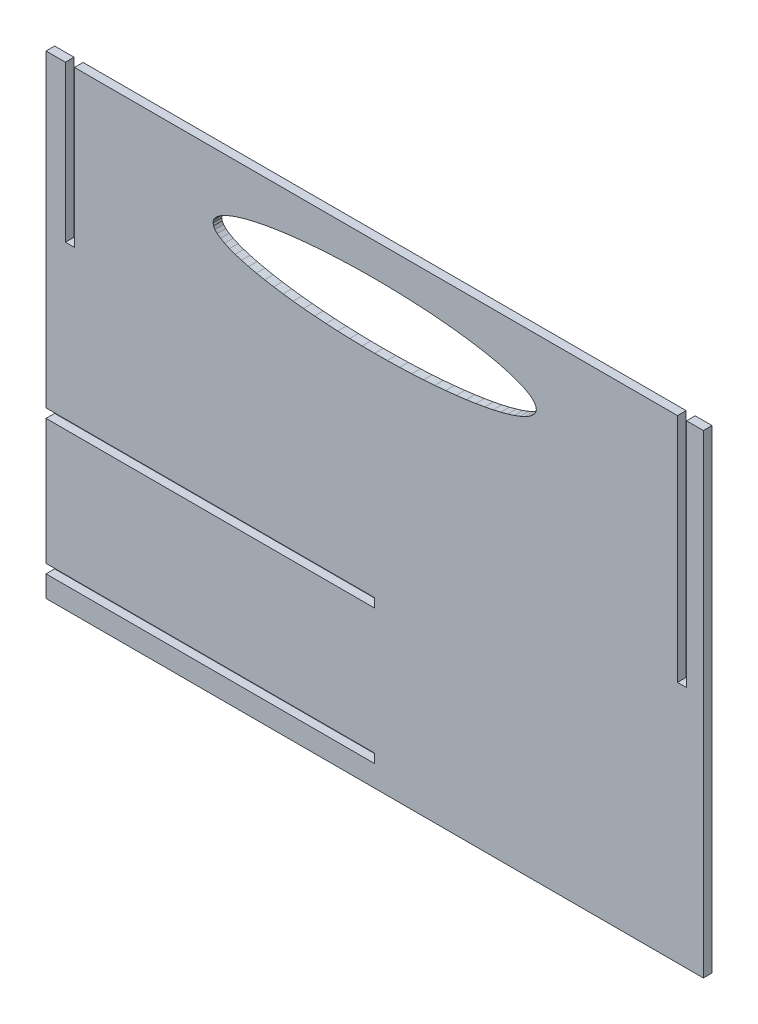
ISO-10303-21;
HEADER;
FILE_DESCRIPTION(('STEP AP214'),'2;1');
FILE_NAME('part.step','',(''),(''),'','','');
FILE_SCHEMA(('AUTOMOTIVE_DESIGN { 1 0 10303 214 1 1 1 1 }'));
ENDSEC;
DATA;
#1=APPLICATION_CONTEXT('core data for automotive mechanical design processes');
#2=APPLICATION_PROTOCOL_DEFINITION('international standard','automotive_design',2000,#1);
#3=PRODUCT_CONTEXT('',#1,'mechanical');
#4=PRODUCT('Part','Part','',(#3));
#5=PRODUCT_RELATED_PRODUCT_CATEGORY('part','',(#4));
#6=PRODUCT_DEFINITION_FORMATION('','',#4);
#7=PRODUCT_DEFINITION_CONTEXT('part definition',#1,'design');
#8=PRODUCT_DEFINITION('design','',#6,#7);
#9=PRODUCT_DEFINITION_SHAPE('','',#8);
#10=(LENGTH_UNIT() NAMED_UNIT(*) SI_UNIT(.MILLI.,.METRE.));
#11=(NAMED_UNIT(*) PLANE_ANGLE_UNIT() SI_UNIT($,.RADIAN.));
#12=(NAMED_UNIT(*) SI_UNIT($,.STERADIAN.) SOLID_ANGLE_UNIT());
#13=UNCERTAINTY_MEASURE_WITH_UNIT(LENGTH_MEASURE(1.E-05),#10,'distance_accuracy_value','');
#14=(GEOMETRIC_REPRESENTATION_CONTEXT(3) GLOBAL_UNCERTAINTY_ASSIGNED_CONTEXT((#13)) GLOBAL_UNIT_ASSIGNED_CONTEXT((#10,
#11,#12)) REPRESENTATION_CONTEXT('',''));
#15=CARTESIAN_POINT('',(0.,0.,0.));
#16=DIRECTION('',(0.,0.,1.));
#17=DIRECTION('',(1.,0.,0.));
#18=AXIS2_PLACEMENT_3D('',#15,#16,#17);
#19=CARTESIAN_POINT('',(0.,0.,4.));
#20=DIRECTION('',(0.,0.,-1.));
#21=DIRECTION('',(-1.,0.,0.));
#22=AXIS2_PLACEMENT_3D('',#19,#20,#21);
#23=PLANE('',#22);
#24=DIRECTION('',(1.,0.,0.));
#25=VECTOR('',#24,1.);
#26=CARTESIAN_POINT('',(-1803.325,-1141.3763,4.));
#27=LINE('',#26,#25);
#28=CARTESIAN_POINT('',(-1955.8066,-1141.3763,4.));
#29=VERTEX_POINT('',#28);
#30=CARTESIAN_POINT('',(-1803.325,-1141.3763,4.));
#31=VERTEX_POINT('',#30);
#32=EDGE_CURVE('E1277',#29,#31,#27,.T.);
#33=ORIENTED_EDGE('',*,*,#32,.T.);
#34=DIRECTION('',(0.,-1.,0.));
#35=VECTOR('',#34,1.);
#36=CARTESIAN_POINT('',(-1803.325,-1141.4763,4.));
#37=LINE('',#36,#35);
#38=CARTESIAN_POINT('',(-1803.325,-1145.5763,4.));
#39=VERTEX_POINT('',#38);
#40=EDGE_CURVE('E1280',#31,#39,#37,.T.);
#41=ORIENTED_EDGE('',*,*,#40,.T.);
#42=DIRECTION('',(-1.,0.,0.));
#43=VECTOR('',#42,1.);
#44=CARTESIAN_POINT('',(-1955.8066,-1145.5763,4.));
#45=LINE('',#44,#43);
#46=CARTESIAN_POINT('',(-1955.8066,-1145.5763,4.));
#47=VERTEX_POINT('',#46);
#48=EDGE_CURVE('E1283',#39,#47,#45,.T.);
#49=ORIENTED_EDGE('',*,*,#48,.T.);
#50=DIRECTION('',(0.,-1.,0.));
#51=VECTOR('',#50,1.);
#52=CARTESIAN_POINT('',(-1955.8066,-1203.8527,4.));
#53=LINE('',#52,#51);
#54=CARTESIAN_POINT('',(-1955.8066,-1203.8527,4.));
#55=VERTEX_POINT('',#54);
#56=EDGE_CURVE('E1285',#47,#55,#53,.T.);
#57=ORIENTED_EDGE('',*,*,#56,.T.);
#58=DIRECTION('',(1.,0.,0.));
#59=VECTOR('',#58,1.);
#60=CARTESIAN_POINT('',(-1803.325,-1203.8527,4.));
#61=LINE('',#60,#59);
#62=CARTESIAN_POINT('',(-1803.325,-1203.8527,4.));
#63=VERTEX_POINT('',#62);
#64=EDGE_CURVE('E1287',#55,#63,#61,.T.);
#65=ORIENTED_EDGE('',*,*,#64,.T.);
#66=DIRECTION('',(0.,-1.,0.));
#67=VECTOR('',#66,1.);
#68=CARTESIAN_POINT('',(-1803.325,-1203.9526,4.));
#69=LINE('',#68,#67);
#70=CARTESIAN_POINT('',(-1803.325,-1208.0527,4.));
#71=VERTEX_POINT('',#70);
#72=EDGE_CURVE('E1289',#63,#71,#69,.T.);
#73=ORIENTED_EDGE('',*,*,#72,.T.);
#74=DIRECTION('',(-1.,0.,0.));
#75=VECTOR('',#74,1.);
#76=CARTESIAN_POINT('',(-1955.8066,-1208.0527,4.));
#77=LINE('',#76,#75);
#78=CARTESIAN_POINT('',(-1955.8066,-1208.0527,4.));
#79=VERTEX_POINT('',#78);
#80=EDGE_CURVE('E1291',#71,#79,#77,.T.);
#81=ORIENTED_EDGE('',*,*,#80,.T.);
#82=DIRECTION('',(0.,-1.,0.));
#83=VECTOR('',#82,1.);
#84=CARTESIAN_POINT('',(-1955.8066,-1217.9527,4.));
#85=LINE('',#84,#83);
#86=CARTESIAN_POINT('',(-1955.8066,-1217.9527,4.));
#87=VERTEX_POINT('',#86);
#88=EDGE_CURVE('E1293',#79,#87,#85,.T.);
#89=ORIENTED_EDGE('',*,*,#88,.T.);
#90=DIRECTION('',(1.,0.,0.));
#91=VECTOR('',#90,1.);
#92=CARTESIAN_POINT('',(-1650.8067,-1217.9527,4.));
#93=LINE('',#92,#91);
#94=CARTESIAN_POINT('',(-1650.8067,-1217.9527,4.));
#95=VERTEX_POINT('',#94);
#96=EDGE_CURVE('E1295',#87,#95,#93,.T.);
#97=ORIENTED_EDGE('',*,*,#96,.T.);
#98=DIRECTION('',(0.,1.,0.));
#99=VECTOR('',#98,1.);
#100=CARTESIAN_POINT('',(-1650.8067,-997.9528,4.));
#101=LINE('',#100,#99);
#102=CARTESIAN_POINT('',(-1650.8067,-997.9528,4.));
#103=VERTEX_POINT('',#102);
#104=EDGE_CURVE('E1297',#95,#103,#101,.T.);
#105=ORIENTED_EDGE('',*,*,#104,.T.);
#106=DIRECTION('',(-1.,0.,0.));
#107=VECTOR('',#106,1.);
#108=CARTESIAN_POINT('',(-1658.6024,-997.9528,4.));
#109=LINE('',#108,#107);
#110=CARTESIAN_POINT('',(-1658.6024,-997.9528,4.));
#111=VERTEX_POINT('',#110);
#112=EDGE_CURVE('E1299',#103,#111,#109,.T.);
#113=ORIENTED_EDGE('',*,*,#112,.T.);
#114=DIRECTION('',(0.,-1.,0.));
#115=VECTOR('',#114,1.);
#116=CARTESIAN_POINT('',(-1658.6024,-1105.1696,4.));
#117=LINE('',#116,#115);
#118=CARTESIAN_POINT('',(-1658.6024,-1105.1696,4.));
#119=VERTEX_POINT('',#118);
#120=EDGE_CURVE('E1301',#111,#119,#117,.T.);
#121=ORIENTED_EDGE('',*,*,#120,.T.);
#122=DIRECTION('',(-1.,0.,0.));
#123=VECTOR('',#122,1.);
#124=CARTESIAN_POINT('',(-1658.7024,-1105.1696,4.));
#125=LINE('',#124,#123);
#126=CARTESIAN_POINT('',(-1662.8024,-1105.1696,4.));
#127=VERTEX_POINT('',#126);
#128=EDGE_CURVE('E1303',#119,#127,#125,.T.);
#129=ORIENTED_EDGE('',*,*,#128,.T.);
#130=DIRECTION('',(0.,1.,0.));
#131=VECTOR('',#130,1.);
#132=CARTESIAN_POINT('',(-1662.8024,-997.9528,4.));
#133=LINE('',#132,#131);
#134=CARTESIAN_POINT('',(-1662.8024,-997.9528,4.));
#135=VERTEX_POINT('',#134);
#136=EDGE_CURVE('E1305',#127,#135,#133,.T.);
#137=ORIENTED_EDGE('',*,*,#136,.T.);
#138=DIRECTION('',(-1.,0.,0.));
#139=VECTOR('',#138,1.);
#140=CARTESIAN_POINT('',(-1942.6022,-997.9528,4.));
#141=LINE('',#140,#139);
#142=CARTESIAN_POINT('',(-1942.6022,-997.9528,4.));
#143=VERTEX_POINT('',#142);
#144=EDGE_CURVE('E1307',#135,#143,#141,.T.);
#145=ORIENTED_EDGE('',*,*,#144,.T.);
#146=DIRECTION('',(0.,-1.,0.));
#147=VECTOR('',#146,1.);
#148=CARTESIAN_POINT('',(-1942.6022,-1070.3008,4.));
#149=LINE('',#148,#147);
#150=CARTESIAN_POINT('',(-1942.6022,-1070.3008,4.));
#151=VERTEX_POINT('',#150);
#152=EDGE_CURVE('E1309',#143,#151,#149,.T.);
#153=ORIENTED_EDGE('',*,*,#152,.T.);
#154=DIRECTION('',(-1.,0.,0.));
#155=VECTOR('',#154,1.);
#156=CARTESIAN_POINT('',(-1942.7023,-1070.3008,4.));
#157=LINE('',#156,#155);
#158=CARTESIAN_POINT('',(-1946.8022,-1070.3008,4.));
#159=VERTEX_POINT('',#158);
#160=EDGE_CURVE('E1311',#151,#159,#157,.T.);
#161=ORIENTED_EDGE('',*,*,#160,.T.);
#162=DIRECTION('',(0.,1.,0.));
#163=VECTOR('',#162,1.);
#164=CARTESIAN_POINT('',(-1946.8022,-997.9528,4.));
#165=LINE('',#164,#163);
#166=CARTESIAN_POINT('',(-1946.8022,-997.9528,4.));
#167=VERTEX_POINT('',#166);
#168=EDGE_CURVE('E1313',#159,#167,#165,.T.);
#169=ORIENTED_EDGE('',*,*,#168,.T.);
#170=DIRECTION('',(-1.,0.,0.));
#171=VECTOR('',#170,1.);
#172=CARTESIAN_POINT('',(-1955.8066,-997.9528,4.));
#173=LINE('',#172,#171);
#174=CARTESIAN_POINT('',(-1955.8066,-997.9528,4.));
#175=VERTEX_POINT('',#174);
#176=EDGE_CURVE('E1315',#167,#175,#173,.T.);
#177=ORIENTED_EDGE('',*,*,#176,.T.);
#178=DIRECTION('',(0.,-1.,0.));
#179=VECTOR('',#178,1.);
#180=CARTESIAN_POINT('',(-1955.8066,-1141.3763,4.));
#181=LINE('',#180,#179);
#182=EDGE_CURVE('E1317',#175,#29,#181,.T.);
#183=ORIENTED_EDGE('',*,*,#182,.T.);
#184=EDGE_LOOP('',(#33,#41,#49,#57,#65,#73,#81,#89,#97,#105,#113,#121,#129,#137,#145,#153,#161,
#169,#177,#183));
#185=FACE_BOUND('',#184,.T.);
#186=DIRECTION('',(0.999729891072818,0.0232410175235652,0.));
#187=VECTOR('',#186,1.);
#188=CARTESIAN_POINT('',(-1797.4504,-1043.1527,4.));
#189=LINE('',#188,#187);
#190=CARTESIAN_POINT('',(-1797.4504,-1043.1527,4.));
#191=VERTEX_POINT('',#190);
#192=CARTESIAN_POINT('',(-1791.7164,-1043.0194,4.));
#193=VERTEX_POINT('',#192);
#194=EDGE_CURVE('E680',#191,#193,#189,.T.);
#195=ORIENTED_EDGE('',*,*,#194,.F.);
#196=DIRECTION('',(0.999970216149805,0.00771795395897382,0.));
#197=VECTOR('',#196,1.);
#198=CARTESIAN_POINT('',(-1803.3067,-1043.1979,4.));
#199=LINE('',#198,#197);
#200=CARTESIAN_POINT('',(-1803.3067,-1043.1979,4.));
#201=VERTEX_POINT('',#200);
#202=EDGE_CURVE('E865',#201,#191,#199,.T.);
#203=ORIENTED_EDGE('',*,*,#202,.F.);
#204=DIRECTION('',(0.999970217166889,-0.0077178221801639,0.));
#205=VECTOR('',#204,1.);
#206=CARTESIAN_POINT('',(-1809.1631,-1043.1527,4.));
#207=LINE('',#206,#205);
#208=CARTESIAN_POINT('',(-1809.1631,-1043.1527,4.));
#209=VERTEX_POINT('',#208);
#210=EDGE_CURVE('E863',#209,#201,#207,.T.);
#211=ORIENTED_EDGE('',*,*,#210,.F.);
#212=DIRECTION('',(0.99972988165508,-0.0232414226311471,0.));
#213=VECTOR('',#212,1.);
#214=CARTESIAN_POINT('',(-1814.897,-1043.0194,4.));
#215=LINE('',#214,#213);
#216=CARTESIAN_POINT('',(-1814.897,-1043.0194,4.));
#217=VERTEX_POINT('',#216);
#218=EDGE_CURVE('E861',#217,#209,#215,.T.);
#219=ORIENTED_EDGE('',*,*,#218,.F.);
#220=DIRECTION('',(0.999241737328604,-0.0389352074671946,0.));
#221=VECTOR('',#220,1.);
#222=CARTESIAN_POINT('',(-1820.4918,-1042.8014,4.));
#223=LINE('',#222,#221);
#224=CARTESIAN_POINT('',(-1820.4918,-1042.8014,4.));
#225=VERTEX_POINT('',#224);
#226=EDGE_CURVE('E859',#225,#217,#223,.T.);
#227=ORIENTED_EDGE('',*,*,#226,.F.);
#228=DIRECTION('',(0.998487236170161,-0.0549839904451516,0.));
#229=VECTOR('',#228,1.);
#230=CARTESIAN_POINT('',(-1825.9306,-1042.5019,4.));
#231=LINE('',#230,#229);
#232=CARTESIAN_POINT('',(-1825.9306,-1042.5019,4.));
#233=VERTEX_POINT('',#232);
#234=EDGE_CURVE('E857',#233,#225,#231,.T.);
#235=ORIENTED_EDGE('',*,*,#234,.F.);
#236=DIRECTION('',(0.997439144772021,-0.0715202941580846,0.));
#237=VECTOR('',#236,1.);
#238=CARTESIAN_POINT('',(-1831.1967,-1042.1243,4.));
#239=LINE('',#238,#237);
#240=CARTESIAN_POINT('',(-1831.1967,-1042.1243,4.));
#241=VERTEX_POINT('',#240);
#242=EDGE_CURVE('E855',#241,#233,#239,.T.);
#243=ORIENTED_EDGE('',*,*,#242,.F.);
#244=DIRECTION('',(0.996054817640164,-0.0887400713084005,0.));
#245=VECTOR('',#244,1.);
#246=CARTESIAN_POINT('',(-1836.2735,-1041.672,4.));
#247=LINE('',#246,#245);
#248=CARTESIAN_POINT('',(-1836.2735,-1041.672,4.));
#249=VERTEX_POINT('',#248);
#250=EDGE_CURVE('E853',#249,#241,#247,.T.);
#251=ORIENTED_EDGE('',*,*,#250,.F.);
#252=DIRECTION('',(0.994269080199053,-0.106906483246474,0.));
#253=VECTOR('',#252,1.);
#254=CARTESIAN_POINT('',(-1841.1441,-1041.1483,4.));
#255=LINE('',#254,#253);
#256=CARTESIAN_POINT('',(-1841.1441,-1041.1483,4.));
#257=VERTEX_POINT('',#256);
#258=EDGE_CURVE('E851',#257,#249,#255,.T.);
#259=ORIENTED_EDGE('',*,*,#258,.F.);
#260=DIRECTION('',(0.991992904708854,-0.126293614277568,0.));
#261=VECTOR('',#260,1.);
#262=CARTESIAN_POINT('',(-1845.7917,-1040.5566,4.));
#263=LINE('',#262,#261);
#264=CARTESIAN_POINT('',(-1845.7917,-1040.5566,4.));
#265=VERTEX_POINT('',#264);
#266=EDGE_CURVE('E849',#265,#257,#263,.T.);
#267=ORIENTED_EDGE('',*,*,#266,.F.);
#268=DIRECTION('',(0.989093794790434,-0.147287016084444,0.));
#269=VECTOR('',#268,1.);
#270=CARTESIAN_POINT('',(-1850.1997,-1039.9002,4.));
#271=LINE('',#270,#269);
#272=CARTESIAN_POINT('',(-1850.1997,-1039.9002,4.));
#273=VERTEX_POINT('',#272);
#274=EDGE_CURVE('E847',#273,#265,#271,.T.);
#275=ORIENTED_EDGE('',*,*,#274,.F.);
#276=DIRECTION('',(0.98538423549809,-0.170346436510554,0.));
#277=VECTOR('',#276,1.);
#278=CARTESIAN_POINT('',(-1854.3513,-1039.1825,4.));
#279=LINE('',#278,#277);
#280=CARTESIAN_POINT('',(-1854.3513,-1039.1825,4.));
#281=VERTEX_POINT('',#280);
#282=EDGE_CURVE('E845',#281,#273,#279,.T.);
#283=ORIENTED_EDGE('',*,*,#282,.F.);
#284=DIRECTION('',(0.980580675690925,-0.196116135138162,0.));
#285=VECTOR('',#284,1.);
#286=CARTESIAN_POINT('',(-1858.2298,-1038.4068,4.));
#287=LINE('',#286,#285);
#288=CARTESIAN_POINT('',(-1858.2298,-1038.4068,4.));
#289=VERTEX_POINT('',#288);
#290=EDGE_CURVE('E843',#289,#281,#287,.T.);
#291=ORIENTED_EDGE('',*,*,#290,.F.);
#292=DIRECTION('',(0.97426108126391,-0.225422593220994,0.));
#293=VECTOR('',#292,1.);
#294=CARTESIAN_POINT('',(-1861.8183,-1037.5765,4.));
#295=LINE('',#294,#293);
#296=CARTESIAN_POINT('',(-1861.8183,-1037.5765,4.));
#297=VERTEX_POINT('',#296);
#298=EDGE_CURVE('E841',#297,#289,#295,.T.);
#299=ORIENTED_EDGE('',*,*,#298,.F.);
#300=DIRECTION('',(0.965762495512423,-0.259427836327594,0.));
#301=VECTOR('',#300,1.);
#302=CARTESIAN_POINT('',(-1865.1002,-1036.6949,4.));
#303=LINE('',#302,#301);
#304=CARTESIAN_POINT('',(-1865.1002,-1036.6949,4.));
#305=VERTEX_POINT('',#304);
#306=EDGE_CURVE('E839',#305,#297,#303,.T.);
#307=ORIENTED_EDGE('',*,*,#306,.F.);
#308=DIRECTION('',(0.954022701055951,-0.299734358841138,0.));
#309=VECTOR('',#308,1.);
#310=CARTESIAN_POINT('',(-1868.0587,-1035.7654,4.));
#311=LINE('',#310,#309);
#312=CARTESIAN_POINT('',(-1868.0587,-1035.7654,4.));
#313=VERTEX_POINT('',#312);
#314=EDGE_CURVE('E837',#313,#305,#311,.T.);
#315=ORIENTED_EDGE('',*,*,#314,.F.);
#316=DIRECTION('',(0.93724388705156,-0.348674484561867,0.));
#317=VECTOR('',#316,1.);
#318=CARTESIAN_POINT('',(-1870.6771,-1034.7913,4.));
#319=LINE('',#318,#317);
#320=CARTESIAN_POINT('',(-1870.6771,-1034.7913,4.));
#321=VERTEX_POINT('',#320);
#322=EDGE_CURVE('E835',#321,#313,#319,.T.);
#323=ORIENTED_EDGE('',*,*,#322,.F.);
#324=DIRECTION('',(0.912264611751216,-0.409601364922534,0.));
#325=VECTOR('',#324,1.);
#326=CARTESIAN_POINT('',(-1872.9386,-1033.7759,4.));
#327=LINE('',#326,#325);
#328=CARTESIAN_POINT('',(-1872.9386,-1033.7759,4.));
#329=VERTEX_POINT('',#328);
#330=EDGE_CURVE('E833',#329,#321,#327,.T.);
#331=ORIENTED_EDGE('',*,*,#330,.F.);
#332=DIRECTION('',(0.873298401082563,-0.487185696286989,0.));
#333=VECTOR('',#332,1.);
#334=CARTESIAN_POINT('',(-1874.8265,-1032.7227,4.));
#335=LINE('',#334,#333);
#336=CARTESIAN_POINT('',(-1874.8265,-1032.7227,4.));
#337=VERTEX_POINT('',#336);
#338=EDGE_CURVE('E831',#337,#329,#335,.T.);
#339=ORIENTED_EDGE('',*,*,#338,.F.);
#340=DIRECTION('',(0.809067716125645,-0.587715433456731,0.));
#341=VECTOR('',#340,1.);
#342=CARTESIAN_POINT('',(-1876.324,-1031.6349,4.));
#343=LINE('',#342,#341);
#344=CARTESIAN_POINT('',(-1876.324,-1031.6349,4.));
#345=VERTEX_POINT('',#344);
#346=EDGE_CURVE('E829',#345,#337,#343,.T.);
#347=ORIENTED_EDGE('',*,*,#346,.F.);
#348=DIRECTION('',(0.697894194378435,-0.716200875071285,0.));
#349=VECTOR('',#348,1.);
#350=CARTESIAN_POINT('',(-1877.4143,-1030.516,4.));
#351=LINE('',#350,#349);
#352=CARTESIAN_POINT('',(-1877.4143,-1030.516,4.));
#353=VERTEX_POINT('',#352);
#354=EDGE_CURVE('E827',#353,#345,#351,.T.);
#355=ORIENTED_EDGE('',*,*,#354,.F.);
#356=DIRECTION('',(0.502482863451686,-0.864587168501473,0.));
#357=VECTOR('',#356,1.);
#358=CARTESIAN_POINT('',(-1878.0808,-1029.3692,4.));
#359=LINE('',#358,#357);
#360=CARTESIAN_POINT('',(-1878.0808,-1029.3692,4.));
#361=VERTEX_POINT('',#360);
#362=EDGE_CURVE('E825',#361,#353,#359,.T.);
#363=ORIENTED_EDGE('',*,*,#362,.F.);
#364=DIRECTION('',(0.189372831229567,-0.981905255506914,0.));
#365=VECTOR('',#364,1.);
#366=CARTESIAN_POINT('',(-1878.3067,-1028.1979,4.));
#367=LINE('',#366,#365);
#368=CARTESIAN_POINT('',(-1878.3067,-1028.1979,4.));
#369=VERTEX_POINT('',#368);
#370=EDGE_CURVE('E823',#369,#361,#367,.T.);
#371=ORIENTED_EDGE('',*,*,#370,.F.);
#372=DIRECTION('',(-0.189372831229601,-0.981905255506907,0.));
#373=VECTOR('',#372,1.);
#374=CARTESIAN_POINT('',(-1878.0808,-1027.0266,4.));
#375=LINE('',#374,#373);
#376=CARTESIAN_POINT('',(-1878.0808,-1027.0266,4.));
#377=VERTEX_POINT('',#376);
#378=EDGE_CURVE('E821',#377,#369,#375,.T.);
#379=ORIENTED_EDGE('',*,*,#378,.F.);
#380=DIRECTION('',(-0.502482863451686,-0.864587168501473,0.));
#381=VECTOR('',#380,1.);
#382=CARTESIAN_POINT('',(-1877.4143,-1025.8798,4.));
#383=LINE('',#382,#381);
#384=CARTESIAN_POINT('',(-1877.4143,-1025.8798,4.));
#385=VERTEX_POINT('',#384);
#386=EDGE_CURVE('E819',#385,#377,#383,.T.);
#387=ORIENTED_EDGE('',*,*,#386,.F.);
#388=DIRECTION('',(-0.697894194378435,-0.716200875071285,0.));
#389=VECTOR('',#388,1.);
#390=CARTESIAN_POINT('',(-1876.324,-1024.7609,4.));
#391=LINE('',#390,#389);
#392=CARTESIAN_POINT('',(-1876.324,-1024.7609,4.));
#393=VERTEX_POINT('',#392);
#394=EDGE_CURVE('E817',#393,#385,#391,.T.);
#395=ORIENTED_EDGE('',*,*,#394,.F.);
#396=DIRECTION('',(-0.809067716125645,-0.587715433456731,0.));
#397=VECTOR('',#396,1.);
#398=CARTESIAN_POINT('',(-1874.8265,-1023.6731,4.));
#399=LINE('',#398,#397);
#400=CARTESIAN_POINT('',(-1874.8265,-1023.6731,4.));
#401=VERTEX_POINT('',#400);
#402=EDGE_CURVE('E815',#401,#393,#399,.T.);
#403=ORIENTED_EDGE('',*,*,#402,.F.);
#404=DIRECTION('',(-0.873298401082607,-0.48718569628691,0.));
#405=VECTOR('',#404,1.);
#406=CARTESIAN_POINT('',(-1872.9386,-1022.6199,4.));
#407=LINE('',#406,#405);
#408=CARTESIAN_POINT('',(-1872.9386,-1022.6199,4.));
#409=VERTEX_POINT('',#408);
#410=EDGE_CURVE('E813',#409,#401,#407,.T.);
#411=ORIENTED_EDGE('',*,*,#410,.F.);
#412=DIRECTION('',(-0.912279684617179,-0.409567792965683,0.));
#413=VECTOR('',#412,1.);
#414=CARTESIAN_POINT('',(-1870.6771,-1021.6046,4.));
#415=LINE('',#414,#413);
#416=CARTESIAN_POINT('',(-1870.6771,-1021.6046,4.));
#417=VERTEX_POINT('',#416);
#418=EDGE_CURVE('E811',#417,#409,#415,.T.);
#419=ORIENTED_EDGE('',*,*,#418,.F.);
#420=DIRECTION('',(-0.937243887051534,-0.348674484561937,0.));
#421=VECTOR('',#420,1.);
#422=CARTESIAN_POINT('',(-1868.0587,-1020.6305,4.));
#423=LINE('',#422,#421);
#424=CARTESIAN_POINT('',(-1868.0587,-1020.6305,4.));
#425=VERTEX_POINT('',#424);
#426=EDGE_CURVE('E809',#425,#417,#423,.T.);
#427=ORIENTED_EDGE('',*,*,#426,.F.);
#428=DIRECTION('',(-0.95401347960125,-0.299763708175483,0.));
#429=VECTOR('',#428,1.);
#430=CARTESIAN_POINT('',(-1865.1002,-1019.7009,4.));
#431=LINE('',#430,#429);
#432=CARTESIAN_POINT('',(-1865.1002,-1019.7009,4.));
#433=VERTEX_POINT('',#432);
#434=EDGE_CURVE('E807',#433,#425,#431,.T.);
#435=ORIENTED_EDGE('',*,*,#434,.F.);
#436=DIRECTION('',(-0.965762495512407,-0.259427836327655,0.));
#437=VECTOR('',#436,1.);
#438=CARTESIAN_POINT('',(-1861.8183,-1018.8193,4.));
#439=LINE('',#438,#437);
#440=CARTESIAN_POINT('',(-1861.8183,-1018.8193,4.));
#441=VERTEX_POINT('',#440);
#442=EDGE_CURVE('E805',#441,#433,#439,.T.);
#443=ORIENTED_EDGE('',*,*,#442,.F.);
#444=DIRECTION('',(-0.97426108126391,-0.225422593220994,0.));
#445=VECTOR('',#444,1.);
#446=CARTESIAN_POINT('',(-1858.2298,-1017.989,4.));
#447=LINE('',#446,#445);
#448=CARTESIAN_POINT('',(-1858.2298,-1017.989,4.));
#449=VERTEX_POINT('',#448);
#450=EDGE_CURVE('E803',#449,#441,#447,.T.);
#451=ORIENTED_EDGE('',*,*,#450,.F.);
#452=DIRECTION('',(-0.980580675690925,-0.196116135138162,0.));
#453=VECTOR('',#452,1.);
#454=CARTESIAN_POINT('',(-1854.3513,-1017.2133,4.));
#455=LINE('',#454,#453);
#456=CARTESIAN_POINT('',(-1854.3513,-1017.2133,4.));
#457=VERTEX_POINT('',#456);
#458=EDGE_CURVE('E801',#457,#449,#455,.T.);
#459=ORIENTED_EDGE('',*,*,#458,.F.);
#460=DIRECTION('',(-0.985384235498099,-0.170346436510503,0.));
#461=VECTOR('',#460,1.);
#462=CARTESIAN_POINT('',(-1850.1997,-1016.4956,4.));
#463=LINE('',#462,#461);
#464=CARTESIAN_POINT('',(-1850.1997,-1016.4956,4.));
#465=VERTEX_POINT('',#464);
#466=EDGE_CURVE('E799',#465,#457,#463,.T.);
#467=ORIENTED_EDGE('',*,*,#466,.F.);
#468=DIRECTION('',(-0.989093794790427,-0.147287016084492,0.));
#469=VECTOR('',#468,1.);
#470=CARTESIAN_POINT('',(-1845.7917,-1015.8392,4.));
#471=LINE('',#470,#469);
#472=CARTESIAN_POINT('',(-1845.7917,-1015.8392,4.));
#473=VERTEX_POINT('',#472);
#474=EDGE_CURVE('E797',#473,#465,#471,.T.);
#475=ORIENTED_EDGE('',*,*,#474,.F.);
#476=DIRECTION('',(-0.991992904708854,-0.126293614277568,0.));
#477=VECTOR('',#476,1.);
#478=CARTESIAN_POINT('',(-1841.1441,-1015.2475,4.));
#479=LINE('',#478,#477);
#480=CARTESIAN_POINT('',(-1841.1441,-1015.2475,4.));
#481=VERTEX_POINT('',#480);
#482=EDGE_CURVE('E795',#481,#473,#479,.T.);
#483=ORIENTED_EDGE('',*,*,#482,.F.);
#484=DIRECTION('',(-0.994269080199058,-0.106906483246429,0.));
#485=VECTOR('',#484,1.);
#486=CARTESIAN_POINT('',(-1836.2735,-1014.7238,4.));
#487=LINE('',#486,#485);
#488=CARTESIAN_POINT('',(-1836.2735,-1014.7238,4.));
#489=VERTEX_POINT('',#488);
#490=EDGE_CURVE('E793',#489,#481,#487,.T.);
#491=ORIENTED_EDGE('',*,*,#490,.F.);
#492=DIRECTION('',(-0.99605481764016,-0.0887400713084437,0.));
#493=VECTOR('',#492,1.);
#494=CARTESIAN_POINT('',(-1831.1967,-1014.2715,4.));
#495=LINE('',#494,#493);
#496=CARTESIAN_POINT('',(-1831.1967,-1014.2715,4.));
#497=VERTEX_POINT('',#496);
#498=EDGE_CURVE('E791',#497,#489,#495,.T.);
#499=ORIENTED_EDGE('',*,*,#498,.F.);
#500=DIRECTION('',(-0.997440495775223,-0.0715014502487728,0.));
#501=VECTOR('',#500,1.);
#502=CARTESIAN_POINT('',(-1825.9306,-1013.894,4.));
#503=LINE('',#502,#501);
#504=CARTESIAN_POINT('',(-1825.9306,-1013.894,4.));
#505=VERTEX_POINT('',#504);
#506=EDGE_CURVE('E789',#505,#497,#503,.T.);
#507=ORIENTED_EDGE('',*,*,#506,.F.);
#508=DIRECTION('',(-0.998487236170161,-0.0549839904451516,0.));
#509=VECTOR('',#508,1.);
#510=CARTESIAN_POINT('',(-1820.4918,-1013.5945,4.));
#511=LINE('',#510,#509);
#512=CARTESIAN_POINT('',(-1820.4918,-1013.5945,4.));
#513=VERTEX_POINT('',#512);
#514=EDGE_CURVE('E787',#513,#505,#511,.T.);
#515=ORIENTED_EDGE('',*,*,#514,.F.);
#516=DIRECTION('',(-0.999241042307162,-0.0389530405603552,0.));
#517=VECTOR('',#516,1.);
#518=CARTESIAN_POINT('',(-1814.897,-1013.3764,4.));
#519=LINE('',#518,#517);
#520=CARTESIAN_POINT('',(-1814.897,-1013.3764,4.));
#521=VERTEX_POINT('',#520);
#522=EDGE_CURVE('E785',#521,#513,#519,.T.);
#523=ORIENTED_EDGE('',*,*,#522,.F.);
#524=DIRECTION('',(-0.99972988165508,-0.0232414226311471,0.));
#525=VECTOR('',#524,1.);
#526=CARTESIAN_POINT('',(-1809.1631,-1013.2431,4.));
#527=LINE('',#526,#525);
#528=CARTESIAN_POINT('',(-1809.1631,-1013.2431,4.));
#529=VERTEX_POINT('',#528);
#530=EDGE_CURVE('E783',#529,#521,#527,.T.);
#531=ORIENTED_EDGE('',*,*,#530,.F.);
#532=DIRECTION('',(-0.999970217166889,-0.0077178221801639,0.));
#533=VECTOR('',#532,1.);
#534=CARTESIAN_POINT('',(-1803.3067,-1013.1979,4.));
#535=LINE('',#534,#533);
#536=CARTESIAN_POINT('',(-1803.3067,-1013.1979,4.));
#537=VERTEX_POINT('',#536);
#538=EDGE_CURVE('E781',#537,#529,#535,.T.);
#539=ORIENTED_EDGE('',*,*,#538,.F.);
#540=DIRECTION('',(-0.999970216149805,0.00771795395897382,0.));
#541=VECTOR('',#540,1.);
#542=CARTESIAN_POINT('',(-1797.4504,-1013.2431,4.));
#543=LINE('',#542,#541);
#544=CARTESIAN_POINT('',(-1797.4504,-1013.2431,4.));
#545=VERTEX_POINT('',#544);
#546=EDGE_CURVE('E779',#545,#537,#543,.T.);
#547=ORIENTED_EDGE('',*,*,#546,.F.);
#548=DIRECTION('',(-0.999729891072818,0.0232410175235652,0.));
#549=VECTOR('',#548,1.);
#550=CARTESIAN_POINT('',(-1791.7164,-1013.3764,4.));
#551=LINE('',#550,#549);
#552=CARTESIAN_POINT('',(-1791.7164,-1013.3764,4.));
#553=VERTEX_POINT('',#552);
#554=EDGE_CURVE('E777',#553,#545,#551,.T.);
#555=ORIENTED_EDGE('',*,*,#554,.F.);
#556=DIRECTION('',(-0.99924101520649,0.0389537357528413,0.));
#557=VECTOR('',#556,1.);
#558=CARTESIAN_POINT('',(-1786.1217,-1013.5945,4.));
#559=LINE('',#558,#557);
#560=CARTESIAN_POINT('',(-1786.1217,-1013.5945,4.));
#561=VERTEX_POINT('',#560);
#562=EDGE_CURVE('E775',#561,#553,#559,.T.);
#563=ORIENTED_EDGE('',*,*,#562,.F.);
#564=DIRECTION('',(-0.998487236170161,0.0549839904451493,0.));
#565=VECTOR('',#564,1.);
#566=CARTESIAN_POINT('',(-1780.6829,-1013.894,4.));
#567=LINE('',#566,#565);
#568=CARTESIAN_POINT('',(-1780.6829,-1013.894,4.));
#569=VERTEX_POINT('',#568);
#570=EDGE_CURVE('E773',#569,#561,#567,.T.);
#571=ORIENTED_EDGE('',*,*,#570,.F.);
#572=DIRECTION('',(-0.997440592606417,0.0715000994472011,0.));
#573=VECTOR('',#572,1.);
#574=CARTESIAN_POINT('',(-1775.4167,-1014.2715,4.));
#575=LINE('',#574,#573);
#576=CARTESIAN_POINT('',(-1775.4167,-1014.2715,4.));
#577=VERTEX_POINT('',#576);
#578=EDGE_CURVE('E771',#577,#569,#575,.T.);
#579=ORIENTED_EDGE('',*,*,#578,.F.);
#580=DIRECTION('',(-0.996054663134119,0.0887418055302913,0.));
#581=VECTOR('',#580,1.);
#582=CARTESIAN_POINT('',(-1770.34,-1014.7238,4.));
#583=LINE('',#582,#581);
#584=CARTESIAN_POINT('',(-1770.34,-1014.7238,4.));
#585=VERTEX_POINT('',#584);
#586=EDGE_CURVE('E769',#585,#577,#583,.T.);
#587=ORIENTED_EDGE('',*,*,#586,.F.);
#588=DIRECTION('',(-0.994269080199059,0.106906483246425,0.));
#589=VECTOR('',#588,1.);
#590=CARTESIAN_POINT('',(-1765.4694,-1015.2475,4.));
#591=LINE('',#590,#589);
#592=CARTESIAN_POINT('',(-1765.4694,-1015.2475,4.));
#593=VERTEX_POINT('',#592);
#594=EDGE_CURVE('E767',#593,#585,#591,.T.);
#595=ORIENTED_EDGE('',*,*,#594,.F.);
#596=DIRECTION('',(-0.991992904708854,0.126293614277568,0.));
#597=VECTOR('',#596,1.);
#598=CARTESIAN_POINT('',(-1760.8218,-1015.8392,4.));
#599=LINE('',#598,#597);
#600=CARTESIAN_POINT('',(-1760.8218,-1015.8392,4.));
#601=VERTEX_POINT('',#600);
#602=EDGE_CURVE('E765',#601,#593,#599,.T.);
#603=ORIENTED_EDGE('',*,*,#602,.F.);
#604=DIRECTION('',(-0.989093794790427,0.147287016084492,0.));
#605=VECTOR('',#604,1.);
#606=CARTESIAN_POINT('',(-1756.4138,-1016.4956,4.));
#607=LINE('',#606,#605);
#608=CARTESIAN_POINT('',(-1756.4138,-1016.4956,4.));
#609=VERTEX_POINT('',#608);
#610=EDGE_CURVE('E763',#609,#601,#607,.T.);
#611=ORIENTED_EDGE('',*,*,#610,.F.);
#612=DIRECTION('',(-0.985384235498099,0.170346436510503,0.));
#613=VECTOR('',#612,1.);
#614=CARTESIAN_POINT('',(-1752.2622,-1017.2133,4.));
#615=LINE('',#614,#613);
#616=CARTESIAN_POINT('',(-1752.2622,-1017.2133,4.));
#617=VERTEX_POINT('',#616);
#618=EDGE_CURVE('E761',#617,#609,#615,.T.);
#619=ORIENTED_EDGE('',*,*,#618,.F.);
#620=DIRECTION('',(-0.98058067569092,0.196116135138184,0.));
#621=VECTOR('',#620,1.);
#622=CARTESIAN_POINT('',(-1748.3837,-1017.989,4.));
#623=LINE('',#622,#621);
#624=CARTESIAN_POINT('',(-1748.3837,-1017.989,4.));
#625=VERTEX_POINT('',#624);
#626=EDGE_CURVE('E759',#625,#617,#623,.T.);
#627=ORIENTED_EDGE('',*,*,#626,.F.);
#628=DIRECTION('',(-0.974261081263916,0.225422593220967,0.));
#629=VECTOR('',#628,1.);
#630=CARTESIAN_POINT('',(-1744.7952,-1018.8193,4.));
#631=LINE('',#630,#629);
#632=CARTESIAN_POINT('',(-1744.7952,-1018.8193,4.));
#633=VERTEX_POINT('',#632);
#634=EDGE_CURVE('E757',#633,#625,#631,.T.);
#635=ORIENTED_EDGE('',*,*,#634,.F.);
#636=DIRECTION('',(-0.965762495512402,0.259427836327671,0.));
#637=VECTOR('',#636,1.);
#638=CARTESIAN_POINT('',(-1741.5133,-1019.7009,4.));
#639=LINE('',#638,#637);
#640=CARTESIAN_POINT('',(-1741.5133,-1019.7009,4.));
#641=VERTEX_POINT('',#640);
#642=EDGE_CURVE('E755',#641,#633,#639,.T.);
#643=ORIENTED_EDGE('',*,*,#642,.F.);
#644=DIRECTION('',(-0.95401347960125,0.299763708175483,0.));
#645=VECTOR('',#644,1.);
#646=CARTESIAN_POINT('',(-1738.5548,-1020.6305,4.));
#647=LINE('',#646,#645);
#648=CARTESIAN_POINT('',(-1738.5548,-1020.6305,4.));
#649=VERTEX_POINT('',#648);
#650=EDGE_CURVE('E753',#649,#641,#647,.T.);
#651=ORIENTED_EDGE('',*,*,#650,.F.);
#652=DIRECTION('',(-0.937239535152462,0.348686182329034,0.));
#653=VECTOR('',#652,1.);
#654=CARTESIAN_POINT('',(-1735.9365,-1021.6046,4.));
#655=LINE('',#654,#653);
#656=CARTESIAN_POINT('',(-1735.9365,-1021.6046,4.));
#657=VERTEX_POINT('',#656);
#658=EDGE_CURVE('E751',#657,#649,#655,.T.);
#659=ORIENTED_EDGE('',*,*,#658,.F.);
#660=DIRECTION('',(-0.912279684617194,0.40956779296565,0.));
#661=VECTOR('',#660,1.);
#662=CARTESIAN_POINT('',(-1733.675,-1022.6199,4.));
#663=LINE('',#662,#661);
#664=CARTESIAN_POINT('',(-1733.675,-1022.6199,4.));
#665=VERTEX_POINT('',#664);
#666=EDGE_CURVE('E749',#665,#657,#663,.T.);
#667=ORIENTED_EDGE('',*,*,#666,.F.);
#668=DIRECTION('',(-0.873278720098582,0.487220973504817,0.));
#669=VECTOR('',#668,1.);
#670=CARTESIAN_POINT('',(-1731.7871,-1023.6732,4.));
#671=LINE('',#670,#669);
#672=CARTESIAN_POINT('',(-1731.7871,-1023.6732,4.));
#673=VERTEX_POINT('',#672);
#674=EDGE_CURVE('E747',#673,#665,#671,.T.);
#675=ORIENTED_EDGE('',*,*,#674,.F.);
#676=DIRECTION('',(-0.80909340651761,0.587680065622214,0.));
#677=VECTOR('',#676,1.);
#678=CARTESIAN_POINT('',(-1730.2896,-1024.7609,4.));
#679=LINE('',#678,#677);
#680=CARTESIAN_POINT('',(-1730.2896,-1024.7609,4.));
#681=VERTEX_POINT('',#680);
#682=EDGE_CURVE('E745',#681,#673,#679,.T.);
#683=ORIENTED_EDGE('',*,*,#682,.F.);
#684=DIRECTION('',(-0.697895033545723,0.716200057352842,0.));
#685=VECTOR('',#684,1.);
#686=CARTESIAN_POINT('',(-1729.1992,-1025.8799,4.));
#687=LINE('',#686,#685);
#688=CARTESIAN_POINT('',(-1729.1992,-1025.8799,4.));
#689=VERTEX_POINT('',#688);
#690=EDGE_CURVE('E743',#689,#681,#687,.T.);
#691=ORIENTED_EDGE('',*,*,#690,.F.);
#692=DIRECTION('',(-0.502482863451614,0.864587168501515,0.));
#693=VECTOR('',#692,1.);
#694=CARTESIAN_POINT('',(-1728.5327,-1027.0267,4.));
#695=LINE('',#694,#693);
#696=CARTESIAN_POINT('',(-1728.5327,-1027.0267,4.));
#697=VERTEX_POINT('',#696);
#698=EDGE_CURVE('E741',#697,#689,#695,.T.);
#699=ORIENTED_EDGE('',*,*,#698,.F.);
#700=DIRECTION('',(-0.189388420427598,0.981902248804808,0.));
#701=VECTOR('',#700,1.);
#702=CARTESIAN_POINT('',(-1728.3068,-1028.1979,4.));
#703=LINE('',#702,#701);
#704=CARTESIAN_POINT('',(-1728.3068,-1028.1979,4.));
#705=VERTEX_POINT('',#704);
#706=EDGE_CURVE('E739',#705,#697,#703,.T.);
#707=ORIENTED_EDGE('',*,*,#706,.F.);
#708=DIRECTION('',(0.189372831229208,0.981905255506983,0.));
#709=VECTOR('',#708,1.);
#710=CARTESIAN_POINT('',(-1728.5327,-1029.3692,4.));
#711=LINE('',#710,#709);
#712=CARTESIAN_POINT('',(-1728.5327,-1029.3692,4.));
#713=VERTEX_POINT('',#712);
#714=EDGE_CURVE('E737',#713,#705,#711,.T.);
#715=ORIENTED_EDGE('',*,*,#714,.F.);
#716=DIRECTION('',(0.502482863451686,0.864587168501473,0.));
#717=VECTOR('',#716,1.);
#718=CARTESIAN_POINT('',(-1729.1992,-1030.516,4.));
#719=LINE('',#718,#717);
#720=CARTESIAN_POINT('',(-1729.1992,-1030.516,4.));
#721=VERTEX_POINT('',#720);
#722=EDGE_CURVE('E735',#721,#713,#719,.T.);
#723=ORIENTED_EDGE('',*,*,#722,.F.);
#724=DIRECTION('',(0.697927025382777,0.716168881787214,0.));
#725=VECTOR('',#724,1.);
#726=CARTESIAN_POINT('',(-1730.2896,-1031.6349,4.));
#727=LINE('',#726,#725);
#728=CARTESIAN_POINT('',(-1730.2896,-1031.6349,4.));
#729=VERTEX_POINT('',#728);
#730=EDGE_CURVE('E733',#729,#721,#727,.T.);
#731=ORIENTED_EDGE('',*,*,#730,.F.);
#732=DIRECTION('',(0.809067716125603,0.587715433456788,0.));
#733=VECTOR('',#732,1.);
#734=CARTESIAN_POINT('',(-1731.7871,-1032.7227,4.));
#735=LINE('',#734,#733);
#736=CARTESIAN_POINT('',(-1731.7871,-1032.7227,4.));
#737=VERTEX_POINT('',#736);
#738=EDGE_CURVE('E731',#737,#729,#735,.T.);
#739=ORIENTED_EDGE('',*,*,#738,.F.);
#740=DIRECTION('',(0.873298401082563,0.487185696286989,0.));
#741=VECTOR('',#740,1.);
#742=CARTESIAN_POINT('',(-1733.675,-1033.7759,4.));
#743=LINE('',#742,#741);
#744=CARTESIAN_POINT('',(-1733.675,-1033.7759,4.));
#745=VERTEX_POINT('',#744);
#746=EDGE_CURVE('E729',#745,#737,#743,.T.);
#747=ORIENTED_EDGE('',*,*,#746,.F.);
#748=DIRECTION('',(0.912264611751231,0.4096013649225,0.));
#749=VECTOR('',#748,1.);
#750=CARTESIAN_POINT('',(-1735.9365,-1034.7913,4.));
#751=LINE('',#750,#749);
#752=CARTESIAN_POINT('',(-1735.9365,-1034.7913,4.));
#753=VERTEX_POINT('',#752);
#754=EDGE_CURVE('E727',#753,#745,#751,.T.);
#755=ORIENTED_EDGE('',*,*,#754,.F.);
#756=DIRECTION('',(0.937239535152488,0.348686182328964,0.));
#757=VECTOR('',#756,1.);
#758=CARTESIAN_POINT('',(-1738.5548,-1035.7654,4.));
#759=LINE('',#758,#757);
#760=CARTESIAN_POINT('',(-1738.5548,-1035.7654,4.));
#761=VERTEX_POINT('',#760);
#762=EDGE_CURVE('E725',#761,#753,#759,.T.);
#763=ORIENTED_EDGE('',*,*,#762,.F.);
#764=DIRECTION('',(0.954022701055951,0.299734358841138,0.));
#765=VECTOR('',#764,1.);
#766=CARTESIAN_POINT('',(-1741.5133,-1036.6949,4.));
#767=LINE('',#766,#765);
#768=CARTESIAN_POINT('',(-1741.5133,-1036.6949,4.));
#769=VERTEX_POINT('',#768);
#770=EDGE_CURVE('E723',#769,#761,#767,.T.);
#771=ORIENTED_EDGE('',*,*,#770,.F.);
#772=DIRECTION('',(0.965762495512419,0.25942783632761,0.));
#773=VECTOR('',#772,1.);
#774=CARTESIAN_POINT('',(-1744.7952,-1037.5765,4.));
#775=LINE('',#774,#773);
#776=CARTESIAN_POINT('',(-1744.7952,-1037.5765,4.));
#777=VERTEX_POINT('',#776);
#778=EDGE_CURVE('E721',#777,#769,#775,.T.);
#779=ORIENTED_EDGE('',*,*,#778,.F.);
#780=DIRECTION('',(0.974261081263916,0.225422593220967,0.));
#781=VECTOR('',#780,1.);
#782=CARTESIAN_POINT('',(-1748.3837,-1038.4068,4.));
#783=LINE('',#782,#781);
#784=CARTESIAN_POINT('',(-1748.3837,-1038.4068,4.));
#785=VERTEX_POINT('',#784);
#786=EDGE_CURVE('E719',#785,#777,#783,.T.);
#787=ORIENTED_EDGE('',*,*,#786,.F.);
#788=DIRECTION('',(0.98058067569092,0.196116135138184,0.));
#789=VECTOR('',#788,1.);
#790=CARTESIAN_POINT('',(-1752.2622,-1039.1825,4.));
#791=LINE('',#790,#789);
#792=CARTESIAN_POINT('',(-1752.2622,-1039.1825,4.));
#793=VERTEX_POINT('',#792);
#794=EDGE_CURVE('E717',#793,#785,#791,.T.);
#795=ORIENTED_EDGE('',*,*,#794,.F.);
#796=DIRECTION('',(0.98538423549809,0.170346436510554,0.));
#797=VECTOR('',#796,1.);
#798=CARTESIAN_POINT('',(-1756.4138,-1039.9002,4.));
#799=LINE('',#798,#797);
#800=CARTESIAN_POINT('',(-1756.4138,-1039.9002,4.));
#801=VERTEX_POINT('',#800);
#802=EDGE_CURVE('E715',#801,#793,#799,.T.);
#803=ORIENTED_EDGE('',*,*,#802,.F.);
#804=DIRECTION('',(0.989093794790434,0.147287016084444,0.));
#805=VECTOR('',#804,1.);
#806=CARTESIAN_POINT('',(-1760.8218,-1040.5566,4.));
#807=LINE('',#806,#805);
#808=CARTESIAN_POINT('',(-1760.8218,-1040.5566,4.));
#809=VERTEX_POINT('',#808);
#810=EDGE_CURVE('E713',#809,#801,#807,.T.);
#811=ORIENTED_EDGE('',*,*,#810,.F.);
#812=DIRECTION('',(0.991992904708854,0.126293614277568,0.));
#813=VECTOR('',#812,1.);
#814=CARTESIAN_POINT('',(-1765.4694,-1041.1483,4.));
#815=LINE('',#814,#813);
#816=CARTESIAN_POINT('',(-1765.4694,-1041.1483,4.));
#817=VERTEX_POINT('',#816);
#818=EDGE_CURVE('E711',#817,#809,#815,.T.);
#819=ORIENTED_EDGE('',*,*,#818,.F.);
#820=DIRECTION('',(0.994269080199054,0.106906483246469,0.));
#821=VECTOR('',#820,1.);
#822=CARTESIAN_POINT('',(-1770.34,-1041.672,4.));
#823=LINE('',#822,#821);
#824=CARTESIAN_POINT('',(-1770.34,-1041.672,4.));
#825=VERTEX_POINT('',#824);
#826=EDGE_CURVE('E709',#825,#817,#823,.T.);
#827=ORIENTED_EDGE('',*,*,#826,.F.);
#828=DIRECTION('',(0.996054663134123,0.0887418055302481,0.));
#829=VECTOR('',#828,1.);
#830=CARTESIAN_POINT('',(-1775.4167,-1042.1243,4.));
#831=LINE('',#830,#829);
#832=CARTESIAN_POINT('',(-1775.4167,-1042.1243,4.));
#833=VERTEX_POINT('',#832);
#834=EDGE_CURVE('E707',#833,#825,#831,.T.);
#835=ORIENTED_EDGE('',*,*,#834,.F.);
#836=DIRECTION('',(0.99743924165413,0.0715189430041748,0.));
#837=VECTOR('',#836,1.);
#838=CARTESIAN_POINT('',(-1780.6829,-1042.5019,4.));
#839=LINE('',#838,#837);
#840=CARTESIAN_POINT('',(-1780.6829,-1042.5019,4.));
#841=VERTEX_POINT('',#840);
#842=EDGE_CURVE('E703',#841,#833,#839,.T.);
#843=ORIENTED_EDGE('',*,*,#842,.F.);
#844=DIRECTION('',(0.998487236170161,0.0549839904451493,0.));
#845=VECTOR('',#844,1.);
#846=CARTESIAN_POINT('',(-1786.1217,-1042.8014,4.));
#847=LINE('',#846,#845);
#848=CARTESIAN_POINT('',(-1786.1217,-1042.8014,4.));
#849=VERTEX_POINT('',#848);
#850=EDGE_CURVE('E701',#849,#841,#847,.T.);
#851=ORIENTED_EDGE('',*,*,#850,.F.);
#852=DIRECTION('',(0.999241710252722,0.0389359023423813,0.));
#853=VECTOR('',#852,1.);
#854=CARTESIAN_POINT('',(-1791.7164,-1043.0194,4.));
#855=LINE('',#854,#853);
#856=EDGE_CURVE('E688',#193,#849,#855,.T.);
#857=ORIENTED_EDGE('',*,*,#856,.F.);
#858=EDGE_LOOP('',(#195,#203,#211,#219,#227,#235,#243,#251,#259,#267,#275,#283,#291,#299,#307,
#315,#323,#331,#339,#347,#355,#363,#371,#379,#387,#395,#403,#411,#419,#427,#435,#443,#451,#459,
#467,#475,#483,#491,#499,#507,#515,#523,#531,#539,#547,#555,#563,#571,#579,#587,#595,#603,#611,
#619,#627,#635,#643,#651,#659,#667,#675,#683,#691,#699,#707,#715,#723,#731,#739,#747,#755,#763,
#771,#779,#787,#795,#803,#811,#819,#827,#835,#843,#851,#857));
#859=FACE_BOUND('',#858,.T.);
#860=ADVANCED_FACE('F39',(#185,#859),#23,.F.);
#861=CARTESIAN_POINT('',(0.,0.,0.));
#862=DIRECTION('',(0.,0.,-1.));
#863=DIRECTION('',(-1.,0.,0.));
#864=AXIS2_PLACEMENT_3D('',#861,#862,#863);
#865=PLANE('',#864);
#866=DIRECTION('',(1.,0.,0.));
#867=VECTOR('',#866,1.);
#868=CARTESIAN_POINT('',(-1803.325,-1141.3763,0.));
#869=LINE('',#868,#867);
#870=CARTESIAN_POINT('',(-1955.8066,-1141.3763,0.));
#871=VERTEX_POINT('',#870);
#872=CARTESIAN_POINT('',(-1803.325,-1141.3763,0.));
#873=VERTEX_POINT('',#872);
#874=EDGE_CURVE('E696',#871,#873,#869,.T.);
#875=ORIENTED_EDGE('',*,*,#874,.F.);
#876=DIRECTION('',(0.,-1.,0.));
#877=VECTOR('',#876,1.);
#878=CARTESIAN_POINT('',(-1955.8066,-1141.3763,0.));
#879=LINE('',#878,#877);
#880=CARTESIAN_POINT('',(-1955.8066,-997.9528,0.));
#881=VERTEX_POINT('',#880);
#882=EDGE_CURVE('E1281',#881,#871,#879,.T.);
#883=ORIENTED_EDGE('',*,*,#882,.F.);
#884=DIRECTION('',(-1.,0.,0.));
#885=VECTOR('',#884,1.);
#886=CARTESIAN_POINT('',(-1955.8066,-997.9528,0.));
#887=LINE('',#886,#885);
#888=CARTESIAN_POINT('',(-1946.8022,-997.9528,0.));
#889=VERTEX_POINT('',#888);
#890=EDGE_CURVE('E1359',#889,#881,#887,.T.);
#891=ORIENTED_EDGE('',*,*,#890,.F.);
#892=DIRECTION('',(0.,1.,0.));
#893=VECTOR('',#892,1.);
#894=CARTESIAN_POINT('',(-1946.8022,-997.9528,0.));
#895=LINE('',#894,#893);
#896=CARTESIAN_POINT('',(-1946.8022,-1070.3008,0.));
#897=VERTEX_POINT('',#896);
#898=EDGE_CURVE('E1357',#897,#889,#895,.T.);
#899=ORIENTED_EDGE('',*,*,#898,.F.);
#900=DIRECTION('',(-1.,0.,0.));
#901=VECTOR('',#900,1.);
#902=CARTESIAN_POINT('',(-1946.8022,-1070.3008,0.));
#903=LINE('',#902,#901);
#904=CARTESIAN_POINT('',(-1942.6022,-1070.3008,0.));
#905=VERTEX_POINT('',#904);
#906=EDGE_CURVE('E1355',#905,#897,#903,.T.);
#907=ORIENTED_EDGE('',*,*,#906,.F.);
#908=DIRECTION('',(0.,-1.,0.));
#909=VECTOR('',#908,1.);
#910=CARTESIAN_POINT('',(-1942.6022,-1070.3008,0.));
#911=LINE('',#910,#909);
#912=CARTESIAN_POINT('',(-1942.6022,-997.9528,0.));
#913=VERTEX_POINT('',#912);
#914=EDGE_CURVE('E1352',#913,#905,#911,.T.);
#915=ORIENTED_EDGE('',*,*,#914,.F.);
#916=DIRECTION('',(-1.,0.,0.));
#917=VECTOR('',#916,1.);
#918=CARTESIAN_POINT('',(-1942.6022,-997.9528,0.));
#919=LINE('',#918,#917);
#920=CARTESIAN_POINT('',(-1662.8024,-997.9528,0.));
#921=VERTEX_POINT('',#920);
#922=EDGE_CURVE('E1350',#921,#913,#919,.T.);
#923=ORIENTED_EDGE('',*,*,#922,.F.);
#924=DIRECTION('',(0.,1.,0.));
#925=VECTOR('',#924,1.);
#926=CARTESIAN_POINT('',(-1662.8024,-997.9528,0.));
#927=LINE('',#926,#925);
#928=CARTESIAN_POINT('',(-1662.8024,-1105.1696,0.));
#929=VERTEX_POINT('',#928);
#930=EDGE_CURVE('E1348',#929,#921,#927,.T.);
#931=ORIENTED_EDGE('',*,*,#930,.F.);
#932=DIRECTION('',(-1.,0.,0.));
#933=VECTOR('',#932,1.);
#934=CARTESIAN_POINT('',(-1662.8024,-1105.1696,0.));
#935=LINE('',#934,#933);
#936=CARTESIAN_POINT('',(-1658.6024,-1105.1696,0.));
#937=VERTEX_POINT('',#936);
#938=EDGE_CURVE('E1346',#937,#929,#935,.T.);
#939=ORIENTED_EDGE('',*,*,#938,.F.);
#940=DIRECTION('',(0.,-1.,0.));
#941=VECTOR('',#940,1.);
#942=CARTESIAN_POINT('',(-1658.6024,-1105.1696,0.));
#943=LINE('',#942,#941);
#944=CARTESIAN_POINT('',(-1658.6024,-997.9528,0.));
#945=VERTEX_POINT('',#944);
#946=EDGE_CURVE('E1343',#945,#937,#943,.T.);
#947=ORIENTED_EDGE('',*,*,#946,.F.);
#948=DIRECTION('',(-1.,0.,0.));
#949=VECTOR('',#948,1.);
#950=CARTESIAN_POINT('',(-1658.6024,-997.9528,0.));
#951=LINE('',#950,#949);
#952=CARTESIAN_POINT('',(-1650.8067,-997.9528,0.));
#953=VERTEX_POINT('',#952);
#954=EDGE_CURVE('E1341',#953,#945,#951,.T.);
#955=ORIENTED_EDGE('',*,*,#954,.F.);
#956=DIRECTION('',(0.,1.,0.));
#957=VECTOR('',#956,1.);
#958=CARTESIAN_POINT('',(-1650.8067,-997.9528,0.));
#959=LINE('',#958,#957);
#960=CARTESIAN_POINT('',(-1650.8067,-1217.9527,0.));
#961=VERTEX_POINT('',#960);
#962=EDGE_CURVE('E1339',#961,#953,#959,.T.);
#963=ORIENTED_EDGE('',*,*,#962,.F.);
#964=DIRECTION('',(1.,0.,0.));
#965=VECTOR('',#964,1.);
#966=CARTESIAN_POINT('',(-1650.8067,-1217.9527,0.));
#967=LINE('',#966,#965);
#968=CARTESIAN_POINT('',(-1955.8066,-1217.9527,0.));
#969=VERTEX_POINT('',#968);
#970=EDGE_CURVE('E1337',#969,#961,#967,.T.);
#971=ORIENTED_EDGE('',*,*,#970,.F.);
#972=DIRECTION('',(0.,-1.,0.));
#973=VECTOR('',#972,1.);
#974=CARTESIAN_POINT('',(-1955.8066,-1217.9527,0.));
#975=LINE('',#974,#973);
#976=CARTESIAN_POINT('',(-1955.8066,-1208.0527,0.));
#977=VERTEX_POINT('',#976);
#978=EDGE_CURVE('E1335',#977,#969,#975,.T.);
#979=ORIENTED_EDGE('',*,*,#978,.F.);
#980=DIRECTION('',(-1.,0.,0.));
#981=VECTOR('',#980,1.);
#982=CARTESIAN_POINT('',(-1955.8066,-1208.0527,0.));
#983=LINE('',#982,#981);
#984=CARTESIAN_POINT('',(-1803.325,-1208.0527,0.));
#985=VERTEX_POINT('',#984);
#986=EDGE_CURVE('E1333',#985,#977,#983,.T.);
#987=ORIENTED_EDGE('',*,*,#986,.F.);
#988=DIRECTION('',(0.,-1.,0.));
#989=VECTOR('',#988,1.);
#990=CARTESIAN_POINT('',(-1803.325,-1208.0527,0.));
#991=LINE('',#990,#989);
#992=CARTESIAN_POINT('',(-1803.325,-1203.8527,0.));
#993=VERTEX_POINT('',#992);
#994=EDGE_CURVE('E1331',#993,#985,#991,.T.);
#995=ORIENTED_EDGE('',*,*,#994,.F.);
#996=DIRECTION('',(1.,0.,0.));
#997=VECTOR('',#996,1.);
#998=CARTESIAN_POINT('',(-1803.325,-1203.8527,0.));
#999=LINE('',#998,#997);
#1000=CARTESIAN_POINT('',(-1955.8066,-1203.8527,0.));
#1001=VERTEX_POINT('',#1000);
#1002=EDGE_CURVE('E1328',#1001,#993,#999,.T.);
#1003=ORIENTED_EDGE('',*,*,#1002,.F.);
#1004=DIRECTION('',(0.,-1.,0.));
#1005=VECTOR('',#1004,1.);
#1006=CARTESIAN_POINT('',(-1955.8066,-1203.8527,0.));
#1007=LINE('',#1006,#1005);
#1008=CARTESIAN_POINT('',(-1955.8066,-1145.5763,0.));
#1009=VERTEX_POINT('',#1008);
#1010=EDGE_CURVE('E1326',#1009,#1001,#1007,.T.);
#1011=ORIENTED_EDGE('',*,*,#1010,.F.);
#1012=DIRECTION('',(-1.,0.,0.));
#1013=VECTOR('',#1012,1.);
#1014=CARTESIAN_POINT('',(-1955.8066,-1145.5763,0.));
#1015=LINE('',#1014,#1013);
#1016=CARTESIAN_POINT('',(-1803.325,-1145.5763,0.));
#1017=VERTEX_POINT('',#1016);
#1018=EDGE_CURVE('E1324',#1017,#1009,#1015,.T.);
#1019=ORIENTED_EDGE('',*,*,#1018,.F.);
#1020=DIRECTION('',(0.,-1.,0.));
#1021=VECTOR('',#1020,1.);
#1022=CARTESIAN_POINT('',(-1803.325,-1145.5763,0.));
#1023=LINE('',#1022,#1021);
#1024=EDGE_CURVE('E1322',#873,#1017,#1023,.T.);
#1025=ORIENTED_EDGE('',*,*,#1024,.F.);
#1026=EDGE_LOOP('',(#875,#883,#891,#899,#907,#915,#923,#931,#939,#947,#955,#963,#971,#979,#987,
#995,#1003,#1011,#1019,#1025));
#1027=FACE_BOUND('',#1026,.T.);
#1028=DIRECTION('',(0.999970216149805,0.00771795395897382,0.));
#1029=VECTOR('',#1028,1.);
#1030=CARTESIAN_POINT('',(-1803.3067,-1043.1979,0.));
#1031=LINE('',#1030,#1029);
#1032=CARTESIAN_POINT('',(-1803.3067,-1043.1979,0.));
#1033=VERTEX_POINT('',#1032);
#1034=CARTESIAN_POINT('',(-1797.4504,-1043.1527,0.));
#1035=VERTEX_POINT('',#1034);
#1036=EDGE_CURVE('E689',#1033,#1035,#1031,.T.);
#1037=ORIENTED_EDGE('',*,*,#1036,.T.);
#1038=DIRECTION('',(0.999729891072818,0.0232410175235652,0.));
#1039=VECTOR('',#1038,1.);
#1040=CARTESIAN_POINT('',(-1797.4504,-1043.1527,0.));
#1041=LINE('',#1040,#1039);
#1042=CARTESIAN_POINT('',(-1791.7164,-1043.0194,0.));
#1043=VERTEX_POINT('',#1042);
#1044=EDGE_CURVE('E62',#1035,#1043,#1041,.T.);
#1045=ORIENTED_EDGE('',*,*,#1044,.T.);
#1046=DIRECTION('',(0.999241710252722,0.0389359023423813,0.));
#1047=VECTOR('',#1046,1.);
#1048=CARTESIAN_POINT('',(-1791.7164,-1043.0194,0.));
#1049=LINE('',#1048,#1047);
#1050=CARTESIAN_POINT('',(-1786.1217,-1042.8014,0.));
#1051=VERTEX_POINT('',#1050);
#1052=EDGE_CURVE('E695',#1043,#1051,#1049,.T.);
#1053=ORIENTED_EDGE('',*,*,#1052,.T.);
#1054=DIRECTION('',(0.998487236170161,0.0549839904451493,0.));
#1055=VECTOR('',#1054,1.);
#1056=CARTESIAN_POINT('',(-1786.1217,-1042.8014,0.));
#1057=LINE('',#1056,#1055);
#1058=CARTESIAN_POINT('',(-1780.6829,-1042.5019,0.));
#1059=VERTEX_POINT('',#1058);
#1060=EDGE_CURVE('E869',#1051,#1059,#1057,.T.);
#1061=ORIENTED_EDGE('',*,*,#1060,.T.);
#1062=DIRECTION('',(0.99743924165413,0.0715189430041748,0.));
#1063=VECTOR('',#1062,1.);
#1064=CARTESIAN_POINT('',(-1780.6829,-1042.5019,0.));
#1065=LINE('',#1064,#1063);
#1066=CARTESIAN_POINT('',(-1775.4167,-1042.1243,0.));
#1067=VERTEX_POINT('',#1066);
#1068=EDGE_CURVE('E872',#1059,#1067,#1065,.T.);
#1069=ORIENTED_EDGE('',*,*,#1068,.T.);
#1070=DIRECTION('',(0.996054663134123,0.0887418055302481,0.));
#1071=VECTOR('',#1070,1.);
#1072=CARTESIAN_POINT('',(-1775.4167,-1042.1243,0.));
#1073=LINE('',#1072,#1071);
#1074=CARTESIAN_POINT('',(-1770.34,-1041.672,0.));
#1075=VERTEX_POINT('',#1074);
#1076=EDGE_CURVE('E875',#1067,#1075,#1073,.T.);
#1077=ORIENTED_EDGE('',*,*,#1076,.T.);
#1078=DIRECTION('',(0.994269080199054,0.106906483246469,0.));
#1079=VECTOR('',#1078,1.);
#1080=CARTESIAN_POINT('',(-1770.34,-1041.672,0.));
#1081=LINE('',#1080,#1079);
#1082=CARTESIAN_POINT('',(-1765.4694,-1041.1483,0.));
#1083=VERTEX_POINT('',#1082);
#1084=EDGE_CURVE('E878',#1075,#1083,#1081,.T.);
#1085=ORIENTED_EDGE('',*,*,#1084,.T.);
#1086=DIRECTION('',(0.991992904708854,0.126293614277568,0.));
#1087=VECTOR('',#1086,1.);
#1088=CARTESIAN_POINT('',(-1765.4694,-1041.1483,0.));
#1089=LINE('',#1088,#1087);
#1090=CARTESIAN_POINT('',(-1760.8218,-1040.5566,0.));
#1091=VERTEX_POINT('',#1090);
#1092=EDGE_CURVE('E881',#1083,#1091,#1089,.T.);
#1093=ORIENTED_EDGE('',*,*,#1092,.T.);
#1094=DIRECTION('',(0.989093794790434,0.147287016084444,0.));
#1095=VECTOR('',#1094,1.);
#1096=CARTESIAN_POINT('',(-1760.8218,-1040.5566,0.));
#1097=LINE('',#1096,#1095);
#1098=CARTESIAN_POINT('',(-1756.4138,-1039.9002,0.));
#1099=VERTEX_POINT('',#1098);
#1100=EDGE_CURVE('E884',#1091,#1099,#1097,.T.);
#1101=ORIENTED_EDGE('',*,*,#1100,.T.);
#1102=DIRECTION('',(0.98538423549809,0.170346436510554,0.));
#1103=VECTOR('',#1102,1.);
#1104=CARTESIAN_POINT('',(-1756.4138,-1039.9002,0.));
#1105=LINE('',#1104,#1103);
#1106=CARTESIAN_POINT('',(-1752.2622,-1039.1825,0.));
#1107=VERTEX_POINT('',#1106);
#1108=EDGE_CURVE('E887',#1099,#1107,#1105,.T.);
#1109=ORIENTED_EDGE('',*,*,#1108,.T.);
#1110=DIRECTION('',(0.98058067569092,0.196116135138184,0.));
#1111=VECTOR('',#1110,1.);
#1112=CARTESIAN_POINT('',(-1752.2622,-1039.1825,0.));
#1113=LINE('',#1112,#1111);
#1114=CARTESIAN_POINT('',(-1748.3837,-1038.4068,0.));
#1115=VERTEX_POINT('',#1114);
#1116=EDGE_CURVE('E890',#1107,#1115,#1113,.T.);
#1117=ORIENTED_EDGE('',*,*,#1116,.T.);
#1118=DIRECTION('',(0.974261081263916,0.225422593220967,0.));
#1119=VECTOR('',#1118,1.);
#1120=CARTESIAN_POINT('',(-1748.3837,-1038.4068,0.));
#1121=LINE('',#1120,#1119);
#1122=CARTESIAN_POINT('',(-1744.7952,-1037.5765,0.));
#1123=VERTEX_POINT('',#1122);
#1124=EDGE_CURVE('E893',#1115,#1123,#1121,.T.);
#1125=ORIENTED_EDGE('',*,*,#1124,.T.);
#1126=DIRECTION('',(0.965762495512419,0.25942783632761,0.));
#1127=VECTOR('',#1126,1.);
#1128=CARTESIAN_POINT('',(-1744.7952,-1037.5765,0.));
#1129=LINE('',#1128,#1127);
#1130=CARTESIAN_POINT('',(-1741.5133,-1036.6949,0.));
#1131=VERTEX_POINT('',#1130);
#1132=EDGE_CURVE('E896',#1123,#1131,#1129,.T.);
#1133=ORIENTED_EDGE('',*,*,#1132,.T.);
#1134=DIRECTION('',(0.954022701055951,0.299734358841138,0.));
#1135=VECTOR('',#1134,1.);
#1136=CARTESIAN_POINT('',(-1741.5133,-1036.6949,0.));
#1137=LINE('',#1136,#1135);
#1138=CARTESIAN_POINT('',(-1738.5548,-1035.7654,0.));
#1139=VERTEX_POINT('',#1138);
#1140=EDGE_CURVE('E899',#1131,#1139,#1137,.T.);
#1141=ORIENTED_EDGE('',*,*,#1140,.T.);
#1142=DIRECTION('',(0.937239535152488,0.348686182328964,0.));
#1143=VECTOR('',#1142,1.);
#1144=CARTESIAN_POINT('',(-1738.5548,-1035.7654,0.));
#1145=LINE('',#1144,#1143);
#1146=CARTESIAN_POINT('',(-1735.9365,-1034.7913,0.));
#1147=VERTEX_POINT('',#1146);
#1148=EDGE_CURVE('E902',#1139,#1147,#1145,.T.);
#1149=ORIENTED_EDGE('',*,*,#1148,.T.);
#1150=DIRECTION('',(0.912264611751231,0.4096013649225,0.));
#1151=VECTOR('',#1150,1.);
#1152=CARTESIAN_POINT('',(-1735.9365,-1034.7913,0.));
#1153=LINE('',#1152,#1151);
#1154=CARTESIAN_POINT('',(-1733.675,-1033.7759,0.));
#1155=VERTEX_POINT('',#1154);
#1156=EDGE_CURVE('E905',#1147,#1155,#1153,.T.);
#1157=ORIENTED_EDGE('',*,*,#1156,.T.);
#1158=DIRECTION('',(0.873298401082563,0.487185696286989,0.));
#1159=VECTOR('',#1158,1.);
#1160=CARTESIAN_POINT('',(-1733.675,-1033.7759,0.));
#1161=LINE('',#1160,#1159);
#1162=CARTESIAN_POINT('',(-1731.7871,-1032.7227,0.));
#1163=VERTEX_POINT('',#1162);
#1164=EDGE_CURVE('E908',#1155,#1163,#1161,.T.);
#1165=ORIENTED_EDGE('',*,*,#1164,.T.);
#1166=DIRECTION('',(0.809067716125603,0.587715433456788,0.));
#1167=VECTOR('',#1166,1.);
#1168=CARTESIAN_POINT('',(-1731.7871,-1032.7227,0.));
#1169=LINE('',#1168,#1167);
#1170=CARTESIAN_POINT('',(-1730.2896,-1031.6349,0.));
#1171=VERTEX_POINT('',#1170);
#1172=EDGE_CURVE('E911',#1163,#1171,#1169,.T.);
#1173=ORIENTED_EDGE('',*,*,#1172,.T.);
#1174=DIRECTION('',(0.697927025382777,0.716168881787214,0.));
#1175=VECTOR('',#1174,1.);
#1176=CARTESIAN_POINT('',(-1730.2896,-1031.6349,0.));
#1177=LINE('',#1176,#1175);
#1178=CARTESIAN_POINT('',(-1729.1992,-1030.516,0.));
#1179=VERTEX_POINT('',#1178);
#1180=EDGE_CURVE('E914',#1171,#1179,#1177,.T.);
#1181=ORIENTED_EDGE('',*,*,#1180,.T.);
#1182=DIRECTION('',(0.502482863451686,0.864587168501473,0.));
#1183=VECTOR('',#1182,1.);
#1184=CARTESIAN_POINT('',(-1729.1992,-1030.516,0.));
#1185=LINE('',#1184,#1183);
#1186=CARTESIAN_POINT('',(-1728.5327,-1029.3692,0.));
#1187=VERTEX_POINT('',#1186);
#1188=EDGE_CURVE('E917',#1179,#1187,#1185,.T.);
#1189=ORIENTED_EDGE('',*,*,#1188,.T.);
#1190=DIRECTION('',(0.189372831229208,0.981905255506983,0.));
#1191=VECTOR('',#1190,1.);
#1192=CARTESIAN_POINT('',(-1728.5327,-1029.3692,0.));
#1193=LINE('',#1192,#1191);
#1194=CARTESIAN_POINT('',(-1728.3068,-1028.1979,0.));
#1195=VERTEX_POINT('',#1194);
#1196=EDGE_CURVE('E920',#1187,#1195,#1193,.T.);
#1197=ORIENTED_EDGE('',*,*,#1196,.T.);
#1198=DIRECTION('',(-0.189388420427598,0.981902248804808,0.));
#1199=VECTOR('',#1198,1.);
#1200=CARTESIAN_POINT('',(-1728.3068,-1028.1979,0.));
#1201=LINE('',#1200,#1199);
#1202=CARTESIAN_POINT('',(-1728.5327,-1027.0267,0.));
#1203=VERTEX_POINT('',#1202);
#1204=EDGE_CURVE('E923',#1195,#1203,#1201,.T.);
#1205=ORIENTED_EDGE('',*,*,#1204,.T.);
#1206=DIRECTION('',(-0.502482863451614,0.864587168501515,0.));
#1207=VECTOR('',#1206,1.);
#1208=CARTESIAN_POINT('',(-1728.5327,-1027.0267,0.));
#1209=LINE('',#1208,#1207);
#1210=CARTESIAN_POINT('',(-1729.1992,-1025.8799,0.));
#1211=VERTEX_POINT('',#1210);
#1212=EDGE_CURVE('E926',#1203,#1211,#1209,.T.);
#1213=ORIENTED_EDGE('',*,*,#1212,.T.);
#1214=DIRECTION('',(-0.697895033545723,0.716200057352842,0.));
#1215=VECTOR('',#1214,1.);
#1216=CARTESIAN_POINT('',(-1729.1992,-1025.8799,0.));
#1217=LINE('',#1216,#1215);
#1218=CARTESIAN_POINT('',(-1730.2896,-1024.7609,0.));
#1219=VERTEX_POINT('',#1218);
#1220=EDGE_CURVE('E929',#1211,#1219,#1217,.T.);
#1221=ORIENTED_EDGE('',*,*,#1220,.T.);
#1222=DIRECTION('',(-0.80909340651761,0.587680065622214,0.));
#1223=VECTOR('',#1222,1.);
#1224=CARTESIAN_POINT('',(-1730.2896,-1024.7609,0.));
#1225=LINE('',#1224,#1223);
#1226=CARTESIAN_POINT('',(-1731.7871,-1023.6732,0.));
#1227=VERTEX_POINT('',#1226);
#1228=EDGE_CURVE('E932',#1219,#1227,#1225,.T.);
#1229=ORIENTED_EDGE('',*,*,#1228,.T.);
#1230=DIRECTION('',(-0.873278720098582,0.487220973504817,0.));
#1231=VECTOR('',#1230,1.);
#1232=CARTESIAN_POINT('',(-1731.7871,-1023.6732,0.));
#1233=LINE('',#1232,#1231);
#1234=CARTESIAN_POINT('',(-1733.675,-1022.6199,0.));
#1235=VERTEX_POINT('',#1234);
#1236=EDGE_CURVE('E935',#1227,#1235,#1233,.T.);
#1237=ORIENTED_EDGE('',*,*,#1236,.T.);
#1238=DIRECTION('',(-0.912279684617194,0.40956779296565,0.));
#1239=VECTOR('',#1238,1.);
#1240=CARTESIAN_POINT('',(-1733.675,-1022.6199,0.));
#1241=LINE('',#1240,#1239);
#1242=CARTESIAN_POINT('',(-1735.9365,-1021.6046,0.));
#1243=VERTEX_POINT('',#1242);
#1244=EDGE_CURVE('E938',#1235,#1243,#1241,.T.);
#1245=ORIENTED_EDGE('',*,*,#1244,.T.);
#1246=DIRECTION('',(-0.937239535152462,0.348686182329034,0.));
#1247=VECTOR('',#1246,1.);
#1248=CARTESIAN_POINT('',(-1735.9365,-1021.6046,0.));
#1249=LINE('',#1248,#1247);
#1250=CARTESIAN_POINT('',(-1738.5548,-1020.6305,0.));
#1251=VERTEX_POINT('',#1250);
#1252=EDGE_CURVE('E941',#1243,#1251,#1249,.T.);
#1253=ORIENTED_EDGE('',*,*,#1252,.T.);
#1254=DIRECTION('',(-0.95401347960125,0.299763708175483,0.));
#1255=VECTOR('',#1254,1.);
#1256=CARTESIAN_POINT('',(-1738.5548,-1020.6305,0.));
#1257=LINE('',#1256,#1255);
#1258=CARTESIAN_POINT('',(-1741.5133,-1019.7009,0.));
#1259=VERTEX_POINT('',#1258);
#1260=EDGE_CURVE('E944',#1251,#1259,#1257,.T.);
#1261=ORIENTED_EDGE('',*,*,#1260,.T.);
#1262=DIRECTION('',(-0.965762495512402,0.259427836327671,0.));
#1263=VECTOR('',#1262,1.);
#1264=CARTESIAN_POINT('',(-1741.5133,-1019.7009,0.));
#1265=LINE('',#1264,#1263);
#1266=CARTESIAN_POINT('',(-1744.7952,-1018.8193,0.));
#1267=VERTEX_POINT('',#1266);
#1268=EDGE_CURVE('E947',#1259,#1267,#1265,.T.);
#1269=ORIENTED_EDGE('',*,*,#1268,.T.);
#1270=DIRECTION('',(-0.974261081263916,0.225422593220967,0.));
#1271=VECTOR('',#1270,1.);
#1272=CARTESIAN_POINT('',(-1744.7952,-1018.8193,0.));
#1273=LINE('',#1272,#1271);
#1274=CARTESIAN_POINT('',(-1748.3837,-1017.989,0.));
#1275=VERTEX_POINT('',#1274);
#1276=EDGE_CURVE('E950',#1267,#1275,#1273,.T.);
#1277=ORIENTED_EDGE('',*,*,#1276,.T.);
#1278=DIRECTION('',(-0.98058067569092,0.196116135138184,0.));
#1279=VECTOR('',#1278,1.);
#1280=CARTESIAN_POINT('',(-1748.3837,-1017.989,0.));
#1281=LINE('',#1280,#1279);
#1282=CARTESIAN_POINT('',(-1752.2622,-1017.2133,0.));
#1283=VERTEX_POINT('',#1282);
#1284=EDGE_CURVE('E953',#1275,#1283,#1281,.T.);
#1285=ORIENTED_EDGE('',*,*,#1284,.T.);
#1286=DIRECTION('',(-0.985384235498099,0.170346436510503,0.));
#1287=VECTOR('',#1286,1.);
#1288=CARTESIAN_POINT('',(-1752.2622,-1017.2133,0.));
#1289=LINE('',#1288,#1287);
#1290=CARTESIAN_POINT('',(-1756.4138,-1016.4956,0.));
#1291=VERTEX_POINT('',#1290);
#1292=EDGE_CURVE('E956',#1283,#1291,#1289,.T.);
#1293=ORIENTED_EDGE('',*,*,#1292,.T.);
#1294=DIRECTION('',(-0.989093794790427,0.147287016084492,0.));
#1295=VECTOR('',#1294,1.);
#1296=CARTESIAN_POINT('',(-1756.4138,-1016.4956,0.));
#1297=LINE('',#1296,#1295);
#1298=CARTESIAN_POINT('',(-1760.8218,-1015.8392,0.));
#1299=VERTEX_POINT('',#1298);
#1300=EDGE_CURVE('E959',#1291,#1299,#1297,.T.);
#1301=ORIENTED_EDGE('',*,*,#1300,.T.);
#1302=DIRECTION('',(-0.991992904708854,0.126293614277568,0.));
#1303=VECTOR('',#1302,1.);
#1304=CARTESIAN_POINT('',(-1760.8218,-1015.8392,0.));
#1305=LINE('',#1304,#1303);
#1306=CARTESIAN_POINT('',(-1765.4694,-1015.2475,0.));
#1307=VERTEX_POINT('',#1306);
#1308=EDGE_CURVE('E962',#1299,#1307,#1305,.T.);
#1309=ORIENTED_EDGE('',*,*,#1308,.T.);
#1310=DIRECTION('',(-0.994269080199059,0.106906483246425,0.));
#1311=VECTOR('',#1310,1.);
#1312=CARTESIAN_POINT('',(-1765.4694,-1015.2475,0.));
#1313=LINE('',#1312,#1311);
#1314=CARTESIAN_POINT('',(-1770.34,-1014.7238,0.));
#1315=VERTEX_POINT('',#1314);
#1316=EDGE_CURVE('E965',#1307,#1315,#1313,.T.);
#1317=ORIENTED_EDGE('',*,*,#1316,.T.);
#1318=DIRECTION('',(-0.996054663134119,0.0887418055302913,0.));
#1319=VECTOR('',#1318,1.);
#1320=CARTESIAN_POINT('',(-1770.34,-1014.7238,0.));
#1321=LINE('',#1320,#1319);
#1322=CARTESIAN_POINT('',(-1775.4167,-1014.2715,0.));
#1323=VERTEX_POINT('',#1322);
#1324=EDGE_CURVE('E968',#1315,#1323,#1321,.T.);
#1325=ORIENTED_EDGE('',*,*,#1324,.T.);
#1326=DIRECTION('',(-0.997440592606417,0.0715000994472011,0.));
#1327=VECTOR('',#1326,1.);
#1328=CARTESIAN_POINT('',(-1775.4167,-1014.2715,0.));
#1329=LINE('',#1328,#1327);
#1330=CARTESIAN_POINT('',(-1780.6829,-1013.894,0.));
#1331=VERTEX_POINT('',#1330);
#1332=EDGE_CURVE('E971',#1323,#1331,#1329,.T.);
#1333=ORIENTED_EDGE('',*,*,#1332,.T.);
#1334=DIRECTION('',(-0.998487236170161,0.0549839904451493,0.));
#1335=VECTOR('',#1334,1.);
#1336=CARTESIAN_POINT('',(-1780.6829,-1013.894,0.));
#1337=LINE('',#1336,#1335);
#1338=CARTESIAN_POINT('',(-1786.1217,-1013.5945,0.));
#1339=VERTEX_POINT('',#1338);
#1340=EDGE_CURVE('E974',#1331,#1339,#1337,.T.);
#1341=ORIENTED_EDGE('',*,*,#1340,.T.);
#1342=DIRECTION('',(-0.99924101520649,0.0389537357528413,0.));
#1343=VECTOR('',#1342,1.);
#1344=CARTESIAN_POINT('',(-1786.1217,-1013.5945,0.));
#1345=LINE('',#1344,#1343);
#1346=CARTESIAN_POINT('',(-1791.7164,-1013.3764,0.));
#1347=VERTEX_POINT('',#1346);
#1348=EDGE_CURVE('E977',#1339,#1347,#1345,.T.);
#1349=ORIENTED_EDGE('',*,*,#1348,.T.);
#1350=DIRECTION('',(-0.999729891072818,0.0232410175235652,0.));
#1351=VECTOR('',#1350,1.);
#1352=CARTESIAN_POINT('',(-1791.7164,-1013.3764,0.));
#1353=LINE('',#1352,#1351);
#1354=CARTESIAN_POINT('',(-1797.4504,-1013.2431,0.));
#1355=VERTEX_POINT('',#1354);
#1356=EDGE_CURVE('E980',#1347,#1355,#1353,.T.);
#1357=ORIENTED_EDGE('',*,*,#1356,.T.);
#1358=DIRECTION('',(-0.999970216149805,0.00771795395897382,0.));
#1359=VECTOR('',#1358,1.);
#1360=CARTESIAN_POINT('',(-1797.4504,-1013.2431,0.));
#1361=LINE('',#1360,#1359);
#1362=CARTESIAN_POINT('',(-1803.3067,-1013.1979,0.));
#1363=VERTEX_POINT('',#1362);
#1364=EDGE_CURVE('E983',#1355,#1363,#1361,.T.);
#1365=ORIENTED_EDGE('',*,*,#1364,.T.);
#1366=DIRECTION('',(-0.999970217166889,-0.0077178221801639,0.));
#1367=VECTOR('',#1366,1.);
#1368=CARTESIAN_POINT('',(-1803.3067,-1013.1979,0.));
#1369=LINE('',#1368,#1367);
#1370=CARTESIAN_POINT('',(-1809.1631,-1013.2431,0.));
#1371=VERTEX_POINT('',#1370);
#1372=EDGE_CURVE('E986',#1363,#1371,#1369,.T.);
#1373=ORIENTED_EDGE('',*,*,#1372,.T.);
#1374=DIRECTION('',(-0.99972988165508,-0.0232414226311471,0.));
#1375=VECTOR('',#1374,1.);
#1376=CARTESIAN_POINT('',(-1809.1631,-1013.2431,0.));
#1377=LINE('',#1376,#1375);
#1378=CARTESIAN_POINT('',(-1814.897,-1013.3764,0.));
#1379=VERTEX_POINT('',#1378);
#1380=EDGE_CURVE('E989',#1371,#1379,#1377,.T.);
#1381=ORIENTED_EDGE('',*,*,#1380,.T.);
#1382=DIRECTION('',(-0.999241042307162,-0.0389530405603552,0.));
#1383=VECTOR('',#1382,1.);
#1384=CARTESIAN_POINT('',(-1814.897,-1013.3764,0.));
#1385=LINE('',#1384,#1383);
#1386=CARTESIAN_POINT('',(-1820.4918,-1013.5945,0.));
#1387=VERTEX_POINT('',#1386);
#1388=EDGE_CURVE('E992',#1379,#1387,#1385,.T.);
#1389=ORIENTED_EDGE('',*,*,#1388,.T.);
#1390=DIRECTION('',(-0.998487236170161,-0.0549839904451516,0.));
#1391=VECTOR('',#1390,1.);
#1392=CARTESIAN_POINT('',(-1820.4918,-1013.5945,0.));
#1393=LINE('',#1392,#1391);
#1394=CARTESIAN_POINT('',(-1825.9306,-1013.894,0.));
#1395=VERTEX_POINT('',#1394);
#1396=EDGE_CURVE('E995',#1387,#1395,#1393,.T.);
#1397=ORIENTED_EDGE('',*,*,#1396,.T.);
#1398=DIRECTION('',(-0.997440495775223,-0.0715014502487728,0.));
#1399=VECTOR('',#1398,1.);
#1400=CARTESIAN_POINT('',(-1825.9306,-1013.894,0.));
#1401=LINE('',#1400,#1399);
#1402=CARTESIAN_POINT('',(-1831.1967,-1014.2715,0.));
#1403=VERTEX_POINT('',#1402);
#1404=EDGE_CURVE('E998',#1395,#1403,#1401,.T.);
#1405=ORIENTED_EDGE('',*,*,#1404,.T.);
#1406=DIRECTION('',(-0.99605481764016,-0.0887400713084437,0.));
#1407=VECTOR('',#1406,1.);
#1408=CARTESIAN_POINT('',(-1831.1967,-1014.2715,0.));
#1409=LINE('',#1408,#1407);
#1410=CARTESIAN_POINT('',(-1836.2735,-1014.7238,0.));
#1411=VERTEX_POINT('',#1410);
#1412=EDGE_CURVE('E1001',#1403,#1411,#1409,.T.);
#1413=ORIENTED_EDGE('',*,*,#1412,.T.);
#1414=DIRECTION('',(-0.994269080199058,-0.106906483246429,0.));
#1415=VECTOR('',#1414,1.);
#1416=CARTESIAN_POINT('',(-1836.2735,-1014.7238,0.));
#1417=LINE('',#1416,#1415);
#1418=CARTESIAN_POINT('',(-1841.1441,-1015.2475,0.));
#1419=VERTEX_POINT('',#1418);
#1420=EDGE_CURVE('E1004',#1411,#1419,#1417,.T.);
#1421=ORIENTED_EDGE('',*,*,#1420,.T.);
#1422=DIRECTION('',(-0.991992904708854,-0.126293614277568,0.));
#1423=VECTOR('',#1422,1.);
#1424=CARTESIAN_POINT('',(-1841.1441,-1015.2475,0.));
#1425=LINE('',#1424,#1423);
#1426=CARTESIAN_POINT('',(-1845.7917,-1015.8392,0.));
#1427=VERTEX_POINT('',#1426);
#1428=EDGE_CURVE('E1007',#1419,#1427,#1425,.T.);
#1429=ORIENTED_EDGE('',*,*,#1428,.T.);
#1430=DIRECTION('',(-0.989093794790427,-0.147287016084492,0.));
#1431=VECTOR('',#1430,1.);
#1432=CARTESIAN_POINT('',(-1845.7917,-1015.8392,0.));
#1433=LINE('',#1432,#1431);
#1434=CARTESIAN_POINT('',(-1850.1997,-1016.4956,0.));
#1435=VERTEX_POINT('',#1434);
#1436=EDGE_CURVE('E1010',#1427,#1435,#1433,.T.);
#1437=ORIENTED_EDGE('',*,*,#1436,.T.);
#1438=DIRECTION('',(-0.985384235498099,-0.170346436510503,0.));
#1439=VECTOR('',#1438,1.);
#1440=CARTESIAN_POINT('',(-1850.1997,-1016.4956,0.));
#1441=LINE('',#1440,#1439);
#1442=CARTESIAN_POINT('',(-1854.3513,-1017.2133,0.));
#1443=VERTEX_POINT('',#1442);
#1444=EDGE_CURVE('E1013',#1435,#1443,#1441,.T.);
#1445=ORIENTED_EDGE('',*,*,#1444,.T.);
#1446=DIRECTION('',(-0.980580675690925,-0.196116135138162,0.));
#1447=VECTOR('',#1446,1.);
#1448=CARTESIAN_POINT('',(-1854.3513,-1017.2133,0.));
#1449=LINE('',#1448,#1447);
#1450=CARTESIAN_POINT('',(-1858.2298,-1017.989,0.));
#1451=VERTEX_POINT('',#1450);
#1452=EDGE_CURVE('E1016',#1443,#1451,#1449,.T.);
#1453=ORIENTED_EDGE('',*,*,#1452,.T.);
#1454=DIRECTION('',(-0.97426108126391,-0.225422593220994,0.));
#1455=VECTOR('',#1454,1.);
#1456=CARTESIAN_POINT('',(-1858.2298,-1017.989,0.));
#1457=LINE('',#1456,#1455);
#1458=CARTESIAN_POINT('',(-1861.8183,-1018.8193,0.));
#1459=VERTEX_POINT('',#1458);
#1460=EDGE_CURVE('E1019',#1451,#1459,#1457,.T.);
#1461=ORIENTED_EDGE('',*,*,#1460,.T.);
#1462=DIRECTION('',(-0.965762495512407,-0.259427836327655,0.));
#1463=VECTOR('',#1462,1.);
#1464=CARTESIAN_POINT('',(-1861.8183,-1018.8193,0.));
#1465=LINE('',#1464,#1463);
#1466=CARTESIAN_POINT('',(-1865.1002,-1019.7009,0.));
#1467=VERTEX_POINT('',#1466);
#1468=EDGE_CURVE('E1022',#1459,#1467,#1465,.T.);
#1469=ORIENTED_EDGE('',*,*,#1468,.T.);
#1470=DIRECTION('',(-0.95401347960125,-0.299763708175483,0.));
#1471=VECTOR('',#1470,1.);
#1472=CARTESIAN_POINT('',(-1865.1002,-1019.7009,0.));
#1473=LINE('',#1472,#1471);
#1474=CARTESIAN_POINT('',(-1868.0587,-1020.6305,0.));
#1475=VERTEX_POINT('',#1474);
#1476=EDGE_CURVE('E1025',#1467,#1475,#1473,.T.);
#1477=ORIENTED_EDGE('',*,*,#1476,.T.);
#1478=DIRECTION('',(-0.937243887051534,-0.348674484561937,0.));
#1479=VECTOR('',#1478,1.);
#1480=CARTESIAN_POINT('',(-1868.0587,-1020.6305,0.));
#1481=LINE('',#1480,#1479);
#1482=CARTESIAN_POINT('',(-1870.6771,-1021.6046,0.));
#1483=VERTEX_POINT('',#1482);
#1484=EDGE_CURVE('E1028',#1475,#1483,#1481,.T.);
#1485=ORIENTED_EDGE('',*,*,#1484,.T.);
#1486=DIRECTION('',(-0.912279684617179,-0.409567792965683,0.));
#1487=VECTOR('',#1486,1.);
#1488=CARTESIAN_POINT('',(-1870.6771,-1021.6046,0.));
#1489=LINE('',#1488,#1487);
#1490=CARTESIAN_POINT('',(-1872.9386,-1022.6199,0.));
#1491=VERTEX_POINT('',#1490);
#1492=EDGE_CURVE('E1031',#1483,#1491,#1489,.T.);
#1493=ORIENTED_EDGE('',*,*,#1492,.T.);
#1494=DIRECTION('',(-0.873298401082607,-0.48718569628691,0.));
#1495=VECTOR('',#1494,1.);
#1496=CARTESIAN_POINT('',(-1872.9386,-1022.6199,0.));
#1497=LINE('',#1496,#1495);
#1498=CARTESIAN_POINT('',(-1874.8265,-1023.6731,0.));
#1499=VERTEX_POINT('',#1498);
#1500=EDGE_CURVE('E1034',#1491,#1499,#1497,.T.);
#1501=ORIENTED_EDGE('',*,*,#1500,.T.);
#1502=DIRECTION('',(-0.809067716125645,-0.587715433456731,0.));
#1503=VECTOR('',#1502,1.);
#1504=CARTESIAN_POINT('',(-1874.8265,-1023.6731,0.));
#1505=LINE('',#1504,#1503);
#1506=CARTESIAN_POINT('',(-1876.324,-1024.7609,0.));
#1507=VERTEX_POINT('',#1506);
#1508=EDGE_CURVE('E1037',#1499,#1507,#1505,.T.);
#1509=ORIENTED_EDGE('',*,*,#1508,.T.);
#1510=DIRECTION('',(-0.697894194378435,-0.716200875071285,0.));
#1511=VECTOR('',#1510,1.);
#1512=CARTESIAN_POINT('',(-1876.324,-1024.7609,0.));
#1513=LINE('',#1512,#1511);
#1514=CARTESIAN_POINT('',(-1877.4143,-1025.8798,0.));
#1515=VERTEX_POINT('',#1514);
#1516=EDGE_CURVE('E1040',#1507,#1515,#1513,.T.);
#1517=ORIENTED_EDGE('',*,*,#1516,.T.);
#1518=DIRECTION('',(-0.502482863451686,-0.864587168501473,0.));
#1519=VECTOR('',#1518,1.);
#1520=CARTESIAN_POINT('',(-1877.4143,-1025.8798,0.));
#1521=LINE('',#1520,#1519);
#1522=CARTESIAN_POINT('',(-1878.0808,-1027.0266,0.));
#1523=VERTEX_POINT('',#1522);
#1524=EDGE_CURVE('E1043',#1515,#1523,#1521,.T.);
#1525=ORIENTED_EDGE('',*,*,#1524,.T.);
#1526=DIRECTION('',(-0.189372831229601,-0.981905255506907,0.));
#1527=VECTOR('',#1526,1.);
#1528=CARTESIAN_POINT('',(-1878.0808,-1027.0266,0.));
#1529=LINE('',#1528,#1527);
#1530=CARTESIAN_POINT('',(-1878.3067,-1028.1979,0.));
#1531=VERTEX_POINT('',#1530);
#1532=EDGE_CURVE('E1046',#1523,#1531,#1529,.T.);
#1533=ORIENTED_EDGE('',*,*,#1532,.T.);
#1534=DIRECTION('',(0.189372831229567,-0.981905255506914,0.));
#1535=VECTOR('',#1534,1.);
#1536=CARTESIAN_POINT('',(-1878.3067,-1028.1979,0.));
#1537=LINE('',#1536,#1535);
#1538=CARTESIAN_POINT('',(-1878.0808,-1029.3692,0.));
#1539=VERTEX_POINT('',#1538);
#1540=EDGE_CURVE('E1049',#1531,#1539,#1537,.T.);
#1541=ORIENTED_EDGE('',*,*,#1540,.T.);
#1542=DIRECTION('',(0.502482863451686,-0.864587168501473,0.));
#1543=VECTOR('',#1542,1.);
#1544=CARTESIAN_POINT('',(-1878.0808,-1029.3692,0.));
#1545=LINE('',#1544,#1543);
#1546=CARTESIAN_POINT('',(-1877.4143,-1030.516,0.));
#1547=VERTEX_POINT('',#1546);
#1548=EDGE_CURVE('E1052',#1539,#1547,#1545,.T.);
#1549=ORIENTED_EDGE('',*,*,#1548,.T.);
#1550=DIRECTION('',(0.697894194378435,-0.716200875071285,0.));
#1551=VECTOR('',#1550,1.);
#1552=CARTESIAN_POINT('',(-1877.4143,-1030.516,0.));
#1553=LINE('',#1552,#1551);
#1554=CARTESIAN_POINT('',(-1876.324,-1031.6349,0.));
#1555=VERTEX_POINT('',#1554);
#1556=EDGE_CURVE('E1055',#1547,#1555,#1553,.T.);
#1557=ORIENTED_EDGE('',*,*,#1556,.T.);
#1558=DIRECTION('',(0.809067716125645,-0.587715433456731,0.));
#1559=VECTOR('',#1558,1.);
#1560=CARTESIAN_POINT('',(-1876.324,-1031.6349,0.));
#1561=LINE('',#1560,#1559);
#1562=CARTESIAN_POINT('',(-1874.8265,-1032.7227,0.));
#1563=VERTEX_POINT('',#1562);
#1564=EDGE_CURVE('E1058',#1555,#1563,#1561,.T.);
#1565=ORIENTED_EDGE('',*,*,#1564,.T.);
#1566=DIRECTION('',(0.873298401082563,-0.487185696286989,0.));
#1567=VECTOR('',#1566,1.);
#1568=CARTESIAN_POINT('',(-1874.8265,-1032.7227,0.));
#1569=LINE('',#1568,#1567);
#1570=CARTESIAN_POINT('',(-1872.9386,-1033.7759,0.));
#1571=VERTEX_POINT('',#1570);
#1572=EDGE_CURVE('E1061',#1563,#1571,#1569,.T.);
#1573=ORIENTED_EDGE('',*,*,#1572,.T.);
#1574=DIRECTION('',(0.912264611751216,-0.409601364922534,0.));
#1575=VECTOR('',#1574,1.);
#1576=CARTESIAN_POINT('',(-1872.9386,-1033.7759,0.));
#1577=LINE('',#1576,#1575);
#1578=CARTESIAN_POINT('',(-1870.6771,-1034.7913,0.));
#1579=VERTEX_POINT('',#1578);
#1580=EDGE_CURVE('E1064',#1571,#1579,#1577,.T.);
#1581=ORIENTED_EDGE('',*,*,#1580,.T.);
#1582=DIRECTION('',(0.93724388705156,-0.348674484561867,0.));
#1583=VECTOR('',#1582,1.);
#1584=CARTESIAN_POINT('',(-1870.6771,-1034.7913,0.));
#1585=LINE('',#1584,#1583);
#1586=CARTESIAN_POINT('',(-1868.0587,-1035.7654,0.));
#1587=VERTEX_POINT('',#1586);
#1588=EDGE_CURVE('E1067',#1579,#1587,#1585,.T.);
#1589=ORIENTED_EDGE('',*,*,#1588,.T.);
#1590=DIRECTION('',(0.954022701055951,-0.299734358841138,0.));
#1591=VECTOR('',#1590,1.);
#1592=CARTESIAN_POINT('',(-1868.0587,-1035.7654,0.));
#1593=LINE('',#1592,#1591);
#1594=CARTESIAN_POINT('',(-1865.1002,-1036.6949,0.));
#1595=VERTEX_POINT('',#1594);
#1596=EDGE_CURVE('E1070',#1587,#1595,#1593,.T.);
#1597=ORIENTED_EDGE('',*,*,#1596,.T.);
#1598=DIRECTION('',(0.965762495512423,-0.259427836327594,0.));
#1599=VECTOR('',#1598,1.);
#1600=CARTESIAN_POINT('',(-1865.1002,-1036.6949,0.));
#1601=LINE('',#1600,#1599);
#1602=CARTESIAN_POINT('',(-1861.8183,-1037.5765,0.));
#1603=VERTEX_POINT('',#1602);
#1604=EDGE_CURVE('E1073',#1595,#1603,#1601,.T.);
#1605=ORIENTED_EDGE('',*,*,#1604,.T.);
#1606=DIRECTION('',(0.97426108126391,-0.225422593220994,0.));
#1607=VECTOR('',#1606,1.);
#1608=CARTESIAN_POINT('',(-1861.8183,-1037.5765,0.));
#1609=LINE('',#1608,#1607);
#1610=CARTESIAN_POINT('',(-1858.2298,-1038.4068,0.));
#1611=VERTEX_POINT('',#1610);
#1612=EDGE_CURVE('E1076',#1603,#1611,#1609,.T.);
#1613=ORIENTED_EDGE('',*,*,#1612,.T.);
#1614=DIRECTION('',(0.980580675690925,-0.196116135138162,0.));
#1615=VECTOR('',#1614,1.);
#1616=CARTESIAN_POINT('',(-1858.2298,-1038.4068,0.));
#1617=LINE('',#1616,#1615);
#1618=CARTESIAN_POINT('',(-1854.3513,-1039.1825,0.));
#1619=VERTEX_POINT('',#1618);
#1620=EDGE_CURVE('E1079',#1611,#1619,#1617,.T.);
#1621=ORIENTED_EDGE('',*,*,#1620,.T.);
#1622=DIRECTION('',(0.98538423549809,-0.170346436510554,0.));
#1623=VECTOR('',#1622,1.);
#1624=CARTESIAN_POINT('',(-1854.3513,-1039.1825,0.));
#1625=LINE('',#1624,#1623);
#1626=CARTESIAN_POINT('',(-1850.1997,-1039.9002,0.));
#1627=VERTEX_POINT('',#1626);
#1628=EDGE_CURVE('E1082',#1619,#1627,#1625,.T.);
#1629=ORIENTED_EDGE('',*,*,#1628,.T.);
#1630=DIRECTION('',(0.989093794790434,-0.147287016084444,0.));
#1631=VECTOR('',#1630,1.);
#1632=CARTESIAN_POINT('',(-1850.1997,-1039.9002,0.));
#1633=LINE('',#1632,#1631);
#1634=CARTESIAN_POINT('',(-1845.7917,-1040.5566,0.));
#1635=VERTEX_POINT('',#1634);
#1636=EDGE_CURVE('E1085',#1627,#1635,#1633,.T.);
#1637=ORIENTED_EDGE('',*,*,#1636,.T.);
#1638=DIRECTION('',(0.991992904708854,-0.126293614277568,0.));
#1639=VECTOR('',#1638,1.);
#1640=CARTESIAN_POINT('',(-1845.7917,-1040.5566,0.));
#1641=LINE('',#1640,#1639);
#1642=CARTESIAN_POINT('',(-1841.1441,-1041.1483,0.));
#1643=VERTEX_POINT('',#1642);
#1644=EDGE_CURVE('E1088',#1635,#1643,#1641,.T.);
#1645=ORIENTED_EDGE('',*,*,#1644,.T.);
#1646=DIRECTION('',(0.994269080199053,-0.106906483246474,0.));
#1647=VECTOR('',#1646,1.);
#1648=CARTESIAN_POINT('',(-1841.1441,-1041.1483,0.));
#1649=LINE('',#1648,#1647);
#1650=CARTESIAN_POINT('',(-1836.2735,-1041.672,0.));
#1651=VERTEX_POINT('',#1650);
#1652=EDGE_CURVE('E1091',#1643,#1651,#1649,.T.);
#1653=ORIENTED_EDGE('',*,*,#1652,.T.);
#1654=DIRECTION('',(0.996054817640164,-0.0887400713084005,0.));
#1655=VECTOR('',#1654,1.);
#1656=CARTESIAN_POINT('',(-1836.2735,-1041.672,0.));
#1657=LINE('',#1656,#1655);
#1658=CARTESIAN_POINT('',(-1831.1967,-1042.1243,0.));
#1659=VERTEX_POINT('',#1658);
#1660=EDGE_CURVE('E1094',#1651,#1659,#1657,.T.);
#1661=ORIENTED_EDGE('',*,*,#1660,.T.);
#1662=DIRECTION('',(0.997439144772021,-0.0715202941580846,0.));
#1663=VECTOR('',#1662,1.);
#1664=CARTESIAN_POINT('',(-1831.1967,-1042.1243,0.));
#1665=LINE('',#1664,#1663);
#1666=CARTESIAN_POINT('',(-1825.9306,-1042.5019,0.));
#1667=VERTEX_POINT('',#1666);
#1668=EDGE_CURVE('E1097',#1659,#1667,#1665,.T.);
#1669=ORIENTED_EDGE('',*,*,#1668,.T.);
#1670=DIRECTION('',(0.998487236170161,-0.0549839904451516,0.));
#1671=VECTOR('',#1670,1.);
#1672=CARTESIAN_POINT('',(-1825.9306,-1042.5019,0.));
#1673=LINE('',#1672,#1671);
#1674=CARTESIAN_POINT('',(-1820.4918,-1042.8014,0.));
#1675=VERTEX_POINT('',#1674);
#1676=EDGE_CURVE('E1100',#1667,#1675,#1673,.T.);
#1677=ORIENTED_EDGE('',*,*,#1676,.T.);
#1678=DIRECTION('',(0.999241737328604,-0.0389352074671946,0.));
#1679=VECTOR('',#1678,1.);
#1680=CARTESIAN_POINT('',(-1820.4918,-1042.8014,0.));
#1681=LINE('',#1680,#1679);
#1682=CARTESIAN_POINT('',(-1814.897,-1043.0194,0.));
#1683=VERTEX_POINT('',#1682);
#1684=EDGE_CURVE('E1103',#1675,#1683,#1681,.T.);
#1685=ORIENTED_EDGE('',*,*,#1684,.T.);
#1686=DIRECTION('',(0.99972988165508,-0.0232414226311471,0.));
#1687=VECTOR('',#1686,1.);
#1688=CARTESIAN_POINT('',(-1814.897,-1043.0194,0.));
#1689=LINE('',#1688,#1687);
#1690=CARTESIAN_POINT('',(-1809.1631,-1043.1527,0.));
#1691=VERTEX_POINT('',#1690);
#1692=EDGE_CURVE('E1106',#1683,#1691,#1689,.T.);
#1693=ORIENTED_EDGE('',*,*,#1692,.T.);
#1694=DIRECTION('',(0.999970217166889,-0.0077178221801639,0.));
#1695=VECTOR('',#1694,1.);
#1696=CARTESIAN_POINT('',(-1809.1631,-1043.1527,0.));
#1697=LINE('',#1696,#1695);
#1698=EDGE_CURVE('E1109',#1691,#1033,#1697,.T.);
#1699=ORIENTED_EDGE('',*,*,#1698,.T.);
#1700=EDGE_LOOP('',(#1037,#1045,#1053,#1061,#1069,#1077,#1085,#1093,#1101,#1109,#1117,#1125,
#1133,#1141,#1149,#1157,#1165,#1173,#1181,#1189,#1197,#1205,#1213,#1221,#1229,#1237,#1245,#1253,
#1261,#1269,#1277,#1285,#1293,#1301,#1309,#1317,#1325,#1333,#1341,#1349,#1357,#1365,#1373,#1381,
#1389,#1397,#1405,#1413,#1421,#1429,#1437,#1445,#1453,#1461,#1469,#1477,#1485,#1493,#1501,#1509,
#1517,#1525,#1533,#1541,#1549,#1557,#1565,#1573,#1581,#1589,#1597,#1605,#1613,#1621,#1629,#1637,
#1645,#1653,#1661,#1669,#1677,#1685,#1693,#1699));
#1701=FACE_BOUND('',#1700,.T.);
#1702=ADVANCED_FACE('F1425',(#1027,#1701),#865,.T.);
#1703=CARTESIAN_POINT('',(-1803.325,-1141.3763,4.));
#1704=DIRECTION('',(0.,1.,0.));
#1705=DIRECTION('',(0.,0.,1.));
#1706=AXIS2_PLACEMENT_3D('',#1703,#1704,#1705);
#1707=PLANE('',#1706);
#1708=ORIENTED_EDGE('',*,*,#874,.T.);
#1709=DIRECTION('',(0.,0.,-1.));
#1710=VECTOR('',#1709,1.);
#1711=CARTESIAN_POINT('',(-1803.325,-1141.3763,4.));
#1712=LINE('',#1711,#1710);
#1713=EDGE_CURVE('E11',#31,#873,#1712,.T.);
#1714=ORIENTED_EDGE('',*,*,#1713,.F.);
#1715=ORIENTED_EDGE('',*,*,#32,.F.);
#1716=DIRECTION('',(0.,0.,-1.));
#1717=VECTOR('',#1716,1.);
#1718=CARTESIAN_POINT('',(-1955.8066,-1141.3763,4.));
#1719=LINE('',#1718,#1717);
#1720=EDGE_CURVE('E1319',#29,#871,#1719,.T.);
#1721=ORIENTED_EDGE('',*,*,#1720,.T.);
#1722=EDGE_LOOP('',(#1708,#1714,#1715,#1721));
#1723=FACE_BOUND('',#1722,.T.);
#1724=ADVANCED_FACE('F41',(#1723),#1707,.F.);
#1725=CARTESIAN_POINT('',(-1803.325,-1145.5763,4.));
#1726=DIRECTION('',(1.,0.,0.));
#1727=DIRECTION('',(0.,0.,-1.));
#1728=AXIS2_PLACEMENT_3D('',#1725,#1726,#1727);
#1729=PLANE('',#1728);
#1730=ORIENTED_EDGE('',*,*,#1024,.T.);
#1731=DIRECTION('',(0.,0.,-1.));
#1732=VECTOR('',#1731,1.);
#1733=CARTESIAN_POINT('',(-1803.325,-1145.5763,4.));
#1734=LINE('',#1733,#1732);
#1735=EDGE_CURVE('E47',#39,#1017,#1734,.T.);
#1736=ORIENTED_EDGE('',*,*,#1735,.F.);
#1737=ORIENTED_EDGE('',*,*,#40,.F.);
#1738=ORIENTED_EDGE('',*,*,#1713,.T.);
#1739=EDGE_LOOP('',(#1730,#1736,#1737,#1738));
#1740=FACE_BOUND('',#1739,.T.);
#1741=ADVANCED_FACE('F1441',(#1740),#1729,.F.);
#1742=CARTESIAN_POINT('',(-1955.8066,-1145.5763,4.));
#1743=DIRECTION('',(0.,-1.,0.));
#1744=DIRECTION('',(0.,0.,-1.));
#1745=AXIS2_PLACEMENT_3D('',#1742,#1743,#1744);
#1746=PLANE('',#1745);
#1747=ORIENTED_EDGE('',*,*,#1018,.T.);
#1748=DIRECTION('',(0.,0.,-1.));
#1749=VECTOR('',#1748,1.);
#1750=CARTESIAN_POINT('',(-1955.8066,-1145.5763,4.));
#1751=LINE('',#1750,#1749);
#1752=EDGE_CURVE('E1412',#47,#1009,#1751,.T.);
#1753=ORIENTED_EDGE('',*,*,#1752,.F.);
#1754=ORIENTED_EDGE('',*,*,#48,.F.);
#1755=ORIENTED_EDGE('',*,*,#1735,.T.);
#1756=EDGE_LOOP('',(#1747,#1753,#1754,#1755));
#1757=FACE_BOUND('',#1756,.T.);
#1758=ADVANCED_FACE('F1419',(#1757),#1746,.F.);
#1759=CARTESIAN_POINT('',(-1955.8066,-1203.8527,4.));
#1760=DIRECTION('',(1.,0.,0.));
#1761=DIRECTION('',(0.,0.,-1.));
#1762=AXIS2_PLACEMENT_3D('',#1759,#1760,#1761);
#1763=PLANE('',#1762);
#1764=ORIENTED_EDGE('',*,*,#1010,.T.);
#1765=DIRECTION('',(0.,0.,-1.));
#1766=VECTOR('',#1765,1.);
#1767=CARTESIAN_POINT('',(-1955.8066,-1203.8527,4.));
#1768=LINE('',#1767,#1766);
#1769=EDGE_CURVE('E1409',#55,#1001,#1768,.T.);
#1770=ORIENTED_EDGE('',*,*,#1769,.F.);
#1771=ORIENTED_EDGE('',*,*,#56,.F.);
#1772=ORIENTED_EDGE('',*,*,#1752,.T.);
#1773=EDGE_LOOP('',(#1764,#1770,#1771,#1772));
#1774=FACE_BOUND('',#1773,.T.);
#1775=ADVANCED_FACE('F1430',(#1774),#1763,.F.);
#1776=CARTESIAN_POINT('',(-1803.325,-1203.8527,4.));
#1777=DIRECTION('',(0.,1.,0.));
#1778=DIRECTION('',(0.,0.,1.));
#1779=AXIS2_PLACEMENT_3D('',#1776,#1777,#1778);
#1780=PLANE('',#1779);
#1781=ORIENTED_EDGE('',*,*,#1002,.T.);
#1782=DIRECTION('',(0.,0.,-1.));
#1783=VECTOR('',#1782,1.);
#1784=CARTESIAN_POINT('',(-1803.325,-1203.8527,4.));
#1785=LINE('',#1784,#1783);
#1786=EDGE_CURVE('E1406',#63,#993,#1785,.T.);
#1787=ORIENTED_EDGE('',*,*,#1786,.F.);
#1788=ORIENTED_EDGE('',*,*,#64,.F.);
#1789=ORIENTED_EDGE('',*,*,#1769,.T.);
#1790=EDGE_LOOP('',(#1781,#1787,#1788,#1789));
#1791=FACE_BOUND('',#1790,.T.);
#1792=ADVANCED_FACE('F1434',(#1791),#1780,.F.);
#1793=CARTESIAN_POINT('',(-1803.325,-1208.0527,4.));
#1794=DIRECTION('',(1.,0.,0.));
#1795=DIRECTION('',(0.,0.,-1.));
#1796=AXIS2_PLACEMENT_3D('',#1793,#1794,#1795);
#1797=PLANE('',#1796);
#1798=ORIENTED_EDGE('',*,*,#994,.T.);
#1799=DIRECTION('',(0.,0.,-1.));
#1800=VECTOR('',#1799,1.);
#1801=CARTESIAN_POINT('',(-1803.325,-1208.0527,4.));
#1802=LINE('',#1801,#1800);
#1803=EDGE_CURVE('E1403',#71,#985,#1802,.T.);
#1804=ORIENTED_EDGE('',*,*,#1803,.F.);
#1805=ORIENTED_EDGE('',*,*,#72,.F.);
#1806=ORIENTED_EDGE('',*,*,#1786,.T.);
#1807=EDGE_LOOP('',(#1798,#1804,#1805,#1806));
#1808=FACE_BOUND('',#1807,.T.);
#1809=ADVANCED_FACE('F1512',(#1808),#1797,.F.);
#1810=CARTESIAN_POINT('',(-1955.8066,-1208.0527,4.));
#1811=DIRECTION('',(0.,-1.,0.));
#1812=DIRECTION('',(0.,0.,-1.));
#1813=AXIS2_PLACEMENT_3D('',#1810,#1811,#1812);
#1814=PLANE('',#1813);
#1815=ORIENTED_EDGE('',*,*,#986,.T.);
#1816=DIRECTION('',(0.,0.,-1.));
#1817=VECTOR('',#1816,1.);
#1818=CARTESIAN_POINT('',(-1955.8066,-1208.0527,4.));
#1819=LINE('',#1818,#1817);
#1820=EDGE_CURVE('E1400',#79,#977,#1819,.T.);
#1821=ORIENTED_EDGE('',*,*,#1820,.F.);
#1822=ORIENTED_EDGE('',*,*,#80,.F.);
#1823=ORIENTED_EDGE('',*,*,#1803,.T.);
#1824=EDGE_LOOP('',(#1815,#1821,#1822,#1823));
#1825=FACE_BOUND('',#1824,.T.);
#1826=ADVANCED_FACE('F1510',(#1825),#1814,.F.);
#1827=CARTESIAN_POINT('',(-1955.8066,-1217.9527,4.));
#1828=DIRECTION('',(1.,0.,0.));
#1829=DIRECTION('',(0.,0.,-1.));
#1830=AXIS2_PLACEMENT_3D('',#1827,#1828,#1829);
#1831=PLANE('',#1830);
#1832=ORIENTED_EDGE('',*,*,#978,.T.);
#1833=DIRECTION('',(0.,0.,-1.));
#1834=VECTOR('',#1833,1.);
#1835=CARTESIAN_POINT('',(-1955.8066,-1217.9527,4.));
#1836=LINE('',#1835,#1834);
#1837=EDGE_CURVE('E1397',#87,#969,#1836,.T.);
#1838=ORIENTED_EDGE('',*,*,#1837,.F.);
#1839=ORIENTED_EDGE('',*,*,#88,.F.);
#1840=ORIENTED_EDGE('',*,*,#1820,.T.);
#1841=EDGE_LOOP('',(#1832,#1838,#1839,#1840));
#1842=FACE_BOUND('',#1841,.T.);
#1843=ADVANCED_FACE('F1505',(#1842),#1831,.F.);
#1844=CARTESIAN_POINT('',(-1650.8067,-1217.9527,4.));
#1845=DIRECTION('',(0.,1.,0.));
#1846=DIRECTION('',(0.,0.,1.));
#1847=AXIS2_PLACEMENT_3D('',#1844,#1845,#1846);
#1848=PLANE('',#1847);
#1849=ORIENTED_EDGE('',*,*,#970,.T.);
#1850=DIRECTION('',(0.,0.,-1.));
#1851=VECTOR('',#1850,1.);
#1852=CARTESIAN_POINT('',(-1650.8067,-1217.9527,4.));
#1853=LINE('',#1852,#1851);
#1854=EDGE_CURVE('E1394',#95,#961,#1853,.T.);
#1855=ORIENTED_EDGE('',*,*,#1854,.F.);
#1856=ORIENTED_EDGE('',*,*,#96,.F.);
#1857=ORIENTED_EDGE('',*,*,#1837,.T.);
#1858=EDGE_LOOP('',(#1849,#1855,#1856,#1857));
#1859=FACE_BOUND('',#1858,.T.);
#1860=ADVANCED_FACE('F1500',(#1859),#1848,.F.);
#1861=CARTESIAN_POINT('',(-1650.8067,-997.9528,4.));
#1862=DIRECTION('',(-1.,0.,0.));
#1863=DIRECTION('',(0.,0.,1.));
#1864=AXIS2_PLACEMENT_3D('',#1861,#1862,#1863);
#1865=PLANE('',#1864);
#1866=ORIENTED_EDGE('',*,*,#962,.T.);
#1867=DIRECTION('',(0.,0.,-1.));
#1868=VECTOR('',#1867,1.);
#1869=CARTESIAN_POINT('',(-1650.8067,-997.9528,4.));
#1870=LINE('',#1869,#1868);
#1871=EDGE_CURVE('E1391',#103,#953,#1870,.T.);
#1872=ORIENTED_EDGE('',*,*,#1871,.F.);
#1873=ORIENTED_EDGE('',*,*,#104,.F.);
#1874=ORIENTED_EDGE('',*,*,#1854,.T.);
#1875=EDGE_LOOP('',(#1866,#1872,#1873,#1874));
#1876=FACE_BOUND('',#1875,.T.);
#1877=ADVANCED_FACE('F1496',(#1876),#1865,.F.);
#1878=CARTESIAN_POINT('',(-1658.6024,-997.9528,4.));
#1879=DIRECTION('',(0.,-1.,0.));
#1880=DIRECTION('',(0.,0.,-1.));
#1881=AXIS2_PLACEMENT_3D('',#1878,#1879,#1880);
#1882=PLANE('',#1881);
#1883=ORIENTED_EDGE('',*,*,#954,.T.);
#1884=DIRECTION('',(0.,0.,-1.));
#1885=VECTOR('',#1884,1.);
#1886=CARTESIAN_POINT('',(-1658.6024,-997.9528,4.));
#1887=LINE('',#1886,#1885);
#1888=EDGE_CURVE('E1388',#111,#945,#1887,.T.);
#1889=ORIENTED_EDGE('',*,*,#1888,.F.);
#1890=ORIENTED_EDGE('',*,*,#112,.F.);
#1891=ORIENTED_EDGE('',*,*,#1871,.T.);
#1892=EDGE_LOOP('',(#1883,#1889,#1890,#1891));
#1893=FACE_BOUND('',#1892,.T.);
#1894=ADVANCED_FACE('F1491',(#1893),#1882,.F.);
#1895=CARTESIAN_POINT('',(-1658.6024,-1105.1696,4.));
#1896=DIRECTION('',(1.,0.,0.));
#1897=DIRECTION('',(0.,0.,-1.));
#1898=AXIS2_PLACEMENT_3D('',#1895,#1896,#1897);
#1899=PLANE('',#1898);
#1900=ORIENTED_EDGE('',*,*,#946,.T.);
#1901=DIRECTION('',(0.,0.,-1.));
#1902=VECTOR('',#1901,1.);
#1903=CARTESIAN_POINT('',(-1658.6024,-1105.1696,4.));
#1904=LINE('',#1903,#1902);
#1905=EDGE_CURVE('E1385',#119,#937,#1904,.T.);
#1906=ORIENTED_EDGE('',*,*,#1905,.F.);
#1907=ORIENTED_EDGE('',*,*,#120,.F.);
#1908=ORIENTED_EDGE('',*,*,#1888,.T.);
#1909=EDGE_LOOP('',(#1900,#1906,#1907,#1908));
#1910=FACE_BOUND('',#1909,.T.);
#1911=ADVANCED_FACE('F1485',(#1910),#1899,.F.);
#1912=CARTESIAN_POINT('',(-1662.8024,-1105.1696,4.));
#1913=DIRECTION('',(0.,-1.,0.));
#1914=DIRECTION('',(0.,0.,-1.));
#1915=AXIS2_PLACEMENT_3D('',#1912,#1913,#1914);
#1916=PLANE('',#1915);
#1917=ORIENTED_EDGE('',*,*,#938,.T.);
#1918=DIRECTION('',(0.,0.,-1.));
#1919=VECTOR('',#1918,1.);
#1920=CARTESIAN_POINT('',(-1662.8024,-1105.1696,4.));
#1921=LINE('',#1920,#1919);
#1922=EDGE_CURVE('E1382',#127,#929,#1921,.T.);
#1923=ORIENTED_EDGE('',*,*,#1922,.F.);
#1924=ORIENTED_EDGE('',*,*,#128,.F.);
#1925=ORIENTED_EDGE('',*,*,#1905,.T.);
#1926=EDGE_LOOP('',(#1917,#1923,#1924,#1925));
#1927=FACE_BOUND('',#1926,.T.);
#1928=ADVANCED_FACE('F1481',(#1927),#1916,.F.);
#1929=CARTESIAN_POINT('',(-1662.8024,-997.9528,4.));
#1930=DIRECTION('',(-1.,0.,0.));
#1931=DIRECTION('',(0.,0.,1.));
#1932=AXIS2_PLACEMENT_3D('',#1929,#1930,#1931);
#1933=PLANE('',#1932);
#1934=ORIENTED_EDGE('',*,*,#930,.T.);
#1935=DIRECTION('',(0.,0.,-1.));
#1936=VECTOR('',#1935,1.);
#1937=CARTESIAN_POINT('',(-1662.8024,-997.9528,4.));
#1938=LINE('',#1937,#1936);
#1939=EDGE_CURVE('E1379',#135,#921,#1938,.T.);
#1940=ORIENTED_EDGE('',*,*,#1939,.F.);
#1941=ORIENTED_EDGE('',*,*,#136,.F.);
#1942=ORIENTED_EDGE('',*,*,#1922,.T.);
#1943=EDGE_LOOP('',(#1934,#1940,#1941,#1942));
#1944=FACE_BOUND('',#1943,.T.);
#1945=ADVANCED_FACE('F1477',(#1944),#1933,.F.);
#1946=CARTESIAN_POINT('',(-1942.6022,-997.9528,4.));
#1947=DIRECTION('',(0.,-1.,0.));
#1948=DIRECTION('',(0.,0.,-1.));
#1949=AXIS2_PLACEMENT_3D('',#1946,#1947,#1948);
#1950=PLANE('',#1949);
#1951=ORIENTED_EDGE('',*,*,#922,.T.);
#1952=DIRECTION('',(0.,0.,-1.));
#1953=VECTOR('',#1952,1.);
#1954=CARTESIAN_POINT('',(-1942.6022,-997.9528,4.));
#1955=LINE('',#1954,#1953);
#1956=EDGE_CURVE('E1376',#143,#913,#1955,.T.);
#1957=ORIENTED_EDGE('',*,*,#1956,.F.);
#1958=ORIENTED_EDGE('',*,*,#144,.F.);
#1959=ORIENTED_EDGE('',*,*,#1939,.T.);
#1960=EDGE_LOOP('',(#1951,#1957,#1958,#1959));
#1961=FACE_BOUND('',#1960,.T.);
#1962=ADVANCED_FACE('F1473',(#1961),#1950,.F.);
#1963=CARTESIAN_POINT('',(-1942.6022,-1070.3008,4.));
#1964=DIRECTION('',(1.,0.,0.));
#1965=DIRECTION('',(0.,0.,-1.));
#1966=AXIS2_PLACEMENT_3D('',#1963,#1964,#1965);
#1967=PLANE('',#1966);
#1968=ORIENTED_EDGE('',*,*,#914,.T.);
#1969=DIRECTION('',(0.,0.,-1.));
#1970=VECTOR('',#1969,1.);
#1971=CARTESIAN_POINT('',(-1942.6022,-1070.3008,4.));
#1972=LINE('',#1971,#1970);
#1973=EDGE_CURVE('E1373',#151,#905,#1972,.T.);
#1974=ORIENTED_EDGE('',*,*,#1973,.F.);
#1975=ORIENTED_EDGE('',*,*,#152,.F.);
#1976=ORIENTED_EDGE('',*,*,#1956,.T.);
#1977=EDGE_LOOP('',(#1968,#1974,#1975,#1976));
#1978=FACE_BOUND('',#1977,.T.);
#1979=ADVANCED_FACE('F1464',(#1978),#1967,.F.);
#1980=CARTESIAN_POINT('',(-1946.8022,-1070.3008,4.));
#1981=DIRECTION('',(0.,-1.,0.));
#1982=DIRECTION('',(0.,0.,-1.));
#1983=AXIS2_PLACEMENT_3D('',#1980,#1981,#1982);
#1984=PLANE('',#1983);
#1985=ORIENTED_EDGE('',*,*,#906,.T.);
#1986=DIRECTION('',(0.,0.,-1.));
#1987=VECTOR('',#1986,1.);
#1988=CARTESIAN_POINT('',(-1946.8022,-1070.3008,4.));
#1989=LINE('',#1988,#1987);
#1990=EDGE_CURVE('E1370',#159,#897,#1989,.T.);
#1991=ORIENTED_EDGE('',*,*,#1990,.F.);
#1992=ORIENTED_EDGE('',*,*,#160,.F.);
#1993=ORIENTED_EDGE('',*,*,#1973,.T.);
#1994=EDGE_LOOP('',(#1985,#1991,#1992,#1993));
#1995=FACE_BOUND('',#1994,.T.);
#1996=ADVANCED_FACE('F1468',(#1995),#1984,.F.);
#1997=CARTESIAN_POINT('',(-1946.8022,-997.9528,4.));
#1998=DIRECTION('',(-1.,0.,0.));
#1999=DIRECTION('',(0.,0.,1.));
#2000=AXIS2_PLACEMENT_3D('',#1997,#1998,#1999);
#2001=PLANE('',#2000);
#2002=ORIENTED_EDGE('',*,*,#898,.T.);
#2003=DIRECTION('',(0.,0.,-1.));
#2004=VECTOR('',#2003,1.);
#2005=CARTESIAN_POINT('',(-1946.8022,-997.9528,4.));
#2006=LINE('',#2005,#2004);
#2007=EDGE_CURVE('E1367',#167,#889,#2006,.T.);
#2008=ORIENTED_EDGE('',*,*,#2007,.F.);
#2009=ORIENTED_EDGE('',*,*,#168,.F.);
#2010=ORIENTED_EDGE('',*,*,#1990,.T.);
#2011=EDGE_LOOP('',(#2002,#2008,#2009,#2010));
#2012=FACE_BOUND('',#2011,.T.);
#2013=ADVANCED_FACE('F1457',(#2012),#2001,.F.);
#2014=CARTESIAN_POINT('',(-1955.8066,-997.9528,4.));
#2015=DIRECTION('',(0.,-1.,0.));
#2016=DIRECTION('',(0.,0.,-1.));
#2017=AXIS2_PLACEMENT_3D('',#2014,#2015,#2016);
#2018=PLANE('',#2017);
#2019=ORIENTED_EDGE('',*,*,#890,.T.);
#2020=DIRECTION('',(0.,0.,-1.));
#2021=VECTOR('',#2020,1.);
#2022=CARTESIAN_POINT('',(-1955.8066,-997.9528,4.));
#2023=LINE('',#2022,#2021);
#2024=EDGE_CURVE('E1364',#175,#881,#2023,.T.);
#2025=ORIENTED_EDGE('',*,*,#2024,.F.);
#2026=ORIENTED_EDGE('',*,*,#176,.F.);
#2027=ORIENTED_EDGE('',*,*,#2007,.T.);
#2028=EDGE_LOOP('',(#2019,#2025,#2026,#2027));
#2029=FACE_BOUND('',#2028,.T.);
#2030=ADVANCED_FACE('F1453',(#2029),#2018,.F.);
#2031=CARTESIAN_POINT('',(-1955.8066,-1141.3763,4.));
#2032=DIRECTION('',(1.,0.,0.));
#2033=DIRECTION('',(0.,0.,-1.));
#2034=AXIS2_PLACEMENT_3D('',#2031,#2032,#2033);
#2035=PLANE('',#2034);
#2036=ORIENTED_EDGE('',*,*,#882,.T.);
#2037=ORIENTED_EDGE('',*,*,#1720,.F.);
#2038=ORIENTED_EDGE('',*,*,#182,.F.);
#2039=ORIENTED_EDGE('',*,*,#2024,.T.);
#2040=EDGE_LOOP('',(#2036,#2037,#2038,#2039));
#2041=FACE_BOUND('',#2040,.T.);
#2042=ADVANCED_FACE('F1448',(#2041),#2035,.F.);
#2043=CARTESIAN_POINT('',(-1797.4504,-1043.1527,4.));
#2044=DIRECTION('',(-0.0232410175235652,0.999729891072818,0.));
#2045=DIRECTION('',(-0.999729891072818,-0.0232410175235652,0.));
#2046=AXIS2_PLACEMENT_3D('',#2043,#2044,#2045);
#2047=PLANE('',#2046);
#2048=ORIENTED_EDGE('',*,*,#1044,.F.);
#2049=DIRECTION('',(0.,0.,-1.));
#2050=VECTOR('',#2049,1.);
#2051=CARTESIAN_POINT('',(-1797.4504,-1043.1527,4.));
#2052=LINE('',#2051,#2050);
#2053=EDGE_CURVE('E684',#191,#1035,#2052,.T.);
#2054=ORIENTED_EDGE('',*,*,#2053,.F.);
#2055=ORIENTED_EDGE('',*,*,#194,.T.);
#2056=DIRECTION('',(0.,0.,-1.));
#2057=VECTOR('',#2056,1.);
#2058=CARTESIAN_POINT('',(-1791.7164,-1043.0194,4.));
#2059=LINE('',#2058,#2057);
#2060=EDGE_CURVE('E683',#193,#1043,#2059,.T.);
#2061=ORIENTED_EDGE('',*,*,#2060,.T.);
#2062=EDGE_LOOP('',(#2048,#2054,#2055,#2061));
#2063=FACE_BOUND('',#2062,.T.);
#2064=ADVANCED_FACE('F682',(#2063),#2047,.T.);
#2065=CARTESIAN_POINT('',(-1791.7164,-1043.0194,4.));
#2066=DIRECTION('',(-0.0389359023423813,0.999241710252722,0.));
#2067=DIRECTION('',(-0.999241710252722,-0.0389359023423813,0.));
#2068=AXIS2_PLACEMENT_3D('',#2065,#2066,#2067);
#2069=PLANE('',#2068);
#2070=ORIENTED_EDGE('',*,*,#1052,.F.);
#2071=ORIENTED_EDGE('',*,*,#2060,.F.);
#2072=ORIENTED_EDGE('',*,*,#856,.T.);
#2073=DIRECTION('',(0.,0.,-1.));
#2074=VECTOR('',#2073,1.);
#2075=CARTESIAN_POINT('',(-1786.1217,-1042.8014,4.));
#2076=LINE('',#2075,#2074);
#2077=EDGE_CURVE('E697',#849,#1051,#2076,.T.);
#2078=ORIENTED_EDGE('',*,*,#2077,.T.);
#2079=EDGE_LOOP('',(#2070,#2071,#2072,#2078));
#2080=FACE_BOUND('',#2079,.T.);
#2081=ADVANCED_FACE('F692',(#2080),#2069,.T.);
#2082=CARTESIAN_POINT('',(-1786.1217,-1042.8014,4.));
#2083=DIRECTION('',(-0.0549839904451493,0.998487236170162,0.));
#2084=DIRECTION('',(-0.998487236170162,-0.0549839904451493,0.));
#2085=AXIS2_PLACEMENT_3D('',#2082,#2083,#2084);
#2086=PLANE('',#2085);
#2087=ORIENTED_EDGE('',*,*,#1060,.F.);
#2088=ORIENTED_EDGE('',*,*,#2077,.F.);
#2089=ORIENTED_EDGE('',*,*,#850,.T.);
#2090=DIRECTION('',(0.,0.,-1.));
#2091=VECTOR('',#2090,1.);
#2092=CARTESIAN_POINT('',(-1780.6829,-1042.5019,4.));
#2093=LINE('',#2092,#2091);
#2094=EDGE_CURVE('E1274',#841,#1059,#2093,.T.);
#2095=ORIENTED_EDGE('',*,*,#2094,.T.);
#2096=EDGE_LOOP('',(#2087,#2088,#2089,#2095));
#2097=FACE_BOUND('',#2096,.T.);
#2098=ADVANCED_FACE('F1634',(#2097),#2086,.T.);
#2099=CARTESIAN_POINT('',(-1780.6829,-1042.5019,4.));
#2100=DIRECTION('',(-0.0715189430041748,0.99743924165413,0.));
#2101=DIRECTION('',(-0.99743924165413,-0.0715189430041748,0.));
#2102=AXIS2_PLACEMENT_3D('',#2099,#2100,#2101);
#2103=PLANE('',#2102);
#2104=ORIENTED_EDGE('',*,*,#1068,.F.);
#2105=ORIENTED_EDGE('',*,*,#2094,.F.);
#2106=ORIENTED_EDGE('',*,*,#842,.T.);
#2107=DIRECTION('',(0.,0.,-1.));
#2108=VECTOR('',#2107,1.);
#2109=CARTESIAN_POINT('',(-1775.4167,-1042.1243,4.));
#2110=LINE('',#2109,#2108);
#2111=EDGE_CURVE('E1272',#833,#1067,#2110,.T.);
#2112=ORIENTED_EDGE('',*,*,#2111,.T.);
#2113=EDGE_LOOP('',(#2104,#2105,#2106,#2112));
#2114=FACE_BOUND('',#2113,.T.);
#2115=ADVANCED_FACE('F1641',(#2114),#2103,.T.);
#2116=CARTESIAN_POINT('',(-1775.4167,-1042.1243,4.));
#2117=DIRECTION('',(-0.0887418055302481,0.996054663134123,0.));
#2118=DIRECTION('',(-0.996054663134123,-0.0887418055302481,0.));
#2119=AXIS2_PLACEMENT_3D('',#2116,#2117,#2118);
#2120=PLANE('',#2119);
#2121=ORIENTED_EDGE('',*,*,#1076,.F.);
#2122=ORIENTED_EDGE('',*,*,#2111,.F.);
#2123=ORIENTED_EDGE('',*,*,#834,.T.);
#2124=DIRECTION('',(0.,0.,-1.));
#2125=VECTOR('',#2124,1.);
#2126=CARTESIAN_POINT('',(-1770.34,-1041.672,4.));
#2127=LINE('',#2126,#2125);
#2128=EDGE_CURVE('E1270',#825,#1075,#2127,.T.);
#2129=ORIENTED_EDGE('',*,*,#2128,.T.);
#2130=EDGE_LOOP('',(#2121,#2122,#2123,#2129));
#2131=FACE_BOUND('',#2130,.T.);
#2132=ADVANCED_FACE('F1650',(#2131),#2120,.T.);
#2133=CARTESIAN_POINT('',(-1770.34,-1041.672,4.));
#2134=DIRECTION('',(-0.106906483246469,0.994269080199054,0.));
#2135=DIRECTION('',(-0.994269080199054,-0.106906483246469,0.));
#2136=AXIS2_PLACEMENT_3D('',#2133,#2134,#2135);
#2137=PLANE('',#2136);
#2138=ORIENTED_EDGE('',*,*,#1084,.F.);
#2139=ORIENTED_EDGE('',*,*,#2128,.F.);
#2140=ORIENTED_EDGE('',*,*,#826,.T.);
#2141=DIRECTION('',(0.,0.,-1.));
#2142=VECTOR('',#2141,1.);
#2143=CARTESIAN_POINT('',(-1765.4694,-1041.1483,4.));
#2144=LINE('',#2143,#2142);
#2145=EDGE_CURVE('E1268',#817,#1083,#2144,.T.);
#2146=ORIENTED_EDGE('',*,*,#2145,.T.);
#2147=EDGE_LOOP('',(#2138,#2139,#2140,#2146));
#2148=FACE_BOUND('',#2147,.T.);
#2149=ADVANCED_FACE('F1659',(#2148),#2137,.T.);
#2150=CARTESIAN_POINT('',(-1765.4694,-1041.1483,4.));
#2151=DIRECTION('',(-0.126293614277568,0.991992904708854,0.));
#2152=DIRECTION('',(-0.991992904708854,-0.126293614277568,0.));
#2153=AXIS2_PLACEMENT_3D('',#2150,#2151,#2152);
#2154=PLANE('',#2153);
#2155=ORIENTED_EDGE('',*,*,#1092,.F.);
#2156=ORIENTED_EDGE('',*,*,#2145,.F.);
#2157=ORIENTED_EDGE('',*,*,#818,.T.);
#2158=DIRECTION('',(0.,0.,-1.));
#2159=VECTOR('',#2158,1.);
#2160=CARTESIAN_POINT('',(-1760.8218,-1040.5566,4.));
#2161=LINE('',#2160,#2159);
#2162=EDGE_CURVE('E1266',#809,#1091,#2161,.T.);
#2163=ORIENTED_EDGE('',*,*,#2162,.T.);
#2164=EDGE_LOOP('',(#2155,#2156,#2157,#2163));
#2165=FACE_BOUND('',#2164,.T.);
#2166=ADVANCED_FACE('F1668',(#2165),#2154,.T.);
#2167=CARTESIAN_POINT('',(-1760.8218,-1040.5566,4.));
#2168=DIRECTION('',(-0.147287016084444,0.989093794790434,0.));
#2169=DIRECTION('',(-0.989093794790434,-0.147287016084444,0.));
#2170=AXIS2_PLACEMENT_3D('',#2167,#2168,#2169);
#2171=PLANE('',#2170);
#2172=ORIENTED_EDGE('',*,*,#1100,.F.);
#2173=ORIENTED_EDGE('',*,*,#2162,.F.);
#2174=ORIENTED_EDGE('',*,*,#810,.T.);
#2175=DIRECTION('',(0.,0.,-1.));
#2176=VECTOR('',#2175,1.);
#2177=CARTESIAN_POINT('',(-1756.4138,-1039.9002,4.));
#2178=LINE('',#2177,#2176);
#2179=EDGE_CURVE('E1264',#801,#1099,#2178,.T.);
#2180=ORIENTED_EDGE('',*,*,#2179,.T.);
#2181=EDGE_LOOP('',(#2172,#2173,#2174,#2180));
#2182=FACE_BOUND('',#2181,.T.);
#2183=ADVANCED_FACE('F1677',(#2182),#2171,.T.);
#2184=CARTESIAN_POINT('',(-1756.4138,-1039.9002,4.));
#2185=DIRECTION('',(-0.170346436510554,0.98538423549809,0.));
#2186=DIRECTION('',(-0.98538423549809,-0.170346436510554,0.));
#2187=AXIS2_PLACEMENT_3D('',#2184,#2185,#2186);
#2188=PLANE('',#2187);
#2189=ORIENTED_EDGE('',*,*,#1108,.F.);
#2190=ORIENTED_EDGE('',*,*,#2179,.F.);
#2191=ORIENTED_EDGE('',*,*,#802,.T.);
#2192=DIRECTION('',(0.,0.,-1.));
#2193=VECTOR('',#2192,1.);
#2194=CARTESIAN_POINT('',(-1752.2622,-1039.1825,4.));
#2195=LINE('',#2194,#2193);
#2196=EDGE_CURVE('E1262',#793,#1107,#2195,.T.);
#2197=ORIENTED_EDGE('',*,*,#2196,.T.);
#2198=EDGE_LOOP('',(#2189,#2190,#2191,#2197));
#2199=FACE_BOUND('',#2198,.T.);
#2200=ADVANCED_FACE('F1686',(#2199),#2188,.T.);
#2201=CARTESIAN_POINT('',(-1752.2622,-1039.1825,4.));
#2202=DIRECTION('',(-0.196116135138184,0.98058067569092,0.));
#2203=DIRECTION('',(-0.98058067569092,-0.196116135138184,0.));
#2204=AXIS2_PLACEMENT_3D('',#2201,#2202,#2203);
#2205=PLANE('',#2204);
#2206=ORIENTED_EDGE('',*,*,#1116,.F.);
#2207=ORIENTED_EDGE('',*,*,#2196,.F.);
#2208=ORIENTED_EDGE('',*,*,#794,.T.);
#2209=DIRECTION('',(0.,0.,-1.));
#2210=VECTOR('',#2209,1.);
#2211=CARTESIAN_POINT('',(-1748.3837,-1038.4068,4.));
#2212=LINE('',#2211,#2210);
#2213=EDGE_CURVE('E1260',#785,#1115,#2212,.T.);
#2214=ORIENTED_EDGE('',*,*,#2213,.T.);
#2215=EDGE_LOOP('',(#2206,#2207,#2208,#2214));
#2216=FACE_BOUND('',#2215,.T.);
#2217=ADVANCED_FACE('F1695',(#2216),#2205,.T.);
#2218=CARTESIAN_POINT('',(-1748.3837,-1038.4068,4.));
#2219=DIRECTION('',(-0.225422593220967,0.974261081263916,0.));
#2220=DIRECTION('',(-0.974261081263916,-0.225422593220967,0.));
#2221=AXIS2_PLACEMENT_3D('',#2218,#2219,#2220);
#2222=PLANE('',#2221);
#2223=ORIENTED_EDGE('',*,*,#1124,.F.);
#2224=ORIENTED_EDGE('',*,*,#2213,.F.);
#2225=ORIENTED_EDGE('',*,*,#786,.T.);
#2226=DIRECTION('',(0.,0.,-1.));
#2227=VECTOR('',#2226,1.);
#2228=CARTESIAN_POINT('',(-1744.7952,-1037.5765,4.));
#2229=LINE('',#2228,#2227);
#2230=EDGE_CURVE('E1258',#777,#1123,#2229,.T.);
#2231=ORIENTED_EDGE('',*,*,#2230,.T.);
#2232=EDGE_LOOP('',(#2223,#2224,#2225,#2231));
#2233=FACE_BOUND('',#2232,.T.);
#2234=ADVANCED_FACE('F1704',(#2233),#2222,.T.);
#2235=CARTESIAN_POINT('',(-1744.7952,-1037.5765,4.));
#2236=DIRECTION('',(-0.25942783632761,0.965762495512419,0.));
#2237=DIRECTION('',(-0.965762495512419,-0.25942783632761,0.));
#2238=AXIS2_PLACEMENT_3D('',#2235,#2236,#2237);
#2239=PLANE('',#2238);
#2240=ORIENTED_EDGE('',*,*,#1132,.F.);
#2241=ORIENTED_EDGE('',*,*,#2230,.F.);
#2242=ORIENTED_EDGE('',*,*,#778,.T.);
#2243=DIRECTION('',(0.,0.,-1.));
#2244=VECTOR('',#2243,1.);
#2245=CARTESIAN_POINT('',(-1741.5133,-1036.6949,4.));
#2246=LINE('',#2245,#2244);
#2247=EDGE_CURVE('E1256',#769,#1131,#2246,.T.);
#2248=ORIENTED_EDGE('',*,*,#2247,.T.);
#2249=EDGE_LOOP('',(#2240,#2241,#2242,#2248));
#2250=FACE_BOUND('',#2249,.T.);
#2251=ADVANCED_FACE('F1713',(#2250),#2239,.T.);
#2252=CARTESIAN_POINT('',(-1741.5133,-1036.6949,4.));
#2253=DIRECTION('',(-0.299734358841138,0.954022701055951,0.));
#2254=DIRECTION('',(-0.954022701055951,-0.299734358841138,0.));
#2255=AXIS2_PLACEMENT_3D('',#2252,#2253,#2254);
#2256=PLANE('',#2255);
#2257=ORIENTED_EDGE('',*,*,#1140,.F.);
#2258=ORIENTED_EDGE('',*,*,#2247,.F.);
#2259=ORIENTED_EDGE('',*,*,#770,.T.);
#2260=DIRECTION('',(0.,0.,-1.));
#2261=VECTOR('',#2260,1.);
#2262=CARTESIAN_POINT('',(-1738.5548,-1035.7654,4.));
#2263=LINE('',#2262,#2261);
#2264=EDGE_CURVE('E1254',#761,#1139,#2263,.T.);
#2265=ORIENTED_EDGE('',*,*,#2264,.T.);
#2266=EDGE_LOOP('',(#2257,#2258,#2259,#2265));
#2267=FACE_BOUND('',#2266,.T.);
#2268=ADVANCED_FACE('F1722',(#2267),#2256,.T.);
#2269=CARTESIAN_POINT('',(-1738.5548,-1035.7654,4.));
#2270=DIRECTION('',(-0.348686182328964,0.937239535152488,0.));
#2271=DIRECTION('',(-0.937239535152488,-0.348686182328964,0.));
#2272=AXIS2_PLACEMENT_3D('',#2269,#2270,#2271);
#2273=PLANE('',#2272);
#2274=ORIENTED_EDGE('',*,*,#1148,.F.);
#2275=ORIENTED_EDGE('',*,*,#2264,.F.);
#2276=ORIENTED_EDGE('',*,*,#762,.T.);
#2277=DIRECTION('',(0.,0.,-1.));
#2278=VECTOR('',#2277,1.);
#2279=CARTESIAN_POINT('',(-1735.9365,-1034.7913,4.));
#2280=LINE('',#2279,#2278);
#2281=EDGE_CURVE('E1252',#753,#1147,#2280,.T.);
#2282=ORIENTED_EDGE('',*,*,#2281,.T.);
#2283=EDGE_LOOP('',(#2274,#2275,#2276,#2282));
#2284=FACE_BOUND('',#2283,.T.);
#2285=ADVANCED_FACE('F1731',(#2284),#2273,.T.);
#2286=CARTESIAN_POINT('',(-1735.9365,-1034.7913,4.));
#2287=DIRECTION('',(-0.4096013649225,0.912264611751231,0.));
#2288=DIRECTION('',(-0.912264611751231,-0.4096013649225,0.));
#2289=AXIS2_PLACEMENT_3D('',#2286,#2287,#2288);
#2290=PLANE('',#2289);
#2291=ORIENTED_EDGE('',*,*,#1156,.F.);
#2292=ORIENTED_EDGE('',*,*,#2281,.F.);
#2293=ORIENTED_EDGE('',*,*,#754,.T.);
#2294=DIRECTION('',(0.,0.,-1.));
#2295=VECTOR('',#2294,1.);
#2296=CARTESIAN_POINT('',(-1733.675,-1033.7759,4.));
#2297=LINE('',#2296,#2295);
#2298=EDGE_CURVE('E1250',#745,#1155,#2297,.T.);
#2299=ORIENTED_EDGE('',*,*,#2298,.T.);
#2300=EDGE_LOOP('',(#2291,#2292,#2293,#2299));
#2301=FACE_BOUND('',#2300,.T.);
#2302=ADVANCED_FACE('F1740',(#2301),#2290,.T.);
#2303=CARTESIAN_POINT('',(-1733.675,-1033.7759,4.));
#2304=DIRECTION('',(-0.487185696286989,0.873298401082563,0.));
#2305=DIRECTION('',(-0.873298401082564,-0.487185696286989,0.));
#2306=AXIS2_PLACEMENT_3D('',#2303,#2304,#2305);
#2307=PLANE('',#2306);
#2308=ORIENTED_EDGE('',*,*,#1164,.F.);
#2309=ORIENTED_EDGE('',*,*,#2298,.F.);
#2310=ORIENTED_EDGE('',*,*,#746,.T.);
#2311=DIRECTION('',(0.,0.,-1.));
#2312=VECTOR('',#2311,1.);
#2313=CARTESIAN_POINT('',(-1731.7871,-1032.7227,4.));
#2314=LINE('',#2313,#2312);
#2315=EDGE_CURVE('E1248',#737,#1163,#2314,.T.);
#2316=ORIENTED_EDGE('',*,*,#2315,.T.);
#2317=EDGE_LOOP('',(#2308,#2309,#2310,#2316));
#2318=FACE_BOUND('',#2317,.T.);
#2319=ADVANCED_FACE('F1749',(#2318),#2307,.T.);
#2320=CARTESIAN_POINT('',(-1731.7871,-1032.7227,4.));
#2321=DIRECTION('',(-0.587715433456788,0.809067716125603,0.));
#2322=DIRECTION('',(-0.809067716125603,-0.587715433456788,0.));
#2323=AXIS2_PLACEMENT_3D('',#2320,#2321,#2322);
#2324=PLANE('',#2323);
#2325=ORIENTED_EDGE('',*,*,#1172,.F.);
#2326=ORIENTED_EDGE('',*,*,#2315,.F.);
#2327=ORIENTED_EDGE('',*,*,#738,.T.);
#2328=DIRECTION('',(0.,0.,-1.));
#2329=VECTOR('',#2328,1.);
#2330=CARTESIAN_POINT('',(-1730.2896,-1031.6349,4.));
#2331=LINE('',#2330,#2329);
#2332=EDGE_CURVE('E1246',#729,#1171,#2331,.T.);
#2333=ORIENTED_EDGE('',*,*,#2332,.T.);
#2334=EDGE_LOOP('',(#2325,#2326,#2327,#2333));
#2335=FACE_BOUND('',#2334,.T.);
#2336=ADVANCED_FACE('F1758',(#2335),#2324,.T.);
#2337=CARTESIAN_POINT('',(-1730.2896,-1031.6349,4.));
#2338=DIRECTION('',(-0.716168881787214,0.697927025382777,0.));
#2339=DIRECTION('',(-0.697927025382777,-0.716168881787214,0.));
#2340=AXIS2_PLACEMENT_3D('',#2337,#2338,#2339);
#2341=PLANE('',#2340);
#2342=ORIENTED_EDGE('',*,*,#1180,.F.);
#2343=ORIENTED_EDGE('',*,*,#2332,.F.);
#2344=ORIENTED_EDGE('',*,*,#730,.T.);
#2345=DIRECTION('',(0.,0.,-1.));
#2346=VECTOR('',#2345,1.);
#2347=CARTESIAN_POINT('',(-1729.1992,-1030.516,4.));
#2348=LINE('',#2347,#2346);
#2349=EDGE_CURVE('E1244',#721,#1179,#2348,.T.);
#2350=ORIENTED_EDGE('',*,*,#2349,.T.);
#2351=EDGE_LOOP('',(#2342,#2343,#2344,#2350));
#2352=FACE_BOUND('',#2351,.T.);
#2353=ADVANCED_FACE('F1767',(#2352),#2341,.T.);
#2354=CARTESIAN_POINT('',(-1729.1992,-1030.516,4.));
#2355=DIRECTION('',(-0.864587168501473,0.502482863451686,0.));
#2356=DIRECTION('',(-0.502482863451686,-0.864587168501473,0.));
#2357=AXIS2_PLACEMENT_3D('',#2354,#2355,#2356);
#2358=PLANE('',#2357);
#2359=ORIENTED_EDGE('',*,*,#1188,.F.);
#2360=ORIENTED_EDGE('',*,*,#2349,.F.);
#2361=ORIENTED_EDGE('',*,*,#722,.T.);
#2362=DIRECTION('',(0.,0.,-1.));
#2363=VECTOR('',#2362,1.);
#2364=CARTESIAN_POINT('',(-1728.5327,-1029.3692,4.));
#2365=LINE('',#2364,#2363);
#2366=EDGE_CURVE('E1242',#713,#1187,#2365,.T.);
#2367=ORIENTED_EDGE('',*,*,#2366,.T.);
#2368=EDGE_LOOP('',(#2359,#2360,#2361,#2367));
#2369=FACE_BOUND('',#2368,.T.);
#2370=ADVANCED_FACE('F1776',(#2369),#2358,.T.);
#2371=CARTESIAN_POINT('',(-1728.5327,-1029.3692,4.));
#2372=DIRECTION('',(-0.981905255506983,0.189372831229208,0.));
#2373=DIRECTION('',(-0.189372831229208,-0.981905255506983,0.));
#2374=AXIS2_PLACEMENT_3D('',#2371,#2372,#2373);
#2375=PLANE('',#2374);
#2376=ORIENTED_EDGE('',*,*,#1196,.F.);
#2377=ORIENTED_EDGE('',*,*,#2366,.F.);
#2378=ORIENTED_EDGE('',*,*,#714,.T.);
#2379=DIRECTION('',(0.,0.,-1.));
#2380=VECTOR('',#2379,1.);
#2381=CARTESIAN_POINT('',(-1728.3068,-1028.1979,4.));
#2382=LINE('',#2381,#2380);
#2383=EDGE_CURVE('E1240',#705,#1195,#2382,.T.);
#2384=ORIENTED_EDGE('',*,*,#2383,.T.);
#2385=EDGE_LOOP('',(#2376,#2377,#2378,#2384));
#2386=FACE_BOUND('',#2385,.T.);
#2387=ADVANCED_FACE('F1785',(#2386),#2375,.T.);
#2388=CARTESIAN_POINT('',(-1728.3068,-1028.1979,4.));
#2389=DIRECTION('',(-0.981902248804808,-0.189388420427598,0.));
#2390=DIRECTION('',(0.189388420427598,-0.981902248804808,0.));
#2391=AXIS2_PLACEMENT_3D('',#2388,#2389,#2390);
#2392=PLANE('',#2391);
#2393=ORIENTED_EDGE('',*,*,#1204,.F.);
#2394=ORIENTED_EDGE('',*,*,#2383,.F.);
#2395=ORIENTED_EDGE('',*,*,#706,.T.);
#2396=DIRECTION('',(0.,0.,-1.));
#2397=VECTOR('',#2396,1.);
#2398=CARTESIAN_POINT('',(-1728.5327,-1027.0267,4.));
#2399=LINE('',#2398,#2397);
#2400=EDGE_CURVE('E1238',#697,#1203,#2399,.T.);
#2401=ORIENTED_EDGE('',*,*,#2400,.T.);
#2402=EDGE_LOOP('',(#2393,#2394,#2395,#2401));
#2403=FACE_BOUND('',#2402,.T.);
#2404=ADVANCED_FACE('F1794',(#2403),#2392,.T.);
#2405=CARTESIAN_POINT('',(-1728.5327,-1027.0267,4.));
#2406=DIRECTION('',(-0.864587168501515,-0.502482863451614,0.));
#2407=DIRECTION('',(0.502482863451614,-0.864587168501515,0.));
#2408=AXIS2_PLACEMENT_3D('',#2405,#2406,#2407);
#2409=PLANE('',#2408);
#2410=ORIENTED_EDGE('',*,*,#1212,.F.);
#2411=ORIENTED_EDGE('',*,*,#2400,.F.);
#2412=ORIENTED_EDGE('',*,*,#698,.T.);
#2413=DIRECTION('',(0.,0.,-1.));
#2414=VECTOR('',#2413,1.);
#2415=CARTESIAN_POINT('',(-1729.1992,-1025.8799,4.));
#2416=LINE('',#2415,#2414);
#2417=EDGE_CURVE('E1236',#689,#1211,#2416,.T.);
#2418=ORIENTED_EDGE('',*,*,#2417,.T.);
#2419=EDGE_LOOP('',(#2410,#2411,#2412,#2418));
#2420=FACE_BOUND('',#2419,.T.);
#2421=ADVANCED_FACE('F1803',(#2420),#2409,.T.);
#2422=CARTESIAN_POINT('',(-1729.1992,-1025.8799,4.));
#2423=DIRECTION('',(-0.716200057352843,-0.697895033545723,0.));
#2424=DIRECTION('',(0.697895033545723,-0.716200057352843,0.));
#2425=AXIS2_PLACEMENT_3D('',#2422,#2423,#2424);
#2426=PLANE('',#2425);
#2427=ORIENTED_EDGE('',*,*,#1220,.F.);
#2428=ORIENTED_EDGE('',*,*,#2417,.F.);
#2429=ORIENTED_EDGE('',*,*,#690,.T.);
#2430=DIRECTION('',(0.,0.,-1.));
#2431=VECTOR('',#2430,1.);
#2432=CARTESIAN_POINT('',(-1730.2896,-1024.7609,4.));
#2433=LINE('',#2432,#2431);
#2434=EDGE_CURVE('E1234',#681,#1219,#2433,.T.);
#2435=ORIENTED_EDGE('',*,*,#2434,.T.);
#2436=EDGE_LOOP('',(#2427,#2428,#2429,#2435));
#2437=FACE_BOUND('',#2436,.T.);
#2438=ADVANCED_FACE('F1812',(#2437),#2426,.T.);
#2439=CARTESIAN_POINT('',(-1730.2896,-1024.7609,4.));
#2440=DIRECTION('',(-0.587680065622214,-0.80909340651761,0.));
#2441=DIRECTION('',(0.80909340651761,-0.587680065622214,0.));
#2442=AXIS2_PLACEMENT_3D('',#2439,#2440,#2441);
#2443=PLANE('',#2442);
#2444=ORIENTED_EDGE('',*,*,#1228,.F.);
#2445=ORIENTED_EDGE('',*,*,#2434,.F.);
#2446=ORIENTED_EDGE('',*,*,#682,.T.);
#2447=DIRECTION('',(0.,0.,-1.));
#2448=VECTOR('',#2447,1.);
#2449=CARTESIAN_POINT('',(-1731.7871,-1023.6732,4.));
#2450=LINE('',#2449,#2448);
#2451=EDGE_CURVE('E1232',#673,#1227,#2450,.T.);
#2452=ORIENTED_EDGE('',*,*,#2451,.T.);
#2453=EDGE_LOOP('',(#2444,#2445,#2446,#2452));
#2454=FACE_BOUND('',#2453,.T.);
#2455=ADVANCED_FACE('F1821',(#2454),#2443,.T.);
#2456=CARTESIAN_POINT('',(-1731.7871,-1023.6732,4.));
#2457=DIRECTION('',(-0.487220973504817,-0.873278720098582,0.));
#2458=DIRECTION('',(0.873278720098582,-0.487220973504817,0.));
#2459=AXIS2_PLACEMENT_3D('',#2456,#2457,#2458);
#2460=PLANE('',#2459);
#2461=ORIENTED_EDGE('',*,*,#1236,.F.);
#2462=ORIENTED_EDGE('',*,*,#2451,.F.);
#2463=ORIENTED_EDGE('',*,*,#674,.T.);
#2464=DIRECTION('',(0.,0.,-1.));
#2465=VECTOR('',#2464,1.);
#2466=CARTESIAN_POINT('',(-1733.675,-1022.6199,4.));
#2467=LINE('',#2466,#2465);
#2468=EDGE_CURVE('E1230',#665,#1235,#2467,.T.);
#2469=ORIENTED_EDGE('',*,*,#2468,.T.);
#2470=EDGE_LOOP('',(#2461,#2462,#2463,#2469));
#2471=FACE_BOUND('',#2470,.T.);
#2472=ADVANCED_FACE('F1830',(#2471),#2460,.T.);
#2473=CARTESIAN_POINT('',(-1733.675,-1022.6199,4.));
#2474=DIRECTION('',(-0.40956779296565,-0.912279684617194,0.));
#2475=DIRECTION('',(0.912279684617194,-0.40956779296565,0.));
#2476=AXIS2_PLACEMENT_3D('',#2473,#2474,#2475);
#2477=PLANE('',#2476);
#2478=ORIENTED_EDGE('',*,*,#1244,.F.);
#2479=ORIENTED_EDGE('',*,*,#2468,.F.);
#2480=ORIENTED_EDGE('',*,*,#666,.T.);
#2481=DIRECTION('',(0.,0.,-1.));
#2482=VECTOR('',#2481,1.);
#2483=CARTESIAN_POINT('',(-1735.9365,-1021.6046,4.));
#2484=LINE('',#2483,#2482);
#2485=EDGE_CURVE('E1228',#657,#1243,#2484,.T.);
#2486=ORIENTED_EDGE('',*,*,#2485,.T.);
#2487=EDGE_LOOP('',(#2478,#2479,#2480,#2486));
#2488=FACE_BOUND('',#2487,.T.);
#2489=ADVANCED_FACE('F1839',(#2488),#2477,.T.);
#2490=CARTESIAN_POINT('',(-1735.9365,-1021.6046,4.));
#2491=DIRECTION('',(-0.348686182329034,-0.937239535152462,0.));
#2492=DIRECTION('',(0.937239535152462,-0.348686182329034,0.));
#2493=AXIS2_PLACEMENT_3D('',#2490,#2491,#2492);
#2494=PLANE('',#2493);
#2495=ORIENTED_EDGE('',*,*,#1252,.F.);
#2496=ORIENTED_EDGE('',*,*,#2485,.F.);
#2497=ORIENTED_EDGE('',*,*,#658,.T.);
#2498=DIRECTION('',(0.,0.,-1.));
#2499=VECTOR('',#2498,1.);
#2500=CARTESIAN_POINT('',(-1738.5548,-1020.6305,4.));
#2501=LINE('',#2500,#2499);
#2502=EDGE_CURVE('E1226',#649,#1251,#2501,.T.);
#2503=ORIENTED_EDGE('',*,*,#2502,.T.);
#2504=EDGE_LOOP('',(#2495,#2496,#2497,#2503));
#2505=FACE_BOUND('',#2504,.T.);
#2506=ADVANCED_FACE('F1848',(#2505),#2494,.T.);
#2507=CARTESIAN_POINT('',(-1738.5548,-1020.6305,4.));
#2508=DIRECTION('',(-0.299763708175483,-0.95401347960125,0.));
#2509=DIRECTION('',(0.95401347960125,-0.299763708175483,0.));
#2510=AXIS2_PLACEMENT_3D('',#2507,#2508,#2509);
#2511=PLANE('',#2510);
#2512=ORIENTED_EDGE('',*,*,#1260,.F.);
#2513=ORIENTED_EDGE('',*,*,#2502,.F.);
#2514=ORIENTED_EDGE('',*,*,#650,.T.);
#2515=DIRECTION('',(0.,0.,-1.));
#2516=VECTOR('',#2515,1.);
#2517=CARTESIAN_POINT('',(-1741.5133,-1019.7009,4.));
#2518=LINE('',#2517,#2516);
#2519=EDGE_CURVE('E1224',#641,#1259,#2518,.T.);
#2520=ORIENTED_EDGE('',*,*,#2519,.T.);
#2521=EDGE_LOOP('',(#2512,#2513,#2514,#2520));
#2522=FACE_BOUND('',#2521,.T.);
#2523=ADVANCED_FACE('F1857',(#2522),#2511,.T.);
#2524=CARTESIAN_POINT('',(-1741.5133,-1019.7009,4.));
#2525=DIRECTION('',(-0.259427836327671,-0.965762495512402,0.));
#2526=DIRECTION('',(0.965762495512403,-0.259427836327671,0.));
#2527=AXIS2_PLACEMENT_3D('',#2524,#2525,#2526);
#2528=PLANE('',#2527);
#2529=ORIENTED_EDGE('',*,*,#1268,.F.);
#2530=ORIENTED_EDGE('',*,*,#2519,.F.);
#2531=ORIENTED_EDGE('',*,*,#642,.T.);
#2532=DIRECTION('',(0.,0.,-1.));
#2533=VECTOR('',#2532,1.);
#2534=CARTESIAN_POINT('',(-1744.7952,-1018.8193,4.));
#2535=LINE('',#2534,#2533);
#2536=EDGE_CURVE('E1222',#633,#1267,#2535,.T.);
#2537=ORIENTED_EDGE('',*,*,#2536,.T.);
#2538=EDGE_LOOP('',(#2529,#2530,#2531,#2537));
#2539=FACE_BOUND('',#2538,.T.);
#2540=ADVANCED_FACE('F1866',(#2539),#2528,.T.);
#2541=CARTESIAN_POINT('',(-1744.7952,-1018.8193,4.));
#2542=DIRECTION('',(-0.225422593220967,-0.974261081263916,0.));
#2543=DIRECTION('',(0.974261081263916,-0.225422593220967,0.));
#2544=AXIS2_PLACEMENT_3D('',#2541,#2542,#2543);
#2545=PLANE('',#2544);
#2546=ORIENTED_EDGE('',*,*,#1276,.F.);
#2547=ORIENTED_EDGE('',*,*,#2536,.F.);
#2548=ORIENTED_EDGE('',*,*,#634,.T.);
#2549=DIRECTION('',(0.,0.,-1.));
#2550=VECTOR('',#2549,1.);
#2551=CARTESIAN_POINT('',(-1748.3837,-1017.989,4.));
#2552=LINE('',#2551,#2550);
#2553=EDGE_CURVE('E1220',#625,#1275,#2552,.T.);
#2554=ORIENTED_EDGE('',*,*,#2553,.T.);
#2555=EDGE_LOOP('',(#2546,#2547,#2548,#2554));
#2556=FACE_BOUND('',#2555,.T.);
#2557=ADVANCED_FACE('F1875',(#2556),#2545,.T.);
#2558=CARTESIAN_POINT('',(-1748.3837,-1017.989,4.));
#2559=DIRECTION('',(-0.196116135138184,-0.98058067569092,0.));
#2560=DIRECTION('',(0.98058067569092,-0.196116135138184,0.));
#2561=AXIS2_PLACEMENT_3D('',#2558,#2559,#2560);
#2562=PLANE('',#2561);
#2563=ORIENTED_EDGE('',*,*,#1284,.F.);
#2564=ORIENTED_EDGE('',*,*,#2553,.F.);
#2565=ORIENTED_EDGE('',*,*,#626,.T.);
#2566=DIRECTION('',(0.,0.,-1.));
#2567=VECTOR('',#2566,1.);
#2568=CARTESIAN_POINT('',(-1752.2622,-1017.2133,4.));
#2569=LINE('',#2568,#2567);
#2570=EDGE_CURVE('E1218',#617,#1283,#2569,.T.);
#2571=ORIENTED_EDGE('',*,*,#2570,.T.);
#2572=EDGE_LOOP('',(#2563,#2564,#2565,#2571));
#2573=FACE_BOUND('',#2572,.T.);
#2574=ADVANCED_FACE('F1884',(#2573),#2562,.T.);
#2575=CARTESIAN_POINT('',(-1752.2622,-1017.2133,4.));
#2576=DIRECTION('',(-0.170346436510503,-0.985384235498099,0.));
#2577=DIRECTION('',(0.985384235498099,-0.170346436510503,0.));
#2578=AXIS2_PLACEMENT_3D('',#2575,#2576,#2577);
#2579=PLANE('',#2578);
#2580=ORIENTED_EDGE('',*,*,#1292,.F.);
#2581=ORIENTED_EDGE('',*,*,#2570,.F.);
#2582=ORIENTED_EDGE('',*,*,#618,.T.);
#2583=DIRECTION('',(0.,0.,-1.));
#2584=VECTOR('',#2583,1.);
#2585=CARTESIAN_POINT('',(-1756.4138,-1016.4956,4.));
#2586=LINE('',#2585,#2584);
#2587=EDGE_CURVE('E1216',#609,#1291,#2586,.T.);
#2588=ORIENTED_EDGE('',*,*,#2587,.T.);
#2589=EDGE_LOOP('',(#2580,#2581,#2582,#2588));
#2590=FACE_BOUND('',#2589,.T.);
#2591=ADVANCED_FACE('F1893',(#2590),#2579,.T.);
#2592=CARTESIAN_POINT('',(-1756.4138,-1016.4956,4.));
#2593=DIRECTION('',(-0.147287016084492,-0.989093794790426,0.));
#2594=DIRECTION('',(0.989093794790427,-0.147287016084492,0.));
#2595=AXIS2_PLACEMENT_3D('',#2592,#2593,#2594);
#2596=PLANE('',#2595);
#2597=ORIENTED_EDGE('',*,*,#1300,.F.);
#2598=ORIENTED_EDGE('',*,*,#2587,.F.);
#2599=ORIENTED_EDGE('',*,*,#610,.T.);
#2600=DIRECTION('',(0.,0.,-1.));
#2601=VECTOR('',#2600,1.);
#2602=CARTESIAN_POINT('',(-1760.8218,-1015.8392,4.));
#2603=LINE('',#2602,#2601);
#2604=EDGE_CURVE('E1214',#601,#1299,#2603,.T.);
#2605=ORIENTED_EDGE('',*,*,#2604,.T.);
#2606=EDGE_LOOP('',(#2597,#2598,#2599,#2605));
#2607=FACE_BOUND('',#2606,.T.);
#2608=ADVANCED_FACE('F1902',(#2607),#2596,.T.);
#2609=CARTESIAN_POINT('',(-1760.8218,-1015.8392,4.));
#2610=DIRECTION('',(-0.126293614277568,-0.991992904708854,0.));
#2611=DIRECTION('',(0.991992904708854,-0.126293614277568,0.));
#2612=AXIS2_PLACEMENT_3D('',#2609,#2610,#2611);
#2613=PLANE('',#2612);
#2614=ORIENTED_EDGE('',*,*,#1308,.F.);
#2615=ORIENTED_EDGE('',*,*,#2604,.F.);
#2616=ORIENTED_EDGE('',*,*,#602,.T.);
#2617=DIRECTION('',(0.,0.,-1.));
#2618=VECTOR('',#2617,1.);
#2619=CARTESIAN_POINT('',(-1765.4694,-1015.2475,4.));
#2620=LINE('',#2619,#2618);
#2621=EDGE_CURVE('E1212',#593,#1307,#2620,.T.);
#2622=ORIENTED_EDGE('',*,*,#2621,.T.);
#2623=EDGE_LOOP('',(#2614,#2615,#2616,#2622));
#2624=FACE_BOUND('',#2623,.T.);
#2625=ADVANCED_FACE('F1911',(#2624),#2613,.T.);
#2626=CARTESIAN_POINT('',(-1765.4694,-1015.2475,4.));
#2627=DIRECTION('',(-0.106906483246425,-0.994269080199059,0.));
#2628=DIRECTION('',(0.994269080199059,-0.106906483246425,0.));
#2629=AXIS2_PLACEMENT_3D('',#2626,#2627,#2628);
#2630=PLANE('',#2629);
#2631=ORIENTED_EDGE('',*,*,#1316,.F.);
#2632=ORIENTED_EDGE('',*,*,#2621,.F.);
#2633=ORIENTED_EDGE('',*,*,#594,.T.);
#2634=DIRECTION('',(0.,0.,-1.));
#2635=VECTOR('',#2634,1.);
#2636=CARTESIAN_POINT('',(-1770.34,-1014.7238,4.));
#2637=LINE('',#2636,#2635);
#2638=EDGE_CURVE('E1210',#585,#1315,#2637,.T.);
#2639=ORIENTED_EDGE('',*,*,#2638,.T.);
#2640=EDGE_LOOP('',(#2631,#2632,#2633,#2639));
#2641=FACE_BOUND('',#2640,.T.);
#2642=ADVANCED_FACE('F1920',(#2641),#2630,.T.);
#2643=CARTESIAN_POINT('',(-1770.34,-1014.7238,4.));
#2644=DIRECTION('',(-0.0887418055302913,-0.996054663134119,0.));
#2645=DIRECTION('',(0.996054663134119,-0.0887418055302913,0.));
#2646=AXIS2_PLACEMENT_3D('',#2643,#2644,#2645);
#2647=PLANE('',#2646);
#2648=ORIENTED_EDGE('',*,*,#1324,.F.);
#2649=ORIENTED_EDGE('',*,*,#2638,.F.);
#2650=ORIENTED_EDGE('',*,*,#586,.T.);
#2651=DIRECTION('',(0.,0.,-1.));
#2652=VECTOR('',#2651,1.);
#2653=CARTESIAN_POINT('',(-1775.4167,-1014.2715,4.));
#2654=LINE('',#2653,#2652);
#2655=EDGE_CURVE('E1208',#577,#1323,#2654,.T.);
#2656=ORIENTED_EDGE('',*,*,#2655,.T.);
#2657=EDGE_LOOP('',(#2648,#2649,#2650,#2656));
#2658=FACE_BOUND('',#2657,.T.);
#2659=ADVANCED_FACE('F1929',(#2658),#2647,.T.);
#2660=CARTESIAN_POINT('',(-1775.4167,-1014.2715,4.));
#2661=DIRECTION('',(-0.071500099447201,-0.997440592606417,0.));
#2662=DIRECTION('',(0.997440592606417,-0.0715000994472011,0.));
#2663=AXIS2_PLACEMENT_3D('',#2660,#2661,#2662);
#2664=PLANE('',#2663);
#2665=ORIENTED_EDGE('',*,*,#1332,.F.);
#2666=ORIENTED_EDGE('',*,*,#2655,.F.);
#2667=ORIENTED_EDGE('',*,*,#578,.T.);
#2668=DIRECTION('',(0.,0.,-1.));
#2669=VECTOR('',#2668,1.);
#2670=CARTESIAN_POINT('',(-1780.6829,-1013.894,4.));
#2671=LINE('',#2670,#2669);
#2672=EDGE_CURVE('E1206',#569,#1331,#2671,.T.);
#2673=ORIENTED_EDGE('',*,*,#2672,.T.);
#2674=EDGE_LOOP('',(#2665,#2666,#2667,#2673));
#2675=FACE_BOUND('',#2674,.T.);
#2676=ADVANCED_FACE('F1938',(#2675),#2664,.T.);
#2677=CARTESIAN_POINT('',(-1780.6829,-1013.894,4.));
#2678=DIRECTION('',(-0.0549839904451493,-0.998487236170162,0.));
#2679=DIRECTION('',(0.998487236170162,-0.0549839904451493,0.));
#2680=AXIS2_PLACEMENT_3D('',#2677,#2678,#2679);
#2681=PLANE('',#2680);
#2682=ORIENTED_EDGE('',*,*,#1340,.F.);
#2683=ORIENTED_EDGE('',*,*,#2672,.F.);
#2684=ORIENTED_EDGE('',*,*,#570,.T.);
#2685=DIRECTION('',(0.,0.,-1.));
#2686=VECTOR('',#2685,1.);
#2687=CARTESIAN_POINT('',(-1786.1217,-1013.5945,4.));
#2688=LINE('',#2687,#2686);
#2689=EDGE_CURVE('E1204',#561,#1339,#2688,.T.);
#2690=ORIENTED_EDGE('',*,*,#2689,.T.);
#2691=EDGE_LOOP('',(#2682,#2683,#2684,#2690));
#2692=FACE_BOUND('',#2691,.T.);
#2693=ADVANCED_FACE('F1947',(#2692),#2681,.T.);
#2694=CARTESIAN_POINT('',(-1786.1217,-1013.5945,4.));
#2695=DIRECTION('',(-0.0389537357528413,-0.999241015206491,0.));
#2696=DIRECTION('',(0.999241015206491,-0.0389537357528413,0.));
#2697=AXIS2_PLACEMENT_3D('',#2694,#2695,#2696);
#2698=PLANE('',#2697);
#2699=ORIENTED_EDGE('',*,*,#1348,.F.);
#2700=ORIENTED_EDGE('',*,*,#2689,.F.);
#2701=ORIENTED_EDGE('',*,*,#562,.T.);
#2702=DIRECTION('',(0.,0.,-1.));
#2703=VECTOR('',#2702,1.);
#2704=CARTESIAN_POINT('',(-1791.7164,-1013.3764,4.));
#2705=LINE('',#2704,#2703);
#2706=EDGE_CURVE('E1202',#553,#1347,#2705,.T.);
#2707=ORIENTED_EDGE('',*,*,#2706,.T.);
#2708=EDGE_LOOP('',(#2699,#2700,#2701,#2707));
#2709=FACE_BOUND('',#2708,.T.);
#2710=ADVANCED_FACE('F1956',(#2709),#2698,.T.);
#2711=CARTESIAN_POINT('',(-1791.7164,-1013.3764,4.));
#2712=DIRECTION('',(-0.0232410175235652,-0.999729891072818,0.));
#2713=DIRECTION('',(0.999729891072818,-0.0232410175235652,0.));
#2714=AXIS2_PLACEMENT_3D('',#2711,#2712,#2713);
#2715=PLANE('',#2714);
#2716=ORIENTED_EDGE('',*,*,#1356,.F.);
#2717=ORIENTED_EDGE('',*,*,#2706,.F.);
#2718=ORIENTED_EDGE('',*,*,#554,.T.);
#2719=DIRECTION('',(0.,0.,-1.));
#2720=VECTOR('',#2719,1.);
#2721=CARTESIAN_POINT('',(-1797.4504,-1013.2431,4.));
#2722=LINE('',#2721,#2720);
#2723=EDGE_CURVE('E1200',#545,#1355,#2722,.T.);
#2724=ORIENTED_EDGE('',*,*,#2723,.T.);
#2725=EDGE_LOOP('',(#2716,#2717,#2718,#2724));
#2726=FACE_BOUND('',#2725,.T.);
#2727=ADVANCED_FACE('F1965',(#2726),#2715,.T.);
#2728=CARTESIAN_POINT('',(-1797.4504,-1013.2431,4.));
#2729=DIRECTION('',(-0.00771795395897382,-0.999970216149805,0.));
#2730=DIRECTION('',(0.999970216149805,-0.00771795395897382,0.));
#2731=AXIS2_PLACEMENT_3D('',#2728,#2729,#2730);
#2732=PLANE('',#2731);
#2733=ORIENTED_EDGE('',*,*,#1364,.F.);
#2734=ORIENTED_EDGE('',*,*,#2723,.F.);
#2735=ORIENTED_EDGE('',*,*,#546,.T.);
#2736=DIRECTION('',(0.,0.,-1.));
#2737=VECTOR('',#2736,1.);
#2738=CARTESIAN_POINT('',(-1803.3067,-1013.1979,4.));
#2739=LINE('',#2738,#2737);
#2740=EDGE_CURVE('E1198',#537,#1363,#2739,.T.);
#2741=ORIENTED_EDGE('',*,*,#2740,.T.);
#2742=EDGE_LOOP('',(#2733,#2734,#2735,#2741));
#2743=FACE_BOUND('',#2742,.T.);
#2744=ADVANCED_FACE('F1974',(#2743),#2732,.T.);
#2745=CARTESIAN_POINT('',(-1803.3067,-1013.1979,4.));
#2746=DIRECTION('',(0.0077178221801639,-0.999970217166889,0.));
#2747=DIRECTION('',(0.999970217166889,0.0077178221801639,0.));
#2748=AXIS2_PLACEMENT_3D('',#2745,#2746,#2747);
#2749=PLANE('',#2748);
#2750=ORIENTED_EDGE('',*,*,#1372,.F.);
#2751=ORIENTED_EDGE('',*,*,#2740,.F.);
#2752=ORIENTED_EDGE('',*,*,#538,.T.);
#2753=DIRECTION('',(0.,0.,-1.));
#2754=VECTOR('',#2753,1.);
#2755=CARTESIAN_POINT('',(-1809.1631,-1013.2431,4.));
#2756=LINE('',#2755,#2754);
#2757=EDGE_CURVE('E1196',#529,#1371,#2756,.T.);
#2758=ORIENTED_EDGE('',*,*,#2757,.T.);
#2759=EDGE_LOOP('',(#2750,#2751,#2752,#2758));
#2760=FACE_BOUND('',#2759,.T.);
#2761=ADVANCED_FACE('F1983',(#2760),#2749,.T.);
#2762=CARTESIAN_POINT('',(-1809.1631,-1013.2431,4.));
#2763=DIRECTION('',(0.0232414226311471,-0.99972988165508,0.));
#2764=DIRECTION('',(0.99972988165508,0.0232414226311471,0.));
#2765=AXIS2_PLACEMENT_3D('',#2762,#2763,#2764);
#2766=PLANE('',#2765);
#2767=ORIENTED_EDGE('',*,*,#1380,.F.);
#2768=ORIENTED_EDGE('',*,*,#2757,.F.);
#2769=ORIENTED_EDGE('',*,*,#530,.T.);
#2770=DIRECTION('',(0.,0.,-1.));
#2771=VECTOR('',#2770,1.);
#2772=CARTESIAN_POINT('',(-1814.897,-1013.3764,4.));
#2773=LINE('',#2772,#2771);
#2774=EDGE_CURVE('E1194',#521,#1379,#2773,.T.);
#2775=ORIENTED_EDGE('',*,*,#2774,.T.);
#2776=EDGE_LOOP('',(#2767,#2768,#2769,#2775));
#2777=FACE_BOUND('',#2776,.T.);
#2778=ADVANCED_FACE('F1992',(#2777),#2766,.T.);
#2779=CARTESIAN_POINT('',(-1814.897,-1013.3764,4.));
#2780=DIRECTION('',(0.0389530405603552,-0.999241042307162,0.));
#2781=DIRECTION('',(0.999241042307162,0.0389530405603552,0.));
#2782=AXIS2_PLACEMENT_3D('',#2779,#2780,#2781);
#2783=PLANE('',#2782);
#2784=ORIENTED_EDGE('',*,*,#1388,.F.);
#2785=ORIENTED_EDGE('',*,*,#2774,.F.);
#2786=ORIENTED_EDGE('',*,*,#522,.T.);
#2787=DIRECTION('',(0.,0.,-1.));
#2788=VECTOR('',#2787,1.);
#2789=CARTESIAN_POINT('',(-1820.4918,-1013.5945,4.));
#2790=LINE('',#2789,#2788);
#2791=EDGE_CURVE('E1192',#513,#1387,#2790,.T.);
#2792=ORIENTED_EDGE('',*,*,#2791,.T.);
#2793=EDGE_LOOP('',(#2784,#2785,#2786,#2792));
#2794=FACE_BOUND('',#2793,.T.);
#2795=ADVANCED_FACE('F2001',(#2794),#2783,.T.);
#2796=CARTESIAN_POINT('',(-1820.4918,-1013.5945,4.));
#2797=DIRECTION('',(0.0549839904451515,-0.998487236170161,0.));
#2798=DIRECTION('',(0.998487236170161,0.0549839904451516,0.));
#2799=AXIS2_PLACEMENT_3D('',#2796,#2797,#2798);
#2800=PLANE('',#2799);
#2801=ORIENTED_EDGE('',*,*,#1396,.F.);
#2802=ORIENTED_EDGE('',*,*,#2791,.F.);
#2803=ORIENTED_EDGE('',*,*,#514,.T.);
#2804=DIRECTION('',(0.,0.,-1.));
#2805=VECTOR('',#2804,1.);
#2806=CARTESIAN_POINT('',(-1825.9306,-1013.894,4.));
#2807=LINE('',#2806,#2805);
#2808=EDGE_CURVE('E1190',#505,#1395,#2807,.T.);
#2809=ORIENTED_EDGE('',*,*,#2808,.T.);
#2810=EDGE_LOOP('',(#2801,#2802,#2803,#2809));
#2811=FACE_BOUND('',#2810,.T.);
#2812=ADVANCED_FACE('F2010',(#2811),#2800,.T.);
#2813=CARTESIAN_POINT('',(-1825.9306,-1013.894,4.));
#2814=DIRECTION('',(0.0715014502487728,-0.997440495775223,0.));
#2815=DIRECTION('',(0.997440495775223,0.0715014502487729,0.));
#2816=AXIS2_PLACEMENT_3D('',#2813,#2814,#2815);
#2817=PLANE('',#2816);
#2818=ORIENTED_EDGE('',*,*,#1404,.F.);
#2819=ORIENTED_EDGE('',*,*,#2808,.F.);
#2820=ORIENTED_EDGE('',*,*,#506,.T.);
#2821=DIRECTION('',(0.,0.,-1.));
#2822=VECTOR('',#2821,1.);
#2823=CARTESIAN_POINT('',(-1831.1967,-1014.2715,4.));
#2824=LINE('',#2823,#2822);
#2825=EDGE_CURVE('E1188',#497,#1403,#2824,.T.);
#2826=ORIENTED_EDGE('',*,*,#2825,.T.);
#2827=EDGE_LOOP('',(#2818,#2819,#2820,#2826));
#2828=FACE_BOUND('',#2827,.T.);
#2829=ADVANCED_FACE('F2019',(#2828),#2817,.T.);
#2830=CARTESIAN_POINT('',(-1831.1967,-1014.2715,4.));
#2831=DIRECTION('',(0.0887400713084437,-0.99605481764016,0.));
#2832=DIRECTION('',(0.99605481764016,0.0887400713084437,0.));
#2833=AXIS2_PLACEMENT_3D('',#2830,#2831,#2832);
#2834=PLANE('',#2833);
#2835=ORIENTED_EDGE('',*,*,#1412,.F.);
#2836=ORIENTED_EDGE('',*,*,#2825,.F.);
#2837=ORIENTED_EDGE('',*,*,#498,.T.);
#2838=DIRECTION('',(0.,0.,-1.));
#2839=VECTOR('',#2838,1.);
#2840=CARTESIAN_POINT('',(-1836.2735,-1014.7238,4.));
#2841=LINE('',#2840,#2839);
#2842=EDGE_CURVE('E1186',#489,#1411,#2841,.T.);
#2843=ORIENTED_EDGE('',*,*,#2842,.T.);
#2844=EDGE_LOOP('',(#2835,#2836,#2837,#2843));
#2845=FACE_BOUND('',#2844,.T.);
#2846=ADVANCED_FACE('F2028',(#2845),#2834,.T.);
#2847=CARTESIAN_POINT('',(-1836.2735,-1014.7238,4.));
#2848=DIRECTION('',(0.106906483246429,-0.994269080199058,0.));
#2849=DIRECTION('',(0.994269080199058,0.106906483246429,0.));
#2850=AXIS2_PLACEMENT_3D('',#2847,#2848,#2849);
#2851=PLANE('',#2850);
#2852=ORIENTED_EDGE('',*,*,#1420,.F.);
#2853=ORIENTED_EDGE('',*,*,#2842,.F.);
#2854=ORIENTED_EDGE('',*,*,#490,.T.);
#2855=DIRECTION('',(0.,0.,-1.));
#2856=VECTOR('',#2855,1.);
#2857=CARTESIAN_POINT('',(-1841.1441,-1015.2475,4.));
#2858=LINE('',#2857,#2856);
#2859=EDGE_CURVE('E1184',#481,#1419,#2858,.T.);
#2860=ORIENTED_EDGE('',*,*,#2859,.T.);
#2861=EDGE_LOOP('',(#2852,#2853,#2854,#2860));
#2862=FACE_BOUND('',#2861,.T.);
#2863=ADVANCED_FACE('F2037',(#2862),#2851,.T.);
#2864=CARTESIAN_POINT('',(-1841.1441,-1015.2475,4.));
#2865=DIRECTION('',(0.126293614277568,-0.991992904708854,0.));
#2866=DIRECTION('',(0.991992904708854,0.126293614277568,0.));
#2867=AXIS2_PLACEMENT_3D('',#2864,#2865,#2866);
#2868=PLANE('',#2867);
#2869=ORIENTED_EDGE('',*,*,#1428,.F.);
#2870=ORIENTED_EDGE('',*,*,#2859,.F.);
#2871=ORIENTED_EDGE('',*,*,#482,.T.);
#2872=DIRECTION('',(0.,0.,-1.));
#2873=VECTOR('',#2872,1.);
#2874=CARTESIAN_POINT('',(-1845.7917,-1015.8392,4.));
#2875=LINE('',#2874,#2873);
#2876=EDGE_CURVE('E1182',#473,#1427,#2875,.T.);
#2877=ORIENTED_EDGE('',*,*,#2876,.T.);
#2878=EDGE_LOOP('',(#2869,#2870,#2871,#2877));
#2879=FACE_BOUND('',#2878,.T.);
#2880=ADVANCED_FACE('F2046',(#2879),#2868,.T.);
#2881=CARTESIAN_POINT('',(-1845.7917,-1015.8392,4.));
#2882=DIRECTION('',(0.147287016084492,-0.989093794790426,0.));
#2883=DIRECTION('',(0.989093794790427,0.147287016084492,0.));
#2884=AXIS2_PLACEMENT_3D('',#2881,#2882,#2883);
#2885=PLANE('',#2884);
#2886=ORIENTED_EDGE('',*,*,#1436,.F.);
#2887=ORIENTED_EDGE('',*,*,#2876,.F.);
#2888=ORIENTED_EDGE('',*,*,#474,.T.);
#2889=DIRECTION('',(0.,0.,-1.));
#2890=VECTOR('',#2889,1.);
#2891=CARTESIAN_POINT('',(-1850.1997,-1016.4956,4.));
#2892=LINE('',#2891,#2890);
#2893=EDGE_CURVE('E1180',#465,#1435,#2892,.T.);
#2894=ORIENTED_EDGE('',*,*,#2893,.T.);
#2895=EDGE_LOOP('',(#2886,#2887,#2888,#2894));
#2896=FACE_BOUND('',#2895,.T.);
#2897=ADVANCED_FACE('F2055',(#2896),#2885,.T.);
#2898=CARTESIAN_POINT('',(-1850.1997,-1016.4956,4.));
#2899=DIRECTION('',(0.170346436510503,-0.985384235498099,0.));
#2900=DIRECTION('',(0.985384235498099,0.170346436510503,0.));
#2901=AXIS2_PLACEMENT_3D('',#2898,#2899,#2900);
#2902=PLANE('',#2901);
#2903=ORIENTED_EDGE('',*,*,#1444,.F.);
#2904=ORIENTED_EDGE('',*,*,#2893,.F.);
#2905=ORIENTED_EDGE('',*,*,#466,.T.);
#2906=DIRECTION('',(0.,0.,-1.));
#2907=VECTOR('',#2906,1.);
#2908=CARTESIAN_POINT('',(-1854.3513,-1017.2133,4.));
#2909=LINE('',#2908,#2907);
#2910=EDGE_CURVE('E1178',#457,#1443,#2909,.T.);
#2911=ORIENTED_EDGE('',*,*,#2910,.T.);
#2912=EDGE_LOOP('',(#2903,#2904,#2905,#2911));
#2913=FACE_BOUND('',#2912,.T.);
#2914=ADVANCED_FACE('F2064',(#2913),#2902,.T.);
#2915=CARTESIAN_POINT('',(-1854.3513,-1017.2133,4.));
#2916=DIRECTION('',(0.196116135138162,-0.980580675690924,0.));
#2917=DIRECTION('',(0.980580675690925,0.196116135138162,0.));
#2918=AXIS2_PLACEMENT_3D('',#2915,#2916,#2917);
#2919=PLANE('',#2918);
#2920=ORIENTED_EDGE('',*,*,#1452,.F.);
#2921=ORIENTED_EDGE('',*,*,#2910,.F.);
#2922=ORIENTED_EDGE('',*,*,#458,.T.);
#2923=DIRECTION('',(0.,0.,-1.));
#2924=VECTOR('',#2923,1.);
#2925=CARTESIAN_POINT('',(-1858.2298,-1017.989,4.));
#2926=LINE('',#2925,#2924);
#2927=EDGE_CURVE('E1176',#449,#1451,#2926,.T.);
#2928=ORIENTED_EDGE('',*,*,#2927,.T.);
#2929=EDGE_LOOP('',(#2920,#2921,#2922,#2928));
#2930=FACE_BOUND('',#2929,.T.);
#2931=ADVANCED_FACE('F2073',(#2930),#2919,.T.);
#2932=CARTESIAN_POINT('',(-1858.2298,-1017.989,4.));
#2933=DIRECTION('',(0.225422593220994,-0.97426108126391,0.));
#2934=DIRECTION('',(0.97426108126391,0.225422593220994,0.));
#2935=AXIS2_PLACEMENT_3D('',#2932,#2933,#2934);
#2936=PLANE('',#2935);
#2937=ORIENTED_EDGE('',*,*,#1460,.F.);
#2938=ORIENTED_EDGE('',*,*,#2927,.F.);
#2939=ORIENTED_EDGE('',*,*,#450,.T.);
#2940=DIRECTION('',(0.,0.,-1.));
#2941=VECTOR('',#2940,1.);
#2942=CARTESIAN_POINT('',(-1861.8183,-1018.8193,4.));
#2943=LINE('',#2942,#2941);
#2944=EDGE_CURVE('E1174',#441,#1459,#2943,.T.);
#2945=ORIENTED_EDGE('',*,*,#2944,.T.);
#2946=EDGE_LOOP('',(#2937,#2938,#2939,#2945));
#2947=FACE_BOUND('',#2946,.T.);
#2948=ADVANCED_FACE('F2082',(#2947),#2936,.T.);
#2949=CARTESIAN_POINT('',(-1861.8183,-1018.8193,4.));
#2950=DIRECTION('',(0.259427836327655,-0.965762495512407,0.));
#2951=DIRECTION('',(0.965762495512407,0.259427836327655,0.));
#2952=AXIS2_PLACEMENT_3D('',#2949,#2950,#2951);
#2953=PLANE('',#2952);
#2954=ORIENTED_EDGE('',*,*,#1468,.F.);
#2955=ORIENTED_EDGE('',*,*,#2944,.F.);
#2956=ORIENTED_EDGE('',*,*,#442,.T.);
#2957=DIRECTION('',(0.,0.,-1.));
#2958=VECTOR('',#2957,1.);
#2959=CARTESIAN_POINT('',(-1865.1002,-1019.7009,4.));
#2960=LINE('',#2959,#2958);
#2961=EDGE_CURVE('E1172',#433,#1467,#2960,.T.);
#2962=ORIENTED_EDGE('',*,*,#2961,.T.);
#2963=EDGE_LOOP('',(#2954,#2955,#2956,#2962));
#2964=FACE_BOUND('',#2963,.T.);
#2965=ADVANCED_FACE('F2091',(#2964),#2953,.T.);
#2966=CARTESIAN_POINT('',(-1865.1002,-1019.7009,4.));
#2967=DIRECTION('',(0.299763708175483,-0.95401347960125,0.));
#2968=DIRECTION('',(0.95401347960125,0.299763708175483,0.));
#2969=AXIS2_PLACEMENT_3D('',#2966,#2967,#2968);
#2970=PLANE('',#2969);
#2971=ORIENTED_EDGE('',*,*,#1476,.F.);
#2972=ORIENTED_EDGE('',*,*,#2961,.F.);
#2973=ORIENTED_EDGE('',*,*,#434,.T.);
#2974=DIRECTION('',(0.,0.,-1.));
#2975=VECTOR('',#2974,1.);
#2976=CARTESIAN_POINT('',(-1868.0587,-1020.6305,4.));
#2977=LINE('',#2976,#2975);
#2978=EDGE_CURVE('E1170',#425,#1475,#2977,.T.);
#2979=ORIENTED_EDGE('',*,*,#2978,.T.);
#2980=EDGE_LOOP('',(#2971,#2972,#2973,#2979));
#2981=FACE_BOUND('',#2980,.T.);
#2982=ADVANCED_FACE('F2100',(#2981),#2970,.T.);
#2983=CARTESIAN_POINT('',(-1868.0587,-1020.6305,4.));
#2984=DIRECTION('',(0.348674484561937,-0.937243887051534,0.));
#2985=DIRECTION('',(0.937243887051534,0.348674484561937,0.));
#2986=AXIS2_PLACEMENT_3D('',#2983,#2984,#2985);
#2987=PLANE('',#2986);
#2988=ORIENTED_EDGE('',*,*,#1484,.F.);
#2989=ORIENTED_EDGE('',*,*,#2978,.F.);
#2990=ORIENTED_EDGE('',*,*,#426,.T.);
#2991=DIRECTION('',(0.,0.,-1.));
#2992=VECTOR('',#2991,1.);
#2993=CARTESIAN_POINT('',(-1870.6771,-1021.6046,4.));
#2994=LINE('',#2993,#2992);
#2995=EDGE_CURVE('E1168',#417,#1483,#2994,.T.);
#2996=ORIENTED_EDGE('',*,*,#2995,.T.);
#2997=EDGE_LOOP('',(#2988,#2989,#2990,#2996));
#2998=FACE_BOUND('',#2997,.T.);
#2999=ADVANCED_FACE('F2109',(#2998),#2987,.T.);
#3000=CARTESIAN_POINT('',(-1870.6771,-1021.6046,4.));
#3001=DIRECTION('',(0.409567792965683,-0.912279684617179,0.));
#3002=DIRECTION('',(0.912279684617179,0.409567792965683,0.));
#3003=AXIS2_PLACEMENT_3D('',#3000,#3001,#3002);
#3004=PLANE('',#3003);
#3005=ORIENTED_EDGE('',*,*,#1492,.F.);
#3006=ORIENTED_EDGE('',*,*,#2995,.F.);
#3007=ORIENTED_EDGE('',*,*,#418,.T.);
#3008=DIRECTION('',(0.,0.,-1.));
#3009=VECTOR('',#3008,1.);
#3010=CARTESIAN_POINT('',(-1872.9386,-1022.6199,4.));
#3011=LINE('',#3010,#3009);
#3012=EDGE_CURVE('E1166',#409,#1491,#3011,.T.);
#3013=ORIENTED_EDGE('',*,*,#3012,.T.);
#3014=EDGE_LOOP('',(#3005,#3006,#3007,#3013));
#3015=FACE_BOUND('',#3014,.T.);
#3016=ADVANCED_FACE('F2118',(#3015),#3004,.T.);
#3017=CARTESIAN_POINT('',(-1872.9386,-1022.6199,4.));
#3018=DIRECTION('',(0.48718569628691,-0.873298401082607,0.));
#3019=DIRECTION('',(0.873298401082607,0.487185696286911,0.));
#3020=AXIS2_PLACEMENT_3D('',#3017,#3018,#3019);
#3021=PLANE('',#3020);
#3022=ORIENTED_EDGE('',*,*,#1500,.F.);
#3023=ORIENTED_EDGE('',*,*,#3012,.F.);
#3024=ORIENTED_EDGE('',*,*,#410,.T.);
#3025=DIRECTION('',(0.,0.,-1.));
#3026=VECTOR('',#3025,1.);
#3027=CARTESIAN_POINT('',(-1874.8265,-1023.6731,4.));
#3028=LINE('',#3027,#3026);
#3029=EDGE_CURVE('E1164',#401,#1499,#3028,.T.);
#3030=ORIENTED_EDGE('',*,*,#3029,.T.);
#3031=EDGE_LOOP('',(#3022,#3023,#3024,#3030));
#3032=FACE_BOUND('',#3031,.T.);
#3033=ADVANCED_FACE('F2127',(#3032),#3021,.T.);
#3034=CARTESIAN_POINT('',(-1874.8265,-1023.6731,4.));
#3035=DIRECTION('',(0.587715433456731,-0.809067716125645,0.));
#3036=DIRECTION('',(0.809067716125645,0.587715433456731,0.));
#3037=AXIS2_PLACEMENT_3D('',#3034,#3035,#3036);
#3038=PLANE('',#3037);
#3039=ORIENTED_EDGE('',*,*,#1508,.F.);
#3040=ORIENTED_EDGE('',*,*,#3029,.F.);
#3041=ORIENTED_EDGE('',*,*,#402,.T.);
#3042=DIRECTION('',(0.,0.,-1.));
#3043=VECTOR('',#3042,1.);
#3044=CARTESIAN_POINT('',(-1876.324,-1024.7609,4.));
#3045=LINE('',#3044,#3043);
#3046=EDGE_CURVE('E1162',#393,#1507,#3045,.T.);
#3047=ORIENTED_EDGE('',*,*,#3046,.T.);
#3048=EDGE_LOOP('',(#3039,#3040,#3041,#3047));
#3049=FACE_BOUND('',#3048,.T.);
#3050=ADVANCED_FACE('F2136',(#3049),#3038,.T.);
#3051=CARTESIAN_POINT('',(-1876.324,-1024.7609,4.));
#3052=DIRECTION('',(0.716200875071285,-0.697894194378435,0.));
#3053=DIRECTION('',(0.697894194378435,0.716200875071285,0.));
#3054=AXIS2_PLACEMENT_3D('',#3051,#3052,#3053);
#3055=PLANE('',#3054);
#3056=ORIENTED_EDGE('',*,*,#1516,.F.);
#3057=ORIENTED_EDGE('',*,*,#3046,.F.);
#3058=ORIENTED_EDGE('',*,*,#394,.T.);
#3059=DIRECTION('',(0.,0.,-1.));
#3060=VECTOR('',#3059,1.);
#3061=CARTESIAN_POINT('',(-1877.4143,-1025.8798,4.));
#3062=LINE('',#3061,#3060);
#3063=EDGE_CURVE('E1160',#385,#1515,#3062,.T.);
#3064=ORIENTED_EDGE('',*,*,#3063,.T.);
#3065=EDGE_LOOP('',(#3056,#3057,#3058,#3064));
#3066=FACE_BOUND('',#3065,.T.);
#3067=ADVANCED_FACE('F2145',(#3066),#3055,.T.);
#3068=CARTESIAN_POINT('',(-1877.4143,-1025.8798,4.));
#3069=DIRECTION('',(0.864587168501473,-0.502482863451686,0.));
#3070=DIRECTION('',(0.502482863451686,0.864587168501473,0.));
#3071=AXIS2_PLACEMENT_3D('',#3068,#3069,#3070);
#3072=PLANE('',#3071);
#3073=ORIENTED_EDGE('',*,*,#1524,.F.);
#3074=ORIENTED_EDGE('',*,*,#3063,.F.);
#3075=ORIENTED_EDGE('',*,*,#386,.T.);
#3076=DIRECTION('',(0.,0.,-1.));
#3077=VECTOR('',#3076,1.);
#3078=CARTESIAN_POINT('',(-1878.0808,-1027.0266,4.));
#3079=LINE('',#3078,#3077);
#3080=EDGE_CURVE('E1158',#377,#1523,#3079,.T.);
#3081=ORIENTED_EDGE('',*,*,#3080,.T.);
#3082=EDGE_LOOP('',(#3073,#3074,#3075,#3081));
#3083=FACE_BOUND('',#3082,.T.);
#3084=ADVANCED_FACE('F2154',(#3083),#3072,.T.);
#3085=CARTESIAN_POINT('',(-1878.0808,-1027.0266,4.));
#3086=DIRECTION('',(0.981905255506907,-0.189372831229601,0.));
#3087=DIRECTION('',(0.189372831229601,0.981905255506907,0.));
#3088=AXIS2_PLACEMENT_3D('',#3085,#3086,#3087);
#3089=PLANE('',#3088);
#3090=ORIENTED_EDGE('',*,*,#1532,.F.);
#3091=ORIENTED_EDGE('',*,*,#3080,.F.);
#3092=ORIENTED_EDGE('',*,*,#378,.T.);
#3093=DIRECTION('',(0.,0.,-1.));
#3094=VECTOR('',#3093,1.);
#3095=CARTESIAN_POINT('',(-1878.3067,-1028.1979,4.));
#3096=LINE('',#3095,#3094);
#3097=EDGE_CURVE('E1156',#369,#1531,#3096,.T.);
#3098=ORIENTED_EDGE('',*,*,#3097,.T.);
#3099=EDGE_LOOP('',(#3090,#3091,#3092,#3098));
#3100=FACE_BOUND('',#3099,.T.);
#3101=ADVANCED_FACE('F2163',(#3100),#3089,.T.);
#3102=CARTESIAN_POINT('',(-1878.3067,-1028.1979,4.));
#3103=DIRECTION('',(0.981905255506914,0.189372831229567,0.));
#3104=DIRECTION('',(-0.189372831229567,0.981905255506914,0.));
#3105=AXIS2_PLACEMENT_3D('',#3102,#3103,#3104);
#3106=PLANE('',#3105);
#3107=ORIENTED_EDGE('',*,*,#1540,.F.);
#3108=ORIENTED_EDGE('',*,*,#3097,.F.);
#3109=ORIENTED_EDGE('',*,*,#370,.T.);
#3110=DIRECTION('',(0.,0.,-1.));
#3111=VECTOR('',#3110,1.);
#3112=CARTESIAN_POINT('',(-1878.0808,-1029.3692,4.));
#3113=LINE('',#3112,#3111);
#3114=EDGE_CURVE('E1154',#361,#1539,#3113,.T.);
#3115=ORIENTED_EDGE('',*,*,#3114,.T.);
#3116=EDGE_LOOP('',(#3107,#3108,#3109,#3115));
#3117=FACE_BOUND('',#3116,.T.);
#3118=ADVANCED_FACE('F2172',(#3117),#3106,.T.);
#3119=CARTESIAN_POINT('',(-1878.0808,-1029.3692,4.));
#3120=DIRECTION('',(0.864587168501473,0.502482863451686,0.));
#3121=DIRECTION('',(-0.502482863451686,0.864587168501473,0.));
#3122=AXIS2_PLACEMENT_3D('',#3119,#3120,#3121);
#3123=PLANE('',#3122);
#3124=ORIENTED_EDGE('',*,*,#1548,.F.);
#3125=ORIENTED_EDGE('',*,*,#3114,.F.);
#3126=ORIENTED_EDGE('',*,*,#362,.T.);
#3127=DIRECTION('',(0.,0.,-1.));
#3128=VECTOR('',#3127,1.);
#3129=CARTESIAN_POINT('',(-1877.4143,-1030.516,4.));
#3130=LINE('',#3129,#3128);
#3131=EDGE_CURVE('E1152',#353,#1547,#3130,.T.);
#3132=ORIENTED_EDGE('',*,*,#3131,.T.);
#3133=EDGE_LOOP('',(#3124,#3125,#3126,#3132));
#3134=FACE_BOUND('',#3133,.T.);
#3135=ADVANCED_FACE('F2181',(#3134),#3123,.T.);
#3136=CARTESIAN_POINT('',(-1877.4143,-1030.516,4.));
#3137=DIRECTION('',(0.716200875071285,0.697894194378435,0.));
#3138=DIRECTION('',(-0.697894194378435,0.716200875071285,0.));
#3139=AXIS2_PLACEMENT_3D('',#3136,#3137,#3138);
#3140=PLANE('',#3139);
#3141=ORIENTED_EDGE('',*,*,#1556,.F.);
#3142=ORIENTED_EDGE('',*,*,#3131,.F.);
#3143=ORIENTED_EDGE('',*,*,#354,.T.);
#3144=DIRECTION('',(0.,0.,-1.));
#3145=VECTOR('',#3144,1.);
#3146=CARTESIAN_POINT('',(-1876.324,-1031.6349,4.));
#3147=LINE('',#3146,#3145);
#3148=EDGE_CURVE('E1150',#345,#1555,#3147,.T.);
#3149=ORIENTED_EDGE('',*,*,#3148,.T.);
#3150=EDGE_LOOP('',(#3141,#3142,#3143,#3149));
#3151=FACE_BOUND('',#3150,.T.);
#3152=ADVANCED_FACE('F2190',(#3151),#3140,.T.);
#3153=CARTESIAN_POINT('',(-1876.324,-1031.6349,4.));
#3154=DIRECTION('',(0.587715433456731,0.809067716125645,0.));
#3155=DIRECTION('',(-0.809067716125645,0.587715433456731,0.));
#3156=AXIS2_PLACEMENT_3D('',#3153,#3154,#3155);
#3157=PLANE('',#3156);
#3158=ORIENTED_EDGE('',*,*,#1564,.F.);
#3159=ORIENTED_EDGE('',*,*,#3148,.F.);
#3160=ORIENTED_EDGE('',*,*,#346,.T.);
#3161=DIRECTION('',(0.,0.,-1.));
#3162=VECTOR('',#3161,1.);
#3163=CARTESIAN_POINT('',(-1874.8265,-1032.7227,4.));
#3164=LINE('',#3163,#3162);
#3165=EDGE_CURVE('E1148',#337,#1563,#3164,.T.);
#3166=ORIENTED_EDGE('',*,*,#3165,.T.);
#3167=EDGE_LOOP('',(#3158,#3159,#3160,#3166));
#3168=FACE_BOUND('',#3167,.T.);
#3169=ADVANCED_FACE('F2199',(#3168),#3157,.T.);
#3170=CARTESIAN_POINT('',(-1874.8265,-1032.7227,4.));
#3171=DIRECTION('',(0.487185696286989,0.873298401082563,0.));
#3172=DIRECTION('',(-0.873298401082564,0.487185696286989,0.));
#3173=AXIS2_PLACEMENT_3D('',#3170,#3171,#3172);
#3174=PLANE('',#3173);
#3175=ORIENTED_EDGE('',*,*,#1572,.F.);
#3176=ORIENTED_EDGE('',*,*,#3165,.F.);
#3177=ORIENTED_EDGE('',*,*,#338,.T.);
#3178=DIRECTION('',(0.,0.,-1.));
#3179=VECTOR('',#3178,1.);
#3180=CARTESIAN_POINT('',(-1872.9386,-1033.7759,4.));
#3181=LINE('',#3180,#3179);
#3182=EDGE_CURVE('E1146',#329,#1571,#3181,.T.);
#3183=ORIENTED_EDGE('',*,*,#3182,.T.);
#3184=EDGE_LOOP('',(#3175,#3176,#3177,#3183));
#3185=FACE_BOUND('',#3184,.T.);
#3186=ADVANCED_FACE('F2208',(#3185),#3174,.T.);
#3187=CARTESIAN_POINT('',(-1872.9386,-1033.7759,4.));
#3188=DIRECTION('',(0.409601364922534,0.912264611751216,0.));
#3189=DIRECTION('',(-0.912264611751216,0.409601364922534,0.));
#3190=AXIS2_PLACEMENT_3D('',#3187,#3188,#3189);
#3191=PLANE('',#3190);
#3192=ORIENTED_EDGE('',*,*,#1580,.F.);
#3193=ORIENTED_EDGE('',*,*,#3182,.F.);
#3194=ORIENTED_EDGE('',*,*,#330,.T.);
#3195=DIRECTION('',(0.,0.,-1.));
#3196=VECTOR('',#3195,1.);
#3197=CARTESIAN_POINT('',(-1870.6771,-1034.7913,4.));
#3198=LINE('',#3197,#3196);
#3199=EDGE_CURVE('E1144',#321,#1579,#3198,.T.);
#3200=ORIENTED_EDGE('',*,*,#3199,.T.);
#3201=EDGE_LOOP('',(#3192,#3193,#3194,#3200));
#3202=FACE_BOUND('',#3201,.T.);
#3203=ADVANCED_FACE('F2217',(#3202),#3191,.T.);
#3204=CARTESIAN_POINT('',(-1870.6771,-1034.7913,4.));
#3205=DIRECTION('',(0.348674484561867,0.937243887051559,0.));
#3206=DIRECTION('',(-0.93724388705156,0.348674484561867,0.));
#3207=AXIS2_PLACEMENT_3D('',#3204,#3205,#3206);
#3208=PLANE('',#3207);
#3209=ORIENTED_EDGE('',*,*,#1588,.F.);
#3210=ORIENTED_EDGE('',*,*,#3199,.F.);
#3211=ORIENTED_EDGE('',*,*,#322,.T.);
#3212=DIRECTION('',(0.,0.,-1.));
#3213=VECTOR('',#3212,1.);
#3214=CARTESIAN_POINT('',(-1868.0587,-1035.7654,4.));
#3215=LINE('',#3214,#3213);
#3216=EDGE_CURVE('E1142',#313,#1587,#3215,.T.);
#3217=ORIENTED_EDGE('',*,*,#3216,.T.);
#3218=EDGE_LOOP('',(#3209,#3210,#3211,#3217));
#3219=FACE_BOUND('',#3218,.T.);
#3220=ADVANCED_FACE('F2226',(#3219),#3208,.T.);
#3221=CARTESIAN_POINT('',(-1868.0587,-1035.7654,4.));
#3222=DIRECTION('',(0.299734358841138,0.954022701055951,0.));
#3223=DIRECTION('',(-0.954022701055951,0.299734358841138,0.));
#3224=AXIS2_PLACEMENT_3D('',#3221,#3222,#3223);
#3225=PLANE('',#3224);
#3226=ORIENTED_EDGE('',*,*,#1596,.F.);
#3227=ORIENTED_EDGE('',*,*,#3216,.F.);
#3228=ORIENTED_EDGE('',*,*,#314,.T.);
#3229=DIRECTION('',(0.,0.,-1.));
#3230=VECTOR('',#3229,1.);
#3231=CARTESIAN_POINT('',(-1865.1002,-1036.6949,4.));
#3232=LINE('',#3231,#3230);
#3233=EDGE_CURVE('E1140',#305,#1595,#3232,.T.);
#3234=ORIENTED_EDGE('',*,*,#3233,.T.);
#3235=EDGE_LOOP('',(#3226,#3227,#3228,#3234));
#3236=FACE_BOUND('',#3235,.T.);
#3237=ADVANCED_FACE('F2235',(#3236),#3225,.T.);
#3238=CARTESIAN_POINT('',(-1865.1002,-1036.6949,4.));
#3239=DIRECTION('',(0.259427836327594,0.965762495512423,0.));
#3240=DIRECTION('',(-0.965762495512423,0.259427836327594,0.));
#3241=AXIS2_PLACEMENT_3D('',#3238,#3239,#3240);
#3242=PLANE('',#3241);
#3243=ORIENTED_EDGE('',*,*,#1604,.F.);
#3244=ORIENTED_EDGE('',*,*,#3233,.F.);
#3245=ORIENTED_EDGE('',*,*,#306,.T.);
#3246=DIRECTION('',(0.,0.,-1.));
#3247=VECTOR('',#3246,1.);
#3248=CARTESIAN_POINT('',(-1861.8183,-1037.5765,4.));
#3249=LINE('',#3248,#3247);
#3250=EDGE_CURVE('E1138',#297,#1603,#3249,.T.);
#3251=ORIENTED_EDGE('',*,*,#3250,.T.);
#3252=EDGE_LOOP('',(#3243,#3244,#3245,#3251));
#3253=FACE_BOUND('',#3252,.T.);
#3254=ADVANCED_FACE('F2244',(#3253),#3242,.T.);
#3255=CARTESIAN_POINT('',(-1861.8183,-1037.5765,4.));
#3256=DIRECTION('',(0.225422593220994,0.97426108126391,0.));
#3257=DIRECTION('',(-0.97426108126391,0.225422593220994,0.));
#3258=AXIS2_PLACEMENT_3D('',#3255,#3256,#3257);
#3259=PLANE('',#3258);
#3260=ORIENTED_EDGE('',*,*,#1612,.F.);
#3261=ORIENTED_EDGE('',*,*,#3250,.F.);
#3262=ORIENTED_EDGE('',*,*,#298,.T.);
#3263=DIRECTION('',(0.,0.,-1.));
#3264=VECTOR('',#3263,1.);
#3265=CARTESIAN_POINT('',(-1858.2298,-1038.4068,4.));
#3266=LINE('',#3265,#3264);
#3267=EDGE_CURVE('E1136',#289,#1611,#3266,.T.);
#3268=ORIENTED_EDGE('',*,*,#3267,.T.);
#3269=EDGE_LOOP('',(#3260,#3261,#3262,#3268));
#3270=FACE_BOUND('',#3269,.T.);
#3271=ADVANCED_FACE('F2253',(#3270),#3259,.T.);
#3272=CARTESIAN_POINT('',(-1858.2298,-1038.4068,4.));
#3273=DIRECTION('',(0.196116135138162,0.980580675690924,0.));
#3274=DIRECTION('',(-0.980580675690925,0.196116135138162,0.));
#3275=AXIS2_PLACEMENT_3D('',#3272,#3273,#3274);
#3276=PLANE('',#3275);
#3277=ORIENTED_EDGE('',*,*,#1620,.F.);
#3278=ORIENTED_EDGE('',*,*,#3267,.F.);
#3279=ORIENTED_EDGE('',*,*,#290,.T.);
#3280=DIRECTION('',(0.,0.,-1.));
#3281=VECTOR('',#3280,1.);
#3282=CARTESIAN_POINT('',(-1854.3513,-1039.1825,4.));
#3283=LINE('',#3282,#3281);
#3284=EDGE_CURVE('E1134',#281,#1619,#3283,.T.);
#3285=ORIENTED_EDGE('',*,*,#3284,.T.);
#3286=EDGE_LOOP('',(#3277,#3278,#3279,#3285));
#3287=FACE_BOUND('',#3286,.T.);
#3288=ADVANCED_FACE('F2262',(#3287),#3276,.T.);
#3289=CARTESIAN_POINT('',(-1854.3513,-1039.1825,4.));
#3290=DIRECTION('',(0.170346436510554,0.98538423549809,0.));
#3291=DIRECTION('',(-0.98538423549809,0.170346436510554,0.));
#3292=AXIS2_PLACEMENT_3D('',#3289,#3290,#3291);
#3293=PLANE('',#3292);
#3294=ORIENTED_EDGE('',*,*,#1628,.F.);
#3295=ORIENTED_EDGE('',*,*,#3284,.F.);
#3296=ORIENTED_EDGE('',*,*,#282,.T.);
#3297=DIRECTION('',(0.,0.,-1.));
#3298=VECTOR('',#3297,1.);
#3299=CARTESIAN_POINT('',(-1850.1997,-1039.9002,4.));
#3300=LINE('',#3299,#3298);
#3301=EDGE_CURVE('E1132',#273,#1627,#3300,.T.);
#3302=ORIENTED_EDGE('',*,*,#3301,.T.);
#3303=EDGE_LOOP('',(#3294,#3295,#3296,#3302));
#3304=FACE_BOUND('',#3303,.T.);
#3305=ADVANCED_FACE('F2271',(#3304),#3293,.T.);
#3306=CARTESIAN_POINT('',(-1850.1997,-1039.9002,4.));
#3307=DIRECTION('',(0.147287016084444,0.989093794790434,0.));
#3308=DIRECTION('',(-0.989093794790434,0.147287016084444,0.));
#3309=AXIS2_PLACEMENT_3D('',#3306,#3307,#3308);
#3310=PLANE('',#3309);
#3311=ORIENTED_EDGE('',*,*,#1636,.F.);
#3312=ORIENTED_EDGE('',*,*,#3301,.F.);
#3313=ORIENTED_EDGE('',*,*,#274,.T.);
#3314=DIRECTION('',(0.,0.,-1.));
#3315=VECTOR('',#3314,1.);
#3316=CARTESIAN_POINT('',(-1845.7917,-1040.5566,4.));
#3317=LINE('',#3316,#3315);
#3318=EDGE_CURVE('E1130',#265,#1635,#3317,.T.);
#3319=ORIENTED_EDGE('',*,*,#3318,.T.);
#3320=EDGE_LOOP('',(#3311,#3312,#3313,#3319));
#3321=FACE_BOUND('',#3320,.T.);
#3322=ADVANCED_FACE('F2280',(#3321),#3310,.T.);
#3323=CARTESIAN_POINT('',(-1845.7917,-1040.5566,4.));
#3324=DIRECTION('',(0.126293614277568,0.991992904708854,0.));
#3325=DIRECTION('',(-0.991992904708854,0.126293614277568,0.));
#3326=AXIS2_PLACEMENT_3D('',#3323,#3324,#3325);
#3327=PLANE('',#3326);
#3328=ORIENTED_EDGE('',*,*,#1644,.F.);
#3329=ORIENTED_EDGE('',*,*,#3318,.F.);
#3330=ORIENTED_EDGE('',*,*,#266,.T.);
#3331=DIRECTION('',(0.,0.,-1.));
#3332=VECTOR('',#3331,1.);
#3333=CARTESIAN_POINT('',(-1841.1441,-1041.1483,4.));
#3334=LINE('',#3333,#3332);
#3335=EDGE_CURVE('E1128',#257,#1643,#3334,.T.);
#3336=ORIENTED_EDGE('',*,*,#3335,.T.);
#3337=EDGE_LOOP('',(#3328,#3329,#3330,#3336));
#3338=FACE_BOUND('',#3337,.T.);
#3339=ADVANCED_FACE('F2289',(#3338),#3327,.T.);
#3340=CARTESIAN_POINT('',(-1841.1441,-1041.1483,4.));
#3341=DIRECTION('',(0.106906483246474,0.994269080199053,0.));
#3342=DIRECTION('',(-0.994269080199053,0.106906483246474,0.));
#3343=AXIS2_PLACEMENT_3D('',#3340,#3341,#3342);
#3344=PLANE('',#3343);
#3345=ORIENTED_EDGE('',*,*,#1652,.F.);
#3346=ORIENTED_EDGE('',*,*,#3335,.F.);
#3347=ORIENTED_EDGE('',*,*,#258,.T.);
#3348=DIRECTION('',(0.,0.,-1.));
#3349=VECTOR('',#3348,1.);
#3350=CARTESIAN_POINT('',(-1836.2735,-1041.672,4.));
#3351=LINE('',#3350,#3349);
#3352=EDGE_CURVE('E1126',#249,#1651,#3351,.T.);
#3353=ORIENTED_EDGE('',*,*,#3352,.T.);
#3354=EDGE_LOOP('',(#3345,#3346,#3347,#3353));
#3355=FACE_BOUND('',#3354,.T.);
#3356=ADVANCED_FACE('F2298',(#3355),#3344,.T.);
#3357=CARTESIAN_POINT('',(-1836.2735,-1041.672,4.));
#3358=DIRECTION('',(0.0887400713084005,0.996054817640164,0.));
#3359=DIRECTION('',(-0.996054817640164,0.0887400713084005,0.));
#3360=AXIS2_PLACEMENT_3D('',#3357,#3358,#3359);
#3361=PLANE('',#3360);
#3362=ORIENTED_EDGE('',*,*,#1660,.F.);
#3363=ORIENTED_EDGE('',*,*,#3352,.F.);
#3364=ORIENTED_EDGE('',*,*,#250,.T.);
#3365=DIRECTION('',(0.,0.,-1.));
#3366=VECTOR('',#3365,1.);
#3367=CARTESIAN_POINT('',(-1831.1967,-1042.1243,4.));
#3368=LINE('',#3367,#3366);
#3369=EDGE_CURVE('E1124',#241,#1659,#3368,.T.);
#3370=ORIENTED_EDGE('',*,*,#3369,.T.);
#3371=EDGE_LOOP('',(#3362,#3363,#3364,#3370));
#3372=FACE_BOUND('',#3371,.T.);
#3373=ADVANCED_FACE('F2307',(#3372),#3361,.T.);
#3374=CARTESIAN_POINT('',(-1831.1967,-1042.1243,4.));
#3375=DIRECTION('',(0.0715202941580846,0.997439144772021,0.));
#3376=DIRECTION('',(-0.997439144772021,0.0715202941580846,0.));
#3377=AXIS2_PLACEMENT_3D('',#3374,#3375,#3376);
#3378=PLANE('',#3377);
#3379=ORIENTED_EDGE('',*,*,#1668,.F.);
#3380=ORIENTED_EDGE('',*,*,#3369,.F.);
#3381=ORIENTED_EDGE('',*,*,#242,.T.);
#3382=DIRECTION('',(0.,0.,-1.));
#3383=VECTOR('',#3382,1.);
#3384=CARTESIAN_POINT('',(-1825.9306,-1042.5019,4.));
#3385=LINE('',#3384,#3383);
#3386=EDGE_CURVE('E1122',#233,#1667,#3385,.T.);
#3387=ORIENTED_EDGE('',*,*,#3386,.T.);
#3388=EDGE_LOOP('',(#3379,#3380,#3381,#3387));
#3389=FACE_BOUND('',#3388,.T.);
#3390=ADVANCED_FACE('F2316',(#3389),#3378,.T.);
#3391=CARTESIAN_POINT('',(-1825.9306,-1042.5019,4.));
#3392=DIRECTION('',(0.0549839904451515,0.998487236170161,0.));
#3393=DIRECTION('',(-0.998487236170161,0.0549839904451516,0.));
#3394=AXIS2_PLACEMENT_3D('',#3391,#3392,#3393);
#3395=PLANE('',#3394);
#3396=ORIENTED_EDGE('',*,*,#1676,.F.);
#3397=ORIENTED_EDGE('',*,*,#3386,.F.);
#3398=ORIENTED_EDGE('',*,*,#234,.T.);
#3399=DIRECTION('',(0.,0.,-1.));
#3400=VECTOR('',#3399,1.);
#3401=CARTESIAN_POINT('',(-1820.4918,-1042.8014,4.));
#3402=LINE('',#3401,#3400);
#3403=EDGE_CURVE('E1120',#225,#1675,#3402,.T.);
#3404=ORIENTED_EDGE('',*,*,#3403,.T.);
#3405=EDGE_LOOP('',(#3396,#3397,#3398,#3404));
#3406=FACE_BOUND('',#3405,.T.);
#3407=ADVANCED_FACE('F2325',(#3406),#3395,.T.);
#3408=CARTESIAN_POINT('',(-1820.4918,-1042.8014,4.));
#3409=DIRECTION('',(0.0389352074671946,0.999241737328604,0.));
#3410=DIRECTION('',(-0.999241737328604,0.0389352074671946,0.));
#3411=AXIS2_PLACEMENT_3D('',#3408,#3409,#3410);
#3412=PLANE('',#3411);
#3413=ORIENTED_EDGE('',*,*,#1684,.F.);
#3414=ORIENTED_EDGE('',*,*,#3403,.F.);
#3415=ORIENTED_EDGE('',*,*,#226,.T.);
#3416=DIRECTION('',(0.,0.,-1.));
#3417=VECTOR('',#3416,1.);
#3418=CARTESIAN_POINT('',(-1814.897,-1043.0194,4.));
#3419=LINE('',#3418,#3417);
#3420=EDGE_CURVE('E1118',#217,#1683,#3419,.T.);
#3421=ORIENTED_EDGE('',*,*,#3420,.T.);
#3422=EDGE_LOOP('',(#3413,#3414,#3415,#3421));
#3423=FACE_BOUND('',#3422,.T.);
#3424=ADVANCED_FACE('F2334',(#3423),#3412,.T.);
#3425=CARTESIAN_POINT('',(-1814.897,-1043.0194,4.));
#3426=DIRECTION('',(0.0232414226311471,0.99972988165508,0.));
#3427=DIRECTION('',(-0.99972988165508,0.0232414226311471,0.));
#3428=AXIS2_PLACEMENT_3D('',#3425,#3426,#3427);
#3429=PLANE('',#3428);
#3430=ORIENTED_EDGE('',*,*,#1692,.F.);
#3431=ORIENTED_EDGE('',*,*,#3420,.F.);
#3432=ORIENTED_EDGE('',*,*,#218,.T.);
#3433=DIRECTION('',(0.,0.,-1.));
#3434=VECTOR('',#3433,1.);
#3435=CARTESIAN_POINT('',(-1809.1631,-1043.1527,4.));
#3436=LINE('',#3435,#3434);
#3437=EDGE_CURVE('E1116',#209,#1691,#3436,.T.);
#3438=ORIENTED_EDGE('',*,*,#3437,.T.);
#3439=EDGE_LOOP('',(#3430,#3431,#3432,#3438));
#3440=FACE_BOUND('',#3439,.T.);
#3441=ADVANCED_FACE('F2343',(#3440),#3429,.T.);
#3442=CARTESIAN_POINT('',(-1809.1631,-1043.1527,4.));
#3443=DIRECTION('',(0.0077178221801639,0.999970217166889,0.));
#3444=DIRECTION('',(-0.999970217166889,0.0077178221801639,0.));
#3445=AXIS2_PLACEMENT_3D('',#3442,#3443,#3444);
#3446=PLANE('',#3445);
#3447=ORIENTED_EDGE('',*,*,#1698,.F.);
#3448=ORIENTED_EDGE('',*,*,#3437,.F.);
#3449=ORIENTED_EDGE('',*,*,#210,.T.);
#3450=DIRECTION('',(0.,0.,-1.));
#3451=VECTOR('',#3450,1.);
#3452=CARTESIAN_POINT('',(-1803.3067,-1043.1979,4.));
#3453=LINE('',#3452,#3451);
#3454=EDGE_CURVE('E54',#201,#1033,#3453,.T.);
#3455=ORIENTED_EDGE('',*,*,#3454,.T.);
#3456=EDGE_LOOP('',(#3447,#3448,#3449,#3455));
#3457=FACE_BOUND('',#3456,.T.);
#3458=ADVANCED_FACE('F2352',(#3457),#3446,.T.);
#3459=CARTESIAN_POINT('',(-1803.3067,-1043.1979,4.));
#3460=DIRECTION('',(-0.00771795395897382,0.999970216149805,0.));
#3461=DIRECTION('',(-0.999970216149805,-0.00771795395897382,0.));
#3462=AXIS2_PLACEMENT_3D('',#3459,#3460,#3461);
#3463=PLANE('',#3462);
#3464=ORIENTED_EDGE('',*,*,#1036,.F.);
#3465=ORIENTED_EDGE('',*,*,#3454,.F.);
#3466=ORIENTED_EDGE('',*,*,#202,.T.);
#3467=ORIENTED_EDGE('',*,*,#2053,.T.);
#3468=EDGE_LOOP('',(#3464,#3465,#3466,#3467));
#3469=FACE_BOUND('',#3468,.T.);
#3470=ADVANCED_FACE('F2361',(#3469),#3463,.T.);
#3471=CLOSED_SHELL('',(#860,#1702,#1724,#1741,#1758,#1775,#1792,#1809,#1826,#1843,#1860,#1877,
#1894,#1911,#1928,#1945,#1962,#1979,#1996,#2013,#2030,#2042,#2064,#2081,#2098,#2115,#2132,#2149,
#2166,#2183,#2200,#2217,#2234,#2251,#2268,#2285,#2302,#2319,#2336,#2353,#2370,#2387,#2404,#2421,
#2438,#2455,#2472,#2489,#2506,#2523,#2540,#2557,#2574,#2591,#2608,#2625,#2642,#2659,#2676,#2693,
#2710,#2727,#2744,#2761,#2778,#2795,#2812,#2829,#2846,#2863,#2880,#2897,#2914,#2931,#2948,#2965,
#2982,#2999,#3016,#3033,#3050,#3067,#3084,#3101,#3118,#3135,#3152,#3169,#3186,#3203,#3220,#3237,
#3254,#3271,#3288,#3305,#3322,#3339,#3356,#3373,#3390,#3407,#3424,#3441,#3458,#3470));
#3472=MANIFOLD_SOLID_BREP('B2',#3471);
#3473=ADVANCED_BREP_SHAPE_REPRESENTATION('',(#18,#3472),#14);
#3474=SHAPE_DEFINITION_REPRESENTATION(#9,#3473);
ENDSEC;
END-ISO-10303-21;
